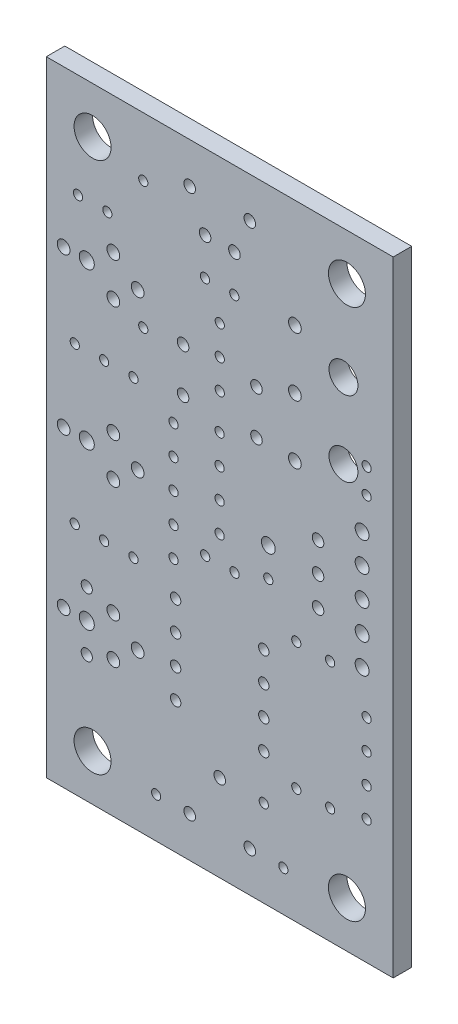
ISO-10303-21;
HEADER;
FILE_DESCRIPTION(('STEP AP214'),'2;1');
FILE_NAME('part.step','',(''),(''),'','','');
FILE_SCHEMA(('AUTOMOTIVE_DESIGN { 1 0 10303 214 1 1 1 1 }'));
ENDSEC;
DATA;
#1=APPLICATION_CONTEXT('core data for automotive mechanical design processes');
#2=APPLICATION_PROTOCOL_DEFINITION('international standard','automotive_design',2000,#1);
#3=PRODUCT_CONTEXT('',#1,'mechanical');
#4=PRODUCT('Part','Part','',(#3));
#5=PRODUCT_RELATED_PRODUCT_CATEGORY('part','',(#4));
#6=PRODUCT_DEFINITION_FORMATION('','',#4);
#7=PRODUCT_DEFINITION_CONTEXT('part definition',#1,'design');
#8=PRODUCT_DEFINITION('design','',#6,#7);
#9=PRODUCT_DEFINITION_SHAPE('','',#8);
#10=(LENGTH_UNIT() NAMED_UNIT(*) SI_UNIT(.MILLI.,.METRE.));
#11=(NAMED_UNIT(*) PLANE_ANGLE_UNIT() SI_UNIT($,.RADIAN.));
#12=(NAMED_UNIT(*) SI_UNIT($,.STERADIAN.) SOLID_ANGLE_UNIT());
#13=UNCERTAINTY_MEASURE_WITH_UNIT(LENGTH_MEASURE(1.E-05),#10,'distance_accuracy_value','');
#14=(GEOMETRIC_REPRESENTATION_CONTEXT(3) GLOBAL_UNCERTAINTY_ASSIGNED_CONTEXT((#13)) GLOBAL_UNIT_ASSIGNED_CONTEXT((#10,
#11,#12)) REPRESENTATION_CONTEXT('',''));
#15=CARTESIAN_POINT('',(0.,0.,0.));
#16=DIRECTION('',(0.,0.,1.));
#17=DIRECTION('',(1.,0.,0.));
#18=AXIS2_PLACEMENT_3D('',#15,#16,#17);
#19=CARTESIAN_POINT('',(0.,0.,1.6));
#20=DIRECTION('',(0.,0.,-1.));
#21=DIRECTION('',(-1.,0.,0.));
#22=AXIS2_PLACEMENT_3D('',#19,#20,#21);
#23=PLANE('',#22);
#24=CARTESIAN_POINT('',(14.99997,7.50012,1.6));
#25=DIRECTION('',(0.,0.,1.));
#26=DIRECTION('',(1.,0.,0.));
#27=AXIS2_PLACEMENT_3D('',#24,#25,#26);
#28=CIRCLE('',#27,0.500000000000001);
#29=CARTESIAN_POINT('',(15.49997,7.50012,1.6));
#30=VERTEX_POINT('',#29);
#31=EDGE_CURVE('E310',#30,#30,#28,.T.);
#32=ORIENTED_EDGE('',*,*,#31,.F.);
#33=EDGE_LOOP('',(#32));
#34=FACE_BOUND('',#33,.T.);
#35=CARTESIAN_POINT('',(15.00124,38.99916,1.6));
#36=DIRECTION('',(0.,0.,1.));
#37=DIRECTION('',(1.,0.,0.));
#38=AXIS2_PLACEMENT_3D('',#35,#36,#37);
#39=CIRCLE('',#38,0.39878);
#40=CARTESIAN_POINT('',(15.40002,38.99916,1.6));
#41=VERTEX_POINT('',#40);
#42=EDGE_CURVE('E324',#41,#41,#39,.T.);
#43=ORIENTED_EDGE('',*,*,#42,.F.);
#44=EDGE_LOOP('',(#43));
#45=FACE_BOUND('',#44,.T.);
#46=CARTESIAN_POINT('',(11.00328,21.91004,1.6));
#47=DIRECTION('',(0.,0.,1.));
#48=DIRECTION('',(1.,0.,0.));
#49=AXIS2_PLACEMENT_3D('',#46,#47,#48);
#50=CIRCLE('',#49,0.39878);
#51=CARTESIAN_POINT('',(11.40206,21.91004,1.6));
#52=VERTEX_POINT('',#51);
#53=EDGE_CURVE('E334',#52,#52,#50,.T.);
#54=ORIENTED_EDGE('',*,*,#53,.F.);
#55=EDGE_LOOP('',(#54));
#56=FACE_BOUND('',#55,.T.);
#57=CARTESIAN_POINT('',(11.00328,26.99004,1.6));
#58=DIRECTION('',(0.,0.,1.));
#59=DIRECTION('',(1.,0.,0.));
#60=AXIS2_PLACEMENT_3D('',#57,#58,#59);
#61=CIRCLE('',#60,0.39878);
#62=CARTESIAN_POINT('',(11.40206,26.99004,1.6));
#63=VERTEX_POINT('',#62);
#64=EDGE_CURVE('E344',#63,#63,#61,.T.);
#65=ORIENTED_EDGE('',*,*,#64,.F.);
#66=EDGE_LOOP('',(#65));
#67=FACE_BOUND('',#66,.T.);
#68=CARTESIAN_POINT('',(11.00328,32.07004,1.6));
#69=DIRECTION('',(0.,0.,1.));
#70=DIRECTION('',(1.,0.,0.));
#71=AXIS2_PLACEMENT_3D('',#68,#69,#70);
#72=CIRCLE('',#71,0.39878);
#73=CARTESIAN_POINT('',(11.40206,32.07004,1.6));
#74=VERTEX_POINT('',#73);
#75=EDGE_CURVE('E354',#74,#74,#72,.T.);
#76=ORIENTED_EDGE('',*,*,#75,.F.);
#77=EDGE_LOOP('',(#76));
#78=FACE_BOUND('',#77,.T.);
#79=CARTESIAN_POINT('',(19.19986,27.0002,1.6));
#80=DIRECTION('',(0.,0.,1.));
#81=DIRECTION('',(1.,0.,0.));
#82=AXIS2_PLACEMENT_3D('',#79,#80,#81);
#83=CIRCLE('',#82,0.59944);
#84=CARTESIAN_POINT('',(19.7993,27.0002,1.6));
#85=VERTEX_POINT('',#84);
#86=EDGE_CURVE('E364',#85,#85,#83,.T.);
#87=ORIENTED_EDGE('',*,*,#86,.F.);
#88=EDGE_LOOP('',(#87));
#89=FACE_BOUND('',#88,.T.);
#90=CARTESIAN_POINT('',(27.31008,24.4602,1.6));
#91=DIRECTION('',(0.,0.,1.));
#92=DIRECTION('',(1.,0.,0.));
#93=AXIS2_PLACEMENT_3D('',#90,#91,#92);
#94=CIRCLE('',#93,0.59944);
#95=CARTESIAN_POINT('',(27.90952,24.4602,1.6));
#96=VERTEX_POINT('',#95);
#97=EDGE_CURVE('E374',#96,#96,#94,.T.);
#98=ORIENTED_EDGE('',*,*,#97,.F.);
#99=EDGE_LOOP('',(#98));
#100=FACE_BOUND('',#99,.T.);
#101=CARTESIAN_POINT('',(27.31008,29.5402,1.6));
#102=DIRECTION('',(0.,0.,1.));
#103=DIRECTION('',(1.,0.,0.));
#104=AXIS2_PLACEMENT_3D('',#101,#102,#103);
#105=CIRCLE('',#104,0.59944);
#106=CARTESIAN_POINT('',(27.90952,29.5402,1.6));
#107=VERTEX_POINT('',#106);
#108=EDGE_CURVE('E384',#107,#107,#105,.T.);
#109=ORIENTED_EDGE('',*,*,#108,.F.);
#110=EDGE_LOOP('',(#109));
#111=FACE_BOUND('',#110,.T.);
#112=CARTESIAN_POINT('',(27.70124,35.0012,1.6));
#113=DIRECTION('',(0.,0.,1.));
#114=DIRECTION('',(1.,0.,0.));
#115=AXIS2_PLACEMENT_3D('',#112,#113,#114);
#116=CIRCLE('',#115,0.398780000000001);
#117=CARTESIAN_POINT('',(28.10002,35.0012,1.6));
#118=VERTEX_POINT('',#117);
#119=EDGE_CURVE('E394',#118,#118,#116,.T.);
#120=ORIENTED_EDGE('',*,*,#119,.F.);
#121=EDGE_LOOP('',(#120));
#122=FACE_BOUND('',#121,.T.);
#123=CARTESIAN_POINT('',(27.70124,37.1602,1.6));
#124=DIRECTION('',(0.,0.,1.));
#125=DIRECTION('',(1.,0.,0.));
#126=AXIS2_PLACEMENT_3D('',#123,#124,#125);
#127=CIRCLE('',#126,0.398780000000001);
#128=CARTESIAN_POINT('',(28.10002,37.1602,1.6));
#129=VERTEX_POINT('',#128);
#130=EDGE_CURVE('E404',#129,#129,#127,.T.);
#131=ORIENTED_EDGE('',*,*,#130,.F.);
#132=EDGE_LOOP('',(#131));
#133=FACE_BOUND('',#132,.T.);
#134=CARTESIAN_POINT('',(24.54402,21.00072,1.6));
#135=DIRECTION('',(0.,0.,1.));
#136=DIRECTION('',(1.,0.,0.));
#137=AXIS2_PLACEMENT_3D('',#134,#135,#136);
#138=CIRCLE('',#137,0.398780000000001);
#139=CARTESIAN_POINT('',(24.9428,21.00072,1.6));
#140=VERTEX_POINT('',#139);
#141=EDGE_CURVE('E414',#140,#140,#138,.T.);
#142=ORIENTED_EDGE('',*,*,#141,.F.);
#143=EDGE_LOOP('',(#142));
#144=FACE_BOUND('',#143,.T.);
#145=CARTESIAN_POINT('',(21.62048,21.00072,1.6));
#146=DIRECTION('',(0.,0.,1.));
#147=DIRECTION('',(1.,0.,0.));
#148=AXIS2_PLACEMENT_3D('',#145,#146,#147);
#149=CIRCLE('',#148,0.398780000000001);
#150=CARTESIAN_POINT('',(22.01926,21.00072,1.6));
#151=VERTEX_POINT('',#150);
#152=EDGE_CURVE('E424',#151,#151,#149,.T.);
#153=ORIENTED_EDGE('',*,*,#152,.F.);
#154=EDGE_LOOP('',(#153));
#155=FACE_BOUND('',#154,.T.);
#156=CARTESIAN_POINT('',(8.38454,37.90188,1.6));
#157=DIRECTION('',(0.,0.,1.));
#158=DIRECTION('',(1.,0.,0.));
#159=AXIS2_PLACEMENT_3D('',#156,#157,#158);
#160=CIRCLE('',#159,0.39878);
#161=CARTESIAN_POINT('',(8.78332,37.90188,1.6));
#162=VERTEX_POINT('',#161);
#163=EDGE_CURVE('E434',#162,#162,#160,.T.);
#164=ORIENTED_EDGE('',*,*,#163,.F.);
#165=EDGE_LOOP('',(#164));
#166=FACE_BOUND('',#165,.T.);
#167=CARTESIAN_POINT('',(9.4996,3.50012,1.6));
#168=DIRECTION('',(0.,0.,1.));
#169=DIRECTION('',(1.,0.,0.));
#170=AXIS2_PLACEMENT_3D('',#167,#168,#169);
#171=CIRCLE('',#170,0.39878);
#172=CARTESIAN_POINT('',(9.89838,3.50012,1.6));
#173=VERTEX_POINT('',#172);
#174=EDGE_CURVE('E444',#173,#173,#171,.T.);
#175=ORIENTED_EDGE('',*,*,#174,.F.);
#176=EDGE_LOOP('',(#175));
#177=FACE_BOUND('',#176,.T.);
#178=CARTESIAN_POINT('',(23.50008,24.4602,1.6));
#179=DIRECTION('',(0.,0.,1.));
#180=DIRECTION('',(1.,0.,0.));
#181=AXIS2_PLACEMENT_3D('',#178,#179,#180);
#182=CIRCLE('',#181,0.500380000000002);
#183=CARTESIAN_POINT('',(24.00046,24.4602,1.6));
#184=VERTEX_POINT('',#183);
#185=EDGE_CURVE('E454',#184,#184,#182,.T.);
#186=ORIENTED_EDGE('',*,*,#185,.F.);
#187=EDGE_LOOP('',(#186));
#188=FACE_BOUND('',#187,.T.);
#189=CARTESIAN_POINT('',(23.50008,29.5402,1.6));
#190=DIRECTION('',(0.,0.,1.));
#191=DIRECTION('',(1.,0.,0.));
#192=AXIS2_PLACEMENT_3D('',#189,#190,#191);
#193=CIRCLE('',#192,0.500380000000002);
#194=CARTESIAN_POINT('',(24.00046,29.5402,1.6));
#195=VERTEX_POINT('',#194);
#196=EDGE_CURVE('E464',#195,#195,#193,.T.);
#197=ORIENTED_EDGE('',*,*,#196,.F.);
#198=EDGE_LOOP('',(#197));
#199=FACE_BOUND('',#198,.T.);
#200=CARTESIAN_POINT('',(25.69718,42.84218,1.6));
#201=DIRECTION('',(0.,0.,1.));
#202=DIRECTION('',(1.,0.,0.));
#203=AXIS2_PLACEMENT_3D('',#200,#201,#202);
#204=CIRCLE('',#203,1.24968);
#205=CARTESIAN_POINT('',(26.94686,42.84218,1.6));
#206=VERTEX_POINT('',#205);
#207=EDGE_CURVE('E474',#206,#206,#204,.T.);
#208=ORIENTED_EDGE('',*,*,#207,.F.);
#209=EDGE_LOOP('',(#208));
#210=FACE_BOUND('',#209,.T.);
#211=CARTESIAN_POINT('',(21.49856,39.55288,1.6));
#212=DIRECTION('',(0.,0.,1.));
#213=DIRECTION('',(1.,0.,0.));
#214=AXIS2_PLACEMENT_3D('',#211,#212,#213);
#215=CIRCLE('',#214,0.551179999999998);
#216=CARTESIAN_POINT('',(22.04974,39.55288,1.6));
#217=VERTEX_POINT('',#216);
#218=EDGE_CURVE('E484',#217,#217,#215,.T.);
#219=ORIENTED_EDGE('',*,*,#218,.F.);
#220=EDGE_LOOP('',(#219));
#221=FACE_BOUND('',#220,.T.);
#222=CARTESIAN_POINT('',(16.25854,44.28744,1.6));
#223=DIRECTION('',(0.,0.,1.));
#224=DIRECTION('',(1.,0.,0.));
#225=AXIS2_PLACEMENT_3D('',#222,#223,#224);
#226=CIRCLE('',#225,0.398780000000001);
#227=CARTESIAN_POINT('',(16.65732,44.28744,1.6));
#228=VERTEX_POINT('',#227);
#229=EDGE_CURVE('E494',#228,#228,#226,.T.);
#230=ORIENTED_EDGE('',*,*,#229,.F.);
#231=EDGE_LOOP('',(#230));
#232=FACE_BOUND('',#231,.T.);
#233=CARTESIAN_POINT('',(13.7414,23.51024,1.6));
#234=DIRECTION('',(0.,0.,1.));
#235=DIRECTION('',(1.,0.,0.));
#236=AXIS2_PLACEMENT_3D('',#233,#234,#235);
#237=CIRCLE('',#236,0.39878);
#238=CARTESIAN_POINT('',(14.14018,23.51024,1.6));
#239=VERTEX_POINT('',#238);
#240=EDGE_CURVE('E504',#239,#239,#237,.T.);
#241=ORIENTED_EDGE('',*,*,#240,.F.);
#242=EDGE_LOOP('',(#241));
#243=FACE_BOUND('',#242,.T.);
#244=CARTESIAN_POINT('',(14.98854,25.74036,1.6));
#245=DIRECTION('',(0.,0.,1.));
#246=DIRECTION('',(1.,0.,0.));
#247=AXIS2_PLACEMENT_3D('',#244,#245,#246);
#248=CIRCLE('',#247,0.39878);
#249=CARTESIAN_POINT('',(15.38732,25.74036,1.6));
#250=VERTEX_POINT('',#249);
#251=EDGE_CURVE('E514',#250,#250,#248,.T.);
#252=ORIENTED_EDGE('',*,*,#251,.F.);
#253=EDGE_LOOP('',(#252));
#254=FACE_BOUND('',#253,.T.);
#255=CARTESIAN_POINT('',(2.74066,45.01134,1.6));
#256=DIRECTION('',(0.,0.,1.));
#257=DIRECTION('',(1.,0.,0.));
#258=AXIS2_PLACEMENT_3D('',#255,#256,#257);
#259=CIRCLE('',#258,0.39878);
#260=CARTESIAN_POINT('',(3.13944,45.01134,1.6));
#261=VERTEX_POINT('',#260);
#262=EDGE_CURVE('E524',#261,#261,#259,.T.);
#263=ORIENTED_EDGE('',*,*,#262,.F.);
#264=EDGE_LOOP('',(#263));
#265=FACE_BOUND('',#264,.T.);
#266=CARTESIAN_POINT('',(7.54126,20.24888,1.6));
#267=DIRECTION('',(0.,0.,1.));
#268=DIRECTION('',(1.,0.,0.));
#269=AXIS2_PLACEMENT_3D('',#266,#267,#268);
#270=CIRCLE('',#269,0.39878);
#271=CARTESIAN_POINT('',(7.94004,20.24888,1.6));
#272=VERTEX_POINT('',#271);
#273=EDGE_CURVE('E534',#272,#272,#270,.T.);
#274=ORIENTED_EDGE('',*,*,#273,.F.);
#275=EDGE_LOOP('',(#274));
#276=FACE_BOUND('',#275,.T.);
#277=CARTESIAN_POINT('',(2.46126,20.24888,1.6));
#278=DIRECTION('',(0.,0.,1.));
#279=DIRECTION('',(1.,0.,0.));
#280=AXIS2_PLACEMENT_3D('',#277,#278,#279);
#281=CIRCLE('',#280,0.39878);
#282=CARTESIAN_POINT('',(2.86004,20.24888,1.6));
#283=VERTEX_POINT('',#282);
#284=EDGE_CURVE('E544',#283,#283,#281,.T.);
#285=ORIENTED_EDGE('',*,*,#284,.F.);
#286=EDGE_LOOP('',(#285));
#287=FACE_BOUND('',#286,.T.);
#288=CARTESIAN_POINT('',(5.00126,33.74898,1.6));
#289=DIRECTION('',(0.,0.,1.));
#290=DIRECTION('',(1.,0.,0.));
#291=AXIS2_PLACEMENT_3D('',#288,#289,#290);
#292=CIRCLE('',#291,0.39878);
#293=CARTESIAN_POINT('',(5.40004,33.74898,1.6));
#294=VERTEX_POINT('',#293);
#295=EDGE_CURVE('E554',#294,#294,#292,.T.);
#296=ORIENTED_EDGE('',*,*,#295,.F.);
#297=EDGE_LOOP('',(#296));
#298=FACE_BOUND('',#297,.T.);
#299=CARTESIAN_POINT('',(11.18616,11.38428,1.6));
#300=DIRECTION('',(0.,0.,1.));
#301=DIRECTION('',(1.,0.,0.));
#302=AXIS2_PLACEMENT_3D('',#299,#300,#301);
#303=CIRCLE('',#302,0.44958);
#304=CARTESIAN_POINT('',(11.63574,11.38428,1.6));
#305=VERTEX_POINT('',#304);
#306=EDGE_CURVE('E564',#305,#305,#303,.T.);
#307=ORIENTED_EDGE('',*,*,#306,.F.);
#308=EDGE_LOOP('',(#307));
#309=FACE_BOUND('',#308,.T.);
#310=CARTESIAN_POINT('',(11.18616,16.46428,1.6));
#311=DIRECTION('',(0.,0.,1.));
#312=DIRECTION('',(1.,0.,0.));
#313=AXIS2_PLACEMENT_3D('',#310,#311,#312);
#314=CIRCLE('',#313,0.44958);
#315=CARTESIAN_POINT('',(11.63574,16.46428,1.6));
#316=VERTEX_POINT('',#315);
#317=EDGE_CURVE('E574',#316,#316,#314,.T.);
#318=ORIENTED_EDGE('',*,*,#317,.F.);
#319=EDGE_LOOP('',(#318));
#320=FACE_BOUND('',#319,.T.);
#321=CARTESIAN_POINT('',(18.80616,19.00428,1.6));
#322=DIRECTION('',(0.,0.,1.));
#323=DIRECTION('',(1.,0.,0.));
#324=AXIS2_PLACEMENT_3D('',#321,#322,#323);
#325=CIRCLE('',#324,0.449580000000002);
#326=CARTESIAN_POINT('',(19.25574,19.00428,1.6));
#327=VERTEX_POINT('',#326);
#328=EDGE_CURVE('E584',#327,#327,#325,.T.);
#329=ORIENTED_EDGE('',*,*,#328,.F.);
#330=EDGE_LOOP('',(#329));
#331=FACE_BOUND('',#330,.T.);
#332=CARTESIAN_POINT('',(18.80616,13.92428,1.6));
#333=DIRECTION('',(0.,0.,1.));
#334=DIRECTION('',(1.,0.,0.));
#335=AXIS2_PLACEMENT_3D('',#332,#333,#334);
#336=CIRCLE('',#335,0.449580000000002);
#337=CARTESIAN_POINT('',(19.25574,13.92428,1.6));
#338=VERTEX_POINT('',#337);
#339=EDGE_CURVE('E594',#338,#338,#336,.T.);
#340=ORIENTED_EDGE('',*,*,#339,.F.);
#341=EDGE_LOOP('',(#340));
#342=FACE_BOUND('',#341,.T.);
#343=CARTESIAN_POINT('',(25.99944,4.0005,1.6));
#344=DIRECTION('',(0.,0.,1.));
#345=DIRECTION('',(1.,0.,0.));
#346=AXIS2_PLACEMENT_3D('',#343,#344,#345);
#347=CIRCLE('',#346,1.6002);
#348=CARTESIAN_POINT('',(27.59964,4.0005,1.6));
#349=VERTEX_POINT('',#348);
#350=EDGE_CURVE('E604',#349,#349,#347,.T.);
#351=ORIENTED_EDGE('',*,*,#350,.F.);
#352=EDGE_LOOP('',(#351));
#353=FACE_BOUND('',#352,.T.);
#354=CARTESIAN_POINT('',(25.99944,49.9999,1.6));
#355=DIRECTION('',(0.,0.,1.));
#356=DIRECTION('',(1.,0.,0.));
#357=AXIS2_PLACEMENT_3D('',#354,#355,#356);
#358=CIRCLE('',#357,1.6002);
#359=CARTESIAN_POINT('',(27.59964,49.9999,1.6));
#360=VERTEX_POINT('',#359);
#361=EDGE_CURVE('E614',#360,#360,#358,.T.);
#362=ORIENTED_EDGE('',*,*,#361,.F.);
#363=EDGE_LOOP('',(#362));
#364=FACE_BOUND('',#363,.T.);
#365=CARTESIAN_POINT('',(15.00124,41.53916,1.6));
#366=DIRECTION('',(0.,0.,1.));
#367=DIRECTION('',(1.,0.,0.));
#368=AXIS2_PLACEMENT_3D('',#365,#366,#367);
#369=CIRCLE('',#368,0.39878);
#370=CARTESIAN_POINT('',(15.40002,41.53916,1.6));
#371=VERTEX_POINT('',#370);
#372=EDGE_CURVE('E624',#371,#371,#369,.T.);
#373=ORIENTED_EDGE('',*,*,#372,.F.);
#374=EDGE_LOOP('',(#373));
#375=FACE_BOUND('',#374,.T.);
#376=CARTESIAN_POINT('',(3.50012,40.5003,1.6));
#377=DIRECTION('',(0.,0.,1.));
#378=DIRECTION('',(1.,0.,0.));
#379=AXIS2_PLACEMENT_3D('',#376,#377,#378);
#380=CIRCLE('',#379,0.65024);
#381=CARTESIAN_POINT('',(4.15036,40.5003,1.6));
#382=VERTEX_POINT('',#381);
#383=EDGE_CURVE('E634',#382,#382,#380,.T.);
#384=ORIENTED_EDGE('',*,*,#383,.F.);
#385=EDGE_LOOP('',(#384));
#386=FACE_BOUND('',#385,.T.);
#387=CARTESIAN_POINT('',(5.79882,38.75024,1.6));
#388=DIRECTION('',(0.,0.,1.));
#389=DIRECTION('',(1.,0.,0.));
#390=AXIS2_PLACEMENT_3D('',#387,#388,#389);
#391=CIRCLE('',#390,0.55118);
#392=CARTESIAN_POINT('',(6.35,38.75024,1.6));
#393=VERTEX_POINT('',#392);
#394=EDGE_CURVE('E644',#393,#393,#391,.T.);
#395=ORIENTED_EDGE('',*,*,#394,.F.);
#396=EDGE_LOOP('',(#395));
#397=FACE_BOUND('',#396,.T.);
#398=CARTESIAN_POINT('',(1.4986,40.5003,1.6));
#399=DIRECTION('',(0.,0.,1.));
#400=DIRECTION('',(1.,0.,0.));
#401=AXIS2_PLACEMENT_3D('',#398,#399,#400);
#402=CIRCLE('',#401,0.55118);
#403=CARTESIAN_POINT('',(2.04978,40.5003,1.6));
#404=VERTEX_POINT('',#403);
#405=EDGE_CURVE('E654',#404,#404,#402,.T.);
#406=ORIENTED_EDGE('',*,*,#405,.F.);
#407=EDGE_LOOP('',(#406));
#408=FACE_BOUND('',#407,.T.);
#409=CARTESIAN_POINT('',(5.79882,28.75026,1.6));
#410=DIRECTION('',(0.,0.,1.));
#411=DIRECTION('',(1.,0.,0.));
#412=AXIS2_PLACEMENT_3D('',#409,#410,#411);
#413=CIRCLE('',#412,0.55118);
#414=CARTESIAN_POINT('',(6.35,28.75026,1.6));
#415=VERTEX_POINT('',#414);
#416=EDGE_CURVE('E664',#415,#415,#413,.T.);
#417=ORIENTED_EDGE('',*,*,#416,.F.);
#418=EDGE_LOOP('',(#417));
#419=FACE_BOUND('',#418,.T.);
#420=CARTESIAN_POINT('',(7.8994,27.0002,1.6));
#421=DIRECTION('',(0.,0.,1.));
#422=DIRECTION('',(1.,0.,0.));
#423=AXIS2_PLACEMENT_3D('',#420,#421,#422);
#424=CIRCLE('',#423,0.55118);
#425=CARTESIAN_POINT('',(8.45058,27.0002,1.6));
#426=VERTEX_POINT('',#425);
#427=EDGE_CURVE('E674',#426,#426,#424,.T.);
#428=ORIENTED_EDGE('',*,*,#427,.F.);
#429=EDGE_LOOP('',(#428));
#430=FACE_BOUND('',#429,.T.);
#431=CARTESIAN_POINT('',(3.50012,13.5001,1.6));
#432=DIRECTION('',(0.,0.,1.));
#433=DIRECTION('',(1.,0.,0.));
#434=AXIS2_PLACEMENT_3D('',#431,#432,#433);
#435=CIRCLE('',#434,0.65024);
#436=CARTESIAN_POINT('',(4.15036,13.5001,1.6));
#437=VERTEX_POINT('',#436);
#438=EDGE_CURVE('E684',#437,#437,#435,.T.);
#439=ORIENTED_EDGE('',*,*,#438,.F.);
#440=EDGE_LOOP('',(#439));
#441=FACE_BOUND('',#440,.T.);
#442=CARTESIAN_POINT('',(5.79882,11.75004,1.6));
#443=DIRECTION('',(0.,0.,1.));
#444=DIRECTION('',(1.,0.,0.));
#445=AXIS2_PLACEMENT_3D('',#442,#443,#444);
#446=CIRCLE('',#445,0.55118);
#447=CARTESIAN_POINT('',(6.35,11.75004,1.6));
#448=VERTEX_POINT('',#447);
#449=EDGE_CURVE('E694',#448,#448,#446,.T.);
#450=ORIENTED_EDGE('',*,*,#449,.F.);
#451=EDGE_LOOP('',(#450));
#452=FACE_BOUND('',#451,.T.);
#453=CARTESIAN_POINT('',(1.4986,13.5001,1.6));
#454=DIRECTION('',(0.,0.,1.));
#455=DIRECTION('',(1.,0.,0.));
#456=AXIS2_PLACEMENT_3D('',#453,#454,#455);
#457=CIRCLE('',#456,0.55118);
#458=CARTESIAN_POINT('',(2.04978,13.5001,1.6));
#459=VERTEX_POINT('',#458);
#460=EDGE_CURVE('E704',#459,#459,#457,.T.);
#461=ORIENTED_EDGE('',*,*,#460,.F.);
#462=EDGE_LOOP('',(#461));
#463=FACE_BOUND('',#462,.T.);
#464=CARTESIAN_POINT('',(13.73124,47.50054,1.6));
#465=DIRECTION('',(0.,0.,1.));
#466=DIRECTION('',(1.,0.,0.));
#467=AXIS2_PLACEMENT_3D('',#464,#465,#466);
#468=CIRCLE('',#467,0.50038);
#469=CARTESIAN_POINT('',(14.23162,47.50054,1.6));
#470=VERTEX_POINT('',#469);
#471=EDGE_CURVE('E714',#470,#470,#468,.T.);
#472=ORIENTED_EDGE('',*,*,#471,.F.);
#473=EDGE_LOOP('',(#472));
#474=FACE_BOUND('',#473,.T.);
#475=CARTESIAN_POINT('',(14.98854,30.82036,1.6));
#476=DIRECTION('',(0.,0.,1.));
#477=DIRECTION('',(1.,0.,0.));
#478=AXIS2_PLACEMENT_3D('',#475,#476,#477);
#479=CIRCLE('',#478,0.39878);
#480=CARTESIAN_POINT('',(15.38732,30.82036,1.6));
#481=VERTEX_POINT('',#480);
#482=EDGE_CURVE('E724',#481,#481,#479,.T.);
#483=ORIENTED_EDGE('',*,*,#482,.F.);
#484=EDGE_LOOP('',(#483));
#485=FACE_BOUND('',#484,.T.);
#486=CARTESIAN_POINT('',(3.50012,10.9601,1.6));
#487=DIRECTION('',(0.,0.,1.));
#488=DIRECTION('',(1.,0.,0.));
#489=AXIS2_PLACEMENT_3D('',#486,#487,#488);
#490=CIRCLE('',#489,0.4826);
#491=CARTESIAN_POINT('',(3.98272,10.9601,1.6));
#492=VERTEX_POINT('',#491);
#493=EDGE_CURVE('E734',#492,#492,#490,.T.);
#494=ORIENTED_EDGE('',*,*,#493,.F.);
#495=EDGE_LOOP('',(#494));
#496=FACE_BOUND('',#495,.T.);
#497=CARTESIAN_POINT('',(12.40028,50.50028,1.6));
#498=DIRECTION('',(0.,0.,1.));
#499=DIRECTION('',(1.,0.,0.));
#500=AXIS2_PLACEMENT_3D('',#497,#498,#499);
#501=CIRCLE('',#500,0.50038);
#502=CARTESIAN_POINT('',(12.90066,50.50028,1.6));
#503=VERTEX_POINT('',#502);
#504=EDGE_CURVE('E744',#503,#503,#501,.T.);
#505=ORIENTED_EDGE('',*,*,#504,.F.);
#506=EDGE_LOOP('',(#505));
#507=FACE_BOUND('',#506,.T.);
#508=CARTESIAN_POINT('',(17.59966,3.50012,1.6));
#509=DIRECTION('',(0.,0.,1.));
#510=DIRECTION('',(1.,0.,0.));
#511=AXIS2_PLACEMENT_3D('',#508,#509,#510);
#512=CIRCLE('',#511,0.500379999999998);
#513=CARTESIAN_POINT('',(18.10004,3.50012,1.6));
#514=VERTEX_POINT('',#513);
#515=EDGE_CURVE('E754',#514,#514,#512,.T.);
#516=ORIENTED_EDGE('',*,*,#515,.F.);
#517=EDGE_LOOP('',(#516));
#518=FACE_BOUND('',#517,.T.);
#519=CARTESIAN_POINT('',(11.82624,34.55416,1.6));
#520=DIRECTION('',(0.,0.,1.));
#521=DIRECTION('',(1.,0.,0.));
#522=AXIS2_PLACEMENT_3D('',#519,#520,#521);
#523=CIRCLE('',#522,0.50038);
#524=CARTESIAN_POINT('',(12.32662,34.55416,1.6));
#525=VERTEX_POINT('',#524);
#526=EDGE_CURVE('E764',#525,#525,#523,.T.);
#527=ORIENTED_EDGE('',*,*,#526,.F.);
#528=EDGE_LOOP('',(#527));
#529=FACE_BOUND('',#528,.T.);
#530=CARTESIAN_POINT('',(18.17624,38.36416,1.6));
#531=DIRECTION('',(0.,0.,1.));
#532=DIRECTION('',(1.,0.,0.));
#533=AXIS2_PLACEMENT_3D('',#530,#531,#532);
#534=CIRCLE('',#533,0.500379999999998);
#535=CARTESIAN_POINT('',(18.67662,38.36416,1.6));
#536=VERTEX_POINT('',#535);
#537=EDGE_CURVE('E92',#536,#536,#534,.T.);
#538=ORIENTED_EDGE('',*,*,#537,.F.);
#539=EDGE_LOOP('',(#538));
#540=FACE_BOUND('',#539,.T.);
#541=DIRECTION('',(1.,0.,0.));
#542=VECTOR('',#541,1.);
#543=CARTESIAN_POINT('',(29.99994,0.,1.6));
#544=LINE('',#543,#542);
#545=CARTESIAN_POINT('',(0.,0.,1.6));
#546=VERTEX_POINT('',#545);
#547=CARTESIAN_POINT('',(29.99994,0.,1.6));
#548=VERTEX_POINT('',#547);
#549=EDGE_CURVE('E102',#546,#548,#544,.T.);
#550=ORIENTED_EDGE('',*,*,#549,.T.);
#551=DIRECTION('',(0.,1.,0.));
#552=VECTOR('',#551,1.);
#553=CARTESIAN_POINT('',(29.99994,54.0004,1.6));
#554=LINE('',#553,#552);
#555=CARTESIAN_POINT('',(29.99994,54.0004,1.6));
#556=VERTEX_POINT('',#555);
#557=EDGE_CURVE('E87',#548,#556,#554,.T.);
#558=ORIENTED_EDGE('',*,*,#557,.T.);
#559=DIRECTION('',(-1.,0.,0.));
#560=VECTOR('',#559,1.);
#561=CARTESIAN_POINT('',(0.,54.0004,1.6));
#562=LINE('',#561,#560);
#563=CARTESIAN_POINT('',(0.,54.0004,1.6));
#564=VERTEX_POINT('',#563);
#565=EDGE_CURVE('E53',#556,#564,#562,.T.);
#566=ORIENTED_EDGE('',*,*,#565,.T.);
#567=DIRECTION('',(0.,-1.,0.));
#568=VECTOR('',#567,1.);
#569=CARTESIAN_POINT('',(0.,0.,1.6));
#570=LINE('',#569,#568);
#571=EDGE_CURVE('E48',#564,#546,#570,.T.);
#572=ORIENTED_EDGE('',*,*,#571,.T.);
#573=EDGE_LOOP('',(#550,#558,#566,#572));
#574=FACE_BOUND('',#573,.T.);
#575=CARTESIAN_POINT('',(18.17624,34.55416,1.6));
#576=DIRECTION('',(0.,0.,1.));
#577=DIRECTION('',(1.,0.,0.));
#578=AXIS2_PLACEMENT_3D('',#575,#576,#577);
#579=CIRCLE('',#578,0.500379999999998);
#580=CARTESIAN_POINT('',(18.67662,34.55416,1.6));
#581=VERTEX_POINT('',#580);
#582=EDGE_CURVE('E121',#581,#581,#579,.T.);
#583=ORIENTED_EDGE('',*,*,#582,.F.);
#584=EDGE_LOOP('',(#583));
#585=FACE_BOUND('',#584,.T.);
#586=CARTESIAN_POINT('',(11.82624,38.36416,1.6));
#587=DIRECTION('',(0.,0.,1.));
#588=DIRECTION('',(1.,0.,0.));
#589=AXIS2_PLACEMENT_3D('',#586,#587,#588);
#590=CIRCLE('',#589,0.50038);
#591=CARTESIAN_POINT('',(12.32662,38.36416,1.6));
#592=VERTEX_POINT('',#591);
#593=EDGE_CURVE('E125',#592,#592,#590,.T.);
#594=ORIENTED_EDGE('',*,*,#593,.F.);
#595=EDGE_LOOP('',(#594));
#596=FACE_BOUND('',#595,.T.);
#597=CARTESIAN_POINT('',(12.40028,3.50012,1.6));
#598=DIRECTION('',(0.,0.,1.));
#599=DIRECTION('',(1.,0.,0.));
#600=AXIS2_PLACEMENT_3D('',#597,#598,#599);
#601=CIRCLE('',#600,0.50038);
#602=CARTESIAN_POINT('',(12.90066,3.50012,1.6));
#603=VERTEX_POINT('',#602);
#604=EDGE_CURVE('E129',#603,#603,#601,.T.);
#605=ORIENTED_EDGE('',*,*,#604,.F.);
#606=EDGE_LOOP('',(#605));
#607=FACE_BOUND('',#606,.T.);
#608=CARTESIAN_POINT('',(17.59966,50.50028,1.6));
#609=DIRECTION('',(0.,0.,1.));
#610=DIRECTION('',(1.,0.,0.));
#611=AXIS2_PLACEMENT_3D('',#608,#609,#610);
#612=CIRCLE('',#611,0.500379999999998);
#613=CARTESIAN_POINT('',(18.10004,50.50028,1.6));
#614=VERTEX_POINT('',#613);
#615=EDGE_CURVE('E133',#614,#614,#612,.T.);
#616=ORIENTED_EDGE('',*,*,#615,.F.);
#617=EDGE_LOOP('',(#616));
#618=FACE_BOUND('',#617,.T.);
#619=CARTESIAN_POINT('',(3.50012,16.0401,1.6));
#620=DIRECTION('',(0.,0.,1.));
#621=DIRECTION('',(1.,0.,0.));
#622=AXIS2_PLACEMENT_3D('',#619,#620,#621);
#623=CIRCLE('',#622,0.4826);
#624=CARTESIAN_POINT('',(3.98272,16.0401,1.6));
#625=VERTEX_POINT('',#624);
#626=EDGE_CURVE('E137',#625,#625,#623,.T.);
#627=ORIENTED_EDGE('',*,*,#626,.F.);
#628=EDGE_LOOP('',(#627));
#629=FACE_BOUND('',#628,.T.);
#630=CARTESIAN_POINT('',(16.27124,47.50054,1.6));
#631=DIRECTION('',(0.,0.,1.));
#632=DIRECTION('',(1.,0.,0.));
#633=AXIS2_PLACEMENT_3D('',#630,#631,#632);
#634=CIRCLE('',#633,0.500380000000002);
#635=CARTESIAN_POINT('',(16.77162,47.50054,1.6));
#636=VERTEX_POINT('',#635);
#637=EDGE_CURVE('E141',#636,#636,#634,.T.);
#638=ORIENTED_EDGE('',*,*,#637,.F.);
#639=EDGE_LOOP('',(#638));
#640=FACE_BOUND('',#639,.T.);
#641=CARTESIAN_POINT('',(27.70124,10.74928,1.6));
#642=DIRECTION('',(0.,0.,1.));
#643=DIRECTION('',(1.,0.,0.));
#644=AXIS2_PLACEMENT_3D('',#641,#642,#643);
#645=CIRCLE('',#644,0.398780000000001);
#646=CARTESIAN_POINT('',(28.10002,10.74928,1.6));
#647=VERTEX_POINT('',#646);
#648=EDGE_CURVE('E145',#647,#647,#645,.T.);
#649=ORIENTED_EDGE('',*,*,#648,.F.);
#650=EDGE_LOOP('',(#649));
#651=FACE_BOUND('',#650,.T.);
#652=CARTESIAN_POINT('',(7.8994,13.5001,1.6));
#653=DIRECTION('',(0.,0.,1.));
#654=DIRECTION('',(1.,0.,0.));
#655=AXIS2_PLACEMENT_3D('',#652,#653,#654);
#656=CIRCLE('',#655,0.55118);
#657=CARTESIAN_POINT('',(8.45058,13.5001,1.6));
#658=VERTEX_POINT('',#657);
#659=EDGE_CURVE('E149',#658,#658,#656,.T.);
#660=ORIENTED_EDGE('',*,*,#659,.F.);
#661=EDGE_LOOP('',(#660));
#662=FACE_BOUND('',#661,.T.);
#663=CARTESIAN_POINT('',(5.79882,15.25016,1.6));
#664=DIRECTION('',(0.,0.,1.));
#665=DIRECTION('',(1.,0.,0.));
#666=AXIS2_PLACEMENT_3D('',#663,#664,#665);
#667=CIRCLE('',#666,0.55118);
#668=CARTESIAN_POINT('',(6.35,15.25016,1.6));
#669=VERTEX_POINT('',#668);
#670=EDGE_CURVE('E153',#669,#669,#667,.T.);
#671=ORIENTED_EDGE('',*,*,#670,.F.);
#672=EDGE_LOOP('',(#671));
#673=FACE_BOUND('',#672,.T.);
#674=CARTESIAN_POINT('',(1.4986,27.0002,1.6));
#675=DIRECTION('',(0.,0.,1.));
#676=DIRECTION('',(1.,0.,0.));
#677=AXIS2_PLACEMENT_3D('',#674,#675,#676);
#678=CIRCLE('',#677,0.55118);
#679=CARTESIAN_POINT('',(2.04978,27.0002,1.6));
#680=VERTEX_POINT('',#679);
#681=EDGE_CURVE('E157',#680,#680,#678,.T.);
#682=ORIENTED_EDGE('',*,*,#681,.F.);
#683=EDGE_LOOP('',(#682));
#684=FACE_BOUND('',#683,.T.);
#685=CARTESIAN_POINT('',(5.79882,25.25014,1.6));
#686=DIRECTION('',(0.,0.,1.));
#687=DIRECTION('',(1.,0.,0.));
#688=AXIS2_PLACEMENT_3D('',#685,#686,#687);
#689=CIRCLE('',#688,0.55118);
#690=CARTESIAN_POINT('',(6.35,25.25014,1.6));
#691=VERTEX_POINT('',#690);
#692=EDGE_CURVE('E161',#691,#691,#689,.T.);
#693=ORIENTED_EDGE('',*,*,#692,.F.);
#694=EDGE_LOOP('',(#693));
#695=FACE_BOUND('',#694,.T.);
#696=CARTESIAN_POINT('',(3.50012,27.0002,1.6));
#697=DIRECTION('',(0.,0.,1.));
#698=DIRECTION('',(1.,0.,0.));
#699=AXIS2_PLACEMENT_3D('',#696,#697,#698);
#700=CIRCLE('',#699,0.65024);
#701=CARTESIAN_POINT('',(4.15036,27.0002,1.6));
#702=VERTEX_POINT('',#701);
#703=EDGE_CURVE('E165',#702,#702,#700,.T.);
#704=ORIENTED_EDGE('',*,*,#703,.F.);
#705=EDGE_LOOP('',(#704));
#706=FACE_BOUND('',#705,.T.);
#707=CARTESIAN_POINT('',(7.8994,40.5003,1.6));
#708=DIRECTION('',(0.,0.,1.));
#709=DIRECTION('',(1.,0.,0.));
#710=AXIS2_PLACEMENT_3D('',#707,#708,#709);
#711=CIRCLE('',#710,0.55118);
#712=CARTESIAN_POINT('',(8.45058,40.5003,1.6));
#713=VERTEX_POINT('',#712);
#714=EDGE_CURVE('E169',#713,#713,#711,.T.);
#715=ORIENTED_EDGE('',*,*,#714,.F.);
#716=EDGE_LOOP('',(#715));
#717=FACE_BOUND('',#716,.T.);
#718=CARTESIAN_POINT('',(5.79882,42.25036,1.6));
#719=DIRECTION('',(0.,0.,1.));
#720=DIRECTION('',(1.,0.,0.));
#721=AXIS2_PLACEMENT_3D('',#718,#719,#720);
#722=CIRCLE('',#721,0.55118);
#723=CARTESIAN_POINT('',(6.35,42.25036,1.6));
#724=VERTEX_POINT('',#723);
#725=EDGE_CURVE('E173',#724,#724,#722,.T.);
#726=ORIENTED_EDGE('',*,*,#725,.F.);
#727=EDGE_LOOP('',(#726));
#728=FACE_BOUND('',#727,.T.);
#729=CARTESIAN_POINT('',(15.00124,36.45916,1.6));
#730=DIRECTION('',(0.,0.,1.));
#731=DIRECTION('',(1.,0.,0.));
#732=AXIS2_PLACEMENT_3D('',#729,#730,#731);
#733=CIRCLE('',#732,0.39878);
#734=CARTESIAN_POINT('',(15.40002,36.45916,1.6));
#735=VERTEX_POINT('',#734);
#736=EDGE_CURVE('E177',#735,#735,#733,.T.);
#737=ORIENTED_EDGE('',*,*,#736,.F.);
#738=EDGE_LOOP('',(#737));
#739=FACE_BOUND('',#738,.T.);
#740=CARTESIAN_POINT('',(4.0005,49.9999,1.6));
#741=DIRECTION('',(0.,0.,1.));
#742=DIRECTION('',(1.,0.,0.));
#743=AXIS2_PLACEMENT_3D('',#740,#741,#742);
#744=CIRCLE('',#743,1.6002);
#745=CARTESIAN_POINT('',(5.6007,49.9999,1.6));
#746=VERTEX_POINT('',#745);
#747=EDGE_CURVE('E181',#746,#746,#744,.T.);
#748=ORIENTED_EDGE('',*,*,#747,.F.);
#749=EDGE_LOOP('',(#748));
#750=FACE_BOUND('',#749,.T.);
#751=CARTESIAN_POINT('',(4.0005,4.0005,1.6));
#752=DIRECTION('',(0.,0.,1.));
#753=DIRECTION('',(1.,0.,0.));
#754=AXIS2_PLACEMENT_3D('',#751,#752,#753);
#755=CIRCLE('',#754,1.6002);
#756=CARTESIAN_POINT('',(5.6007,4.0005,1.6));
#757=VERTEX_POINT('',#756);
#758=EDGE_CURVE('E185',#757,#757,#755,.T.);
#759=ORIENTED_EDGE('',*,*,#758,.F.);
#760=EDGE_LOOP('',(#759));
#761=FACE_BOUND('',#760,.T.);
#762=CARTESIAN_POINT('',(18.80616,11.38428,1.6));
#763=DIRECTION('',(0.,0.,1.));
#764=DIRECTION('',(1.,0.,0.));
#765=AXIS2_PLACEMENT_3D('',#762,#763,#764);
#766=CIRCLE('',#765,0.449580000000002);
#767=CARTESIAN_POINT('',(19.25574,11.38428,1.6));
#768=VERTEX_POINT('',#767);
#769=EDGE_CURVE('E189',#768,#768,#766,.T.);
#770=ORIENTED_EDGE('',*,*,#769,.F.);
#771=EDGE_LOOP('',(#770));
#772=FACE_BOUND('',#771,.T.);
#773=CARTESIAN_POINT('',(18.80616,16.46428,1.6));
#774=DIRECTION('',(0.,0.,1.));
#775=DIRECTION('',(1.,0.,0.));
#776=AXIS2_PLACEMENT_3D('',#773,#774,#775);
#777=CIRCLE('',#776,0.449580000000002);
#778=CARTESIAN_POINT('',(19.25574,16.46428,1.6));
#779=VERTEX_POINT('',#778);
#780=EDGE_CURVE('E193',#779,#779,#777,.T.);
#781=ORIENTED_EDGE('',*,*,#780,.F.);
#782=EDGE_LOOP('',(#781));
#783=FACE_BOUND('',#782,.T.);
#784=CARTESIAN_POINT('',(11.18616,19.00428,1.6));
#785=DIRECTION('',(0.,0.,1.));
#786=DIRECTION('',(1.,0.,0.));
#787=AXIS2_PLACEMENT_3D('',#784,#785,#786);
#788=CIRCLE('',#787,0.44958);
#789=CARTESIAN_POINT('',(11.63574,19.00428,1.6));
#790=VERTEX_POINT('',#789);
#791=EDGE_CURVE('E197',#790,#790,#788,.T.);
#792=ORIENTED_EDGE('',*,*,#791,.F.);
#793=EDGE_LOOP('',(#792));
#794=FACE_BOUND('',#793,.T.);
#795=CARTESIAN_POINT('',(11.18616,13.92428,1.6));
#796=DIRECTION('',(0.,0.,1.));
#797=DIRECTION('',(1.,0.,0.));
#798=AXIS2_PLACEMENT_3D('',#795,#796,#797);
#799=CIRCLE('',#798,0.44958);
#800=CARTESIAN_POINT('',(11.63574,13.92428,1.6));
#801=VERTEX_POINT('',#800);
#802=EDGE_CURVE('E201',#801,#801,#799,.T.);
#803=ORIENTED_EDGE('',*,*,#802,.F.);
#804=EDGE_LOOP('',(#803));
#805=FACE_BOUND('',#804,.T.);
#806=CARTESIAN_POINT('',(2.46126,33.74898,1.6));
#807=DIRECTION('',(0.,0.,1.));
#808=DIRECTION('',(1.,0.,0.));
#809=AXIS2_PLACEMENT_3D('',#806,#807,#808);
#810=CIRCLE('',#809,0.39878);
#811=CARTESIAN_POINT('',(2.86004,33.74898,1.6));
#812=VERTEX_POINT('',#811);
#813=EDGE_CURVE('E205',#812,#812,#810,.T.);
#814=ORIENTED_EDGE('',*,*,#813,.F.);
#815=EDGE_LOOP('',(#814));
#816=FACE_BOUND('',#815,.T.);
#817=CARTESIAN_POINT('',(7.54126,33.74898,1.6));
#818=DIRECTION('',(0.,0.,1.));
#819=DIRECTION('',(1.,0.,0.));
#820=AXIS2_PLACEMENT_3D('',#817,#818,#819);
#821=CIRCLE('',#820,0.39878);
#822=CARTESIAN_POINT('',(7.94004,33.74898,1.6));
#823=VERTEX_POINT('',#822);
#824=EDGE_CURVE('E209',#823,#823,#821,.T.);
#825=ORIENTED_EDGE('',*,*,#824,.F.);
#826=EDGE_LOOP('',(#825));
#827=FACE_BOUND('',#826,.T.);
#828=CARTESIAN_POINT('',(5.00126,20.24888,1.6));
#829=DIRECTION('',(0.,0.,1.));
#830=DIRECTION('',(1.,0.,0.));
#831=AXIS2_PLACEMENT_3D('',#828,#829,#830);
#832=CIRCLE('',#831,0.39878);
#833=CARTESIAN_POINT('',(5.40004,20.24888,1.6));
#834=VERTEX_POINT('',#833);
#835=EDGE_CURVE('E213',#834,#834,#832,.T.);
#836=ORIENTED_EDGE('',*,*,#835,.F.);
#837=EDGE_LOOP('',(#836));
#838=FACE_BOUND('',#837,.T.);
#839=CARTESIAN_POINT('',(5.28066,45.01134,1.6));
#840=DIRECTION('',(0.,0.,1.));
#841=DIRECTION('',(1.,0.,0.));
#842=AXIS2_PLACEMENT_3D('',#839,#840,#841);
#843=CIRCLE('',#842,0.39878);
#844=CARTESIAN_POINT('',(5.67944,45.01134,1.6));
#845=VERTEX_POINT('',#844);
#846=EDGE_CURVE('E217',#845,#845,#843,.T.);
#847=ORIENTED_EDGE('',*,*,#846,.F.);
#848=EDGE_LOOP('',(#847));
#849=FACE_BOUND('',#848,.T.);
#850=CARTESIAN_POINT('',(14.98854,28.28036,1.6));
#851=DIRECTION('',(0.,0.,1.));
#852=DIRECTION('',(1.,0.,0.));
#853=AXIS2_PLACEMENT_3D('',#850,#851,#852);
#854=CIRCLE('',#853,0.39878);
#855=CARTESIAN_POINT('',(15.38732,28.28036,1.6));
#856=VERTEX_POINT('',#855);
#857=EDGE_CURVE('E221',#856,#856,#854,.T.);
#858=ORIENTED_EDGE('',*,*,#857,.F.);
#859=EDGE_LOOP('',(#858));
#860=FACE_BOUND('',#859,.T.);
#861=CARTESIAN_POINT('',(16.2814,23.51024,1.6));
#862=DIRECTION('',(0.,0.,1.));
#863=DIRECTION('',(1.,0.,0.));
#864=AXIS2_PLACEMENT_3D('',#861,#862,#863);
#865=CIRCLE('',#864,0.398780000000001);
#866=CARTESIAN_POINT('',(16.68018,23.51024,1.6));
#867=VERTEX_POINT('',#866);
#868=EDGE_CURVE('E225',#867,#867,#865,.T.);
#869=ORIENTED_EDGE('',*,*,#868,.F.);
#870=EDGE_LOOP('',(#869));
#871=FACE_BOUND('',#870,.T.);
#872=CARTESIAN_POINT('',(13.71854,44.28744,1.6));
#873=DIRECTION('',(0.,0.,1.));
#874=DIRECTION('',(1.,0.,0.));
#875=AXIS2_PLACEMENT_3D('',#872,#873,#874);
#876=CIRCLE('',#875,0.39878);
#877=CARTESIAN_POINT('',(14.11732,44.28744,1.6));
#878=VERTEX_POINT('',#877);
#879=EDGE_CURVE('E229',#878,#878,#876,.T.);
#880=ORIENTED_EDGE('',*,*,#879,.F.);
#881=EDGE_LOOP('',(#880));
#882=FACE_BOUND('',#881,.T.);
#883=CARTESIAN_POINT('',(21.49856,44.63542,1.6));
#884=DIRECTION('',(0.,0.,1.));
#885=DIRECTION('',(1.,0.,0.));
#886=AXIS2_PLACEMENT_3D('',#883,#884,#885);
#887=CIRCLE('',#886,0.551179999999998);
#888=CARTESIAN_POINT('',(22.04974,44.63542,1.6));
#889=VERTEX_POINT('',#888);
#890=EDGE_CURVE('E233',#889,#889,#887,.T.);
#891=ORIENTED_EDGE('',*,*,#890,.F.);
#892=EDGE_LOOP('',(#891));
#893=FACE_BOUND('',#892,.T.);
#894=CARTESIAN_POINT('',(21.49856,34.47288,1.6));
#895=DIRECTION('',(0.,0.,1.));
#896=DIRECTION('',(1.,0.,0.));
#897=AXIS2_PLACEMENT_3D('',#894,#895,#896);
#898=CIRCLE('',#897,0.551179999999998);
#899=CARTESIAN_POINT('',(22.04974,34.47288,1.6));
#900=VERTEX_POINT('',#899);
#901=EDGE_CURVE('E237',#900,#900,#898,.T.);
#902=ORIENTED_EDGE('',*,*,#901,.F.);
#903=EDGE_LOOP('',(#902));
#904=FACE_BOUND('',#903,.T.);
#905=CARTESIAN_POINT('',(25.69718,36.34232,1.6));
#906=DIRECTION('',(0.,0.,1.));
#907=DIRECTION('',(1.,0.,0.));
#908=AXIS2_PLACEMENT_3D('',#905,#906,#907);
#909=CIRCLE('',#908,1.24968);
#910=CARTESIAN_POINT('',(26.94686,36.34232,1.6));
#911=VERTEX_POINT('',#910);
#912=EDGE_CURVE('E241',#911,#911,#909,.T.);
#913=ORIENTED_EDGE('',*,*,#912,.F.);
#914=EDGE_LOOP('',(#913));
#915=FACE_BOUND('',#914,.T.);
#916=CARTESIAN_POINT('',(23.50008,27.0002,1.6));
#917=DIRECTION('',(0.,0.,1.));
#918=DIRECTION('',(1.,0.,0.));
#919=AXIS2_PLACEMENT_3D('',#916,#917,#918);
#920=CIRCLE('',#919,0.500380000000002);
#921=CARTESIAN_POINT('',(24.00046,27.0002,1.6));
#922=VERTEX_POINT('',#921);
#923=EDGE_CURVE('E245',#922,#922,#920,.T.);
#924=ORIENTED_EDGE('',*,*,#923,.F.);
#925=EDGE_LOOP('',(#924));
#926=FACE_BOUND('',#925,.T.);
#927=CARTESIAN_POINT('',(20.50034,3.50012,1.6));
#928=DIRECTION('',(0.,0.,1.));
#929=DIRECTION('',(1.,0.,0.));
#930=AXIS2_PLACEMENT_3D('',#927,#928,#929);
#931=CIRCLE('',#930,0.398780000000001);
#932=CARTESIAN_POINT('',(20.89912,3.50012,1.6));
#933=VERTEX_POINT('',#932);
#934=EDGE_CURVE('E249',#933,#933,#931,.T.);
#935=ORIENTED_EDGE('',*,*,#934,.F.);
#936=EDGE_LOOP('',(#935));
#937=FACE_BOUND('',#936,.T.);
#938=CARTESIAN_POINT('',(8.38454,48.90262,1.6));
#939=DIRECTION('',(0.,0.,1.));
#940=DIRECTION('',(1.,0.,0.));
#941=AXIS2_PLACEMENT_3D('',#938,#939,#940);
#942=CIRCLE('',#941,0.39878);
#943=CARTESIAN_POINT('',(8.78332,48.90262,1.6));
#944=VERTEX_POINT('',#943);
#945=EDGE_CURVE('E253',#944,#944,#942,.T.);
#946=ORIENTED_EDGE('',*,*,#945,.F.);
#947=EDGE_LOOP('',(#946));
#948=FACE_BOUND('',#947,.T.);
#949=CARTESIAN_POINT('',(21.62048,9.99998,1.6));
#950=DIRECTION('',(0.,0.,1.));
#951=DIRECTION('',(1.,0.,0.));
#952=AXIS2_PLACEMENT_3D('',#949,#950,#951);
#953=CIRCLE('',#952,0.398780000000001);
#954=CARTESIAN_POINT('',(22.01926,9.99998,1.6));
#955=VERTEX_POINT('',#954);
#956=EDGE_CURVE('E257',#955,#955,#953,.T.);
#957=ORIENTED_EDGE('',*,*,#956,.F.);
#958=EDGE_LOOP('',(#957));
#959=FACE_BOUND('',#958,.T.);
#960=CARTESIAN_POINT('',(24.54402,9.99998,1.6));
#961=DIRECTION('',(0.,0.,1.));
#962=DIRECTION('',(1.,0.,0.));
#963=AXIS2_PLACEMENT_3D('',#960,#961,#962);
#964=CIRCLE('',#963,0.398780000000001);
#965=CARTESIAN_POINT('',(24.9428,9.99998,1.6));
#966=VERTEX_POINT('',#965);
#967=EDGE_CURVE('E261',#966,#966,#964,.T.);
#968=ORIENTED_EDGE('',*,*,#967,.F.);
#969=EDGE_LOOP('',(#968));
#970=FACE_BOUND('',#969,.T.);
#971=CARTESIAN_POINT('',(27.70124,13.28928,1.6));
#972=DIRECTION('',(0.,0.,1.));
#973=DIRECTION('',(1.,0.,0.));
#974=AXIS2_PLACEMENT_3D('',#971,#972,#973);
#975=CIRCLE('',#974,0.398780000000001);
#976=CARTESIAN_POINT('',(28.10002,13.28928,1.6));
#977=VERTEX_POINT('',#976);
#978=EDGE_CURVE('E265',#977,#977,#975,.T.);
#979=ORIENTED_EDGE('',*,*,#978,.F.);
#980=EDGE_LOOP('',(#979));
#981=FACE_BOUND('',#980,.T.);
#982=CARTESIAN_POINT('',(27.70124,15.82928,1.6));
#983=DIRECTION('',(0.,0.,1.));
#984=DIRECTION('',(1.,0.,0.));
#985=AXIS2_PLACEMENT_3D('',#982,#983,#984);
#986=CIRCLE('',#985,0.398780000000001);
#987=CARTESIAN_POINT('',(28.10002,15.82928,1.6));
#988=VERTEX_POINT('',#987);
#989=EDGE_CURVE('E269',#988,#988,#986,.T.);
#990=ORIENTED_EDGE('',*,*,#989,.F.);
#991=EDGE_LOOP('',(#990));
#992=FACE_BOUND('',#991,.T.);
#993=CARTESIAN_POINT('',(27.31008,27.0002,1.6));
#994=DIRECTION('',(0.,0.,1.));
#995=DIRECTION('',(1.,0.,0.));
#996=AXIS2_PLACEMENT_3D('',#993,#994,#995);
#997=CIRCLE('',#996,0.59944);
#998=CARTESIAN_POINT('',(27.90952,27.0002,1.6));
#999=VERTEX_POINT('',#998);
#1000=EDGE_CURVE('E273',#999,#999,#997,.T.);
#1001=ORIENTED_EDGE('',*,*,#1000,.F.);
#1002=EDGE_LOOP('',(#1001));
#1003=FACE_BOUND('',#1002,.T.);
#1004=CARTESIAN_POINT('',(27.31008,32.0802,1.6));
#1005=DIRECTION('',(0.,0.,1.));
#1006=DIRECTION('',(1.,0.,0.));
#1007=AXIS2_PLACEMENT_3D('',#1004,#1005,#1006);
#1008=CIRCLE('',#1007,0.59944);
#1009=CARTESIAN_POINT('',(27.90952,32.0802,1.6));
#1010=VERTEX_POINT('',#1009);
#1011=EDGE_CURVE('E277',#1010,#1010,#1008,.T.);
#1012=ORIENTED_EDGE('',*,*,#1011,.F.);
#1013=EDGE_LOOP('',(#1012));
#1014=FACE_BOUND('',#1013,.T.);
#1015=CARTESIAN_POINT('',(27.31008,21.9202,1.6));
#1016=DIRECTION('',(0.,0.,1.));
#1017=DIRECTION('',(1.,0.,0.));
#1018=AXIS2_PLACEMENT_3D('',#1015,#1016,#1017);
#1019=CIRCLE('',#1018,0.59944);
#1020=CARTESIAN_POINT('',(27.90952,21.9202,1.6));
#1021=VERTEX_POINT('',#1020);
#1022=EDGE_CURVE('E281',#1021,#1021,#1019,.T.);
#1023=ORIENTED_EDGE('',*,*,#1022,.F.);
#1024=EDGE_LOOP('',(#1023));
#1025=FACE_BOUND('',#1024,.T.);
#1026=CARTESIAN_POINT('',(19.19986,24.50084,1.6));
#1027=DIRECTION('',(0.,0.,1.));
#1028=DIRECTION('',(1.,0.,0.));
#1029=AXIS2_PLACEMENT_3D('',#1026,#1027,#1028);
#1030=CIRCLE('',#1029,0.398780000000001);
#1031=CARTESIAN_POINT('',(19.59864,24.50084,1.6));
#1032=VERTEX_POINT('',#1031);
#1033=EDGE_CURVE('E285',#1032,#1032,#1030,.T.);
#1034=ORIENTED_EDGE('',*,*,#1033,.F.);
#1035=EDGE_LOOP('',(#1034));
#1036=FACE_BOUND('',#1035,.T.);
#1037=CARTESIAN_POINT('',(11.00328,29.53004,1.6));
#1038=DIRECTION('',(0.,0.,1.));
#1039=DIRECTION('',(1.,0.,0.));
#1040=AXIS2_PLACEMENT_3D('',#1037,#1038,#1039);
#1041=CIRCLE('',#1040,0.39878);
#1042=CARTESIAN_POINT('',(11.40206,29.53004,1.6));
#1043=VERTEX_POINT('',#1042);
#1044=EDGE_CURVE('E289',#1043,#1043,#1041,.T.);
#1045=ORIENTED_EDGE('',*,*,#1044,.F.);
#1046=EDGE_LOOP('',(#1045));
#1047=FACE_BOUND('',#1046,.T.);
#1048=CARTESIAN_POINT('',(11.00328,24.45004,1.6));
#1049=DIRECTION('',(0.,0.,1.));
#1050=DIRECTION('',(1.,0.,0.));
#1051=AXIS2_PLACEMENT_3D('',#1048,#1049,#1050);
#1052=CIRCLE('',#1051,0.39878);
#1053=CARTESIAN_POINT('',(11.40206,24.45004,1.6));
#1054=VERTEX_POINT('',#1053);
#1055=EDGE_CURVE('E293',#1054,#1054,#1052,.T.);
#1056=ORIENTED_EDGE('',*,*,#1055,.F.);
#1057=EDGE_LOOP('',(#1056));
#1058=FACE_BOUND('',#1057,.T.);
#1059=CARTESIAN_POINT('',(14.98854,33.36036,1.6));
#1060=DIRECTION('',(0.,0.,1.));
#1061=DIRECTION('',(1.,0.,0.));
#1062=AXIS2_PLACEMENT_3D('',#1059,#1060,#1061);
#1063=CIRCLE('',#1062,0.39878);
#1064=CARTESIAN_POINT('',(15.38732,33.36036,1.6));
#1065=VERTEX_POINT('',#1064);
#1066=EDGE_CURVE('E297',#1065,#1065,#1063,.T.);
#1067=ORIENTED_EDGE('',*,*,#1066,.F.);
#1068=EDGE_LOOP('',(#1067));
#1069=FACE_BOUND('',#1068,.T.);
#1070=CARTESIAN_POINT('',(27.70124,18.36928,1.6));
#1071=DIRECTION('',(0.,0.,1.));
#1072=DIRECTION('',(1.,0.,0.));
#1073=AXIS2_PLACEMENT_3D('',#1070,#1071,#1072);
#1074=CIRCLE('',#1073,0.398780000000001);
#1075=CARTESIAN_POINT('',(28.10002,18.36928,1.6));
#1076=VERTEX_POINT('',#1075);
#1077=EDGE_CURVE('E301',#1076,#1076,#1074,.T.);
#1078=ORIENTED_EDGE('',*,*,#1077,.F.);
#1079=EDGE_LOOP('',(#1078));
#1080=FACE_BOUND('',#1079,.T.);
#1081=CARTESIAN_POINT('',(18.80997,7.50012,1.6));
#1082=DIRECTION('',(0.,0.,1.));
#1083=DIRECTION('',(1.,0.,0.));
#1084=AXIS2_PLACEMENT_3D('',#1081,#1082,#1083);
#1085=CIRCLE('',#1084,0.400000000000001);
#1086=CARTESIAN_POINT('',(19.20997,7.50012,1.6));
#1087=VERTEX_POINT('',#1086);
#1088=EDGE_CURVE('E304',#1087,#1087,#1085,.T.);
#1089=ORIENTED_EDGE('',*,*,#1088,.F.);
#1090=EDGE_LOOP('',(#1089));
#1091=FACE_BOUND('',#1090,.T.);
#1092=ADVANCED_FACE('F33',(#34,#45,#56,#67,#78,#89,#100,#111,#122,#133,#144,#155,#166,#177,#188,
#199,#210,#221,#232,#243,#254,#265,#276,#287,#298,#309,#320,#331,#342,#353,#364,#375,#386,#397,
#408,#419,#430,#441,#452,#463,#474,#485,#496,#507,#518,#529,#540,#574,#585,#596,#607,#618,#629,
#640,#651,#662,#673,#684,#695,#706,#717,#728,#739,#750,#761,#772,#783,#794,#805,#816,#827,#838,
#849,#860,#871,#882,#893,#904,#915,#926,#937,#948,#959,#970,#981,#992,#1003,#1014,#1025,#1036,
#1047,#1058,#1069,#1080,#1091),#23,.F.);
#1093=CARTESIAN_POINT('',(0.,0.,0.));
#1094=DIRECTION('',(0.,0.,-1.));
#1095=DIRECTION('',(-1.,0.,0.));
#1096=AXIS2_PLACEMENT_3D('',#1093,#1094,#1095);
#1097=PLANE('',#1096);
#1098=CARTESIAN_POINT('',(14.99997,7.50012,0.));
#1099=DIRECTION('',(0.,0.,1.));
#1100=DIRECTION('',(1.,0.,0.));
#1101=AXIS2_PLACEMENT_3D('',#1098,#1099,#1100);
#1102=CIRCLE('',#1101,0.500000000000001);
#1103=CARTESIAN_POINT('',(15.49997,7.50012,0.));
#1104=VERTEX_POINT('',#1103);
#1105=EDGE_CURVE('E306',#1104,#1104,#1102,.T.);
#1106=ORIENTED_EDGE('',*,*,#1105,.T.);
#1107=EDGE_LOOP('',(#1106));
#1108=FACE_BOUND('',#1107,.T.);
#1109=CARTESIAN_POINT('',(15.00124,38.99916,0.));
#1110=DIRECTION('',(0.,0.,1.));
#1111=DIRECTION('',(1.,0.,0.));
#1112=AXIS2_PLACEMENT_3D('',#1109,#1110,#1111);
#1113=CIRCLE('',#1112,0.39878);
#1114=CARTESIAN_POINT('',(15.40002,38.99916,0.));
#1115=VERTEX_POINT('',#1114);
#1116=EDGE_CURVE('E321',#1115,#1115,#1113,.T.);
#1117=ORIENTED_EDGE('',*,*,#1116,.T.);
#1118=EDGE_LOOP('',(#1117));
#1119=FACE_BOUND('',#1118,.T.);
#1120=CARTESIAN_POINT('',(11.00328,21.91004,0.));
#1121=DIRECTION('',(0.,0.,1.));
#1122=DIRECTION('',(1.,0.,0.));
#1123=AXIS2_PLACEMENT_3D('',#1120,#1121,#1122);
#1124=CIRCLE('',#1123,0.39878);
#1125=CARTESIAN_POINT('',(11.40206,21.91004,0.));
#1126=VERTEX_POINT('',#1125);
#1127=EDGE_CURVE('E331',#1126,#1126,#1124,.T.);
#1128=ORIENTED_EDGE('',*,*,#1127,.T.);
#1129=EDGE_LOOP('',(#1128));
#1130=FACE_BOUND('',#1129,.T.);
#1131=CARTESIAN_POINT('',(11.00328,26.99004,0.));
#1132=DIRECTION('',(0.,0.,1.));
#1133=DIRECTION('',(1.,0.,0.));
#1134=AXIS2_PLACEMENT_3D('',#1131,#1132,#1133);
#1135=CIRCLE('',#1134,0.39878);
#1136=CARTESIAN_POINT('',(11.40206,26.99004,0.));
#1137=VERTEX_POINT('',#1136);
#1138=EDGE_CURVE('E341',#1137,#1137,#1135,.T.);
#1139=ORIENTED_EDGE('',*,*,#1138,.T.);
#1140=EDGE_LOOP('',(#1139));
#1141=FACE_BOUND('',#1140,.T.);
#1142=CARTESIAN_POINT('',(11.00328,32.07004,0.));
#1143=DIRECTION('',(0.,0.,1.));
#1144=DIRECTION('',(1.,0.,0.));
#1145=AXIS2_PLACEMENT_3D('',#1142,#1143,#1144);
#1146=CIRCLE('',#1145,0.39878);
#1147=CARTESIAN_POINT('',(11.40206,32.07004,0.));
#1148=VERTEX_POINT('',#1147);
#1149=EDGE_CURVE('E351',#1148,#1148,#1146,.T.);
#1150=ORIENTED_EDGE('',*,*,#1149,.T.);
#1151=EDGE_LOOP('',(#1150));
#1152=FACE_BOUND('',#1151,.T.);
#1153=CARTESIAN_POINT('',(19.19986,27.0002,0.));
#1154=DIRECTION('',(0.,0.,1.));
#1155=DIRECTION('',(1.,0.,0.));
#1156=AXIS2_PLACEMENT_3D('',#1153,#1154,#1155);
#1157=CIRCLE('',#1156,0.59944);
#1158=CARTESIAN_POINT('',(19.7993,27.0002,0.));
#1159=VERTEX_POINT('',#1158);
#1160=EDGE_CURVE('E361',#1159,#1159,#1157,.T.);
#1161=ORIENTED_EDGE('',*,*,#1160,.T.);
#1162=EDGE_LOOP('',(#1161));
#1163=FACE_BOUND('',#1162,.T.);
#1164=CARTESIAN_POINT('',(27.31008,24.4602,0.));
#1165=DIRECTION('',(0.,0.,1.));
#1166=DIRECTION('',(1.,0.,0.));
#1167=AXIS2_PLACEMENT_3D('',#1164,#1165,#1166);
#1168=CIRCLE('',#1167,0.59944);
#1169=CARTESIAN_POINT('',(27.90952,24.4602,0.));
#1170=VERTEX_POINT('',#1169);
#1171=EDGE_CURVE('E371',#1170,#1170,#1168,.T.);
#1172=ORIENTED_EDGE('',*,*,#1171,.T.);
#1173=EDGE_LOOP('',(#1172));
#1174=FACE_BOUND('',#1173,.T.);
#1175=CARTESIAN_POINT('',(27.31008,29.5402,0.));
#1176=DIRECTION('',(0.,0.,1.));
#1177=DIRECTION('',(1.,0.,0.));
#1178=AXIS2_PLACEMENT_3D('',#1175,#1176,#1177);
#1179=CIRCLE('',#1178,0.59944);
#1180=CARTESIAN_POINT('',(27.90952,29.5402,0.));
#1181=VERTEX_POINT('',#1180);
#1182=EDGE_CURVE('E381',#1181,#1181,#1179,.T.);
#1183=ORIENTED_EDGE('',*,*,#1182,.T.);
#1184=EDGE_LOOP('',(#1183));
#1185=FACE_BOUND('',#1184,.T.);
#1186=CARTESIAN_POINT('',(27.70124,35.0012,0.));
#1187=DIRECTION('',(0.,0.,1.));
#1188=DIRECTION('',(1.,0.,0.));
#1189=AXIS2_PLACEMENT_3D('',#1186,#1187,#1188);
#1190=CIRCLE('',#1189,0.398780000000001);
#1191=CARTESIAN_POINT('',(28.10002,35.0012,0.));
#1192=VERTEX_POINT('',#1191);
#1193=EDGE_CURVE('E391',#1192,#1192,#1190,.T.);
#1194=ORIENTED_EDGE('',*,*,#1193,.T.);
#1195=EDGE_LOOP('',(#1194));
#1196=FACE_BOUND('',#1195,.T.);
#1197=CARTESIAN_POINT('',(27.70124,37.1602,0.));
#1198=DIRECTION('',(0.,0.,1.));
#1199=DIRECTION('',(1.,0.,0.));
#1200=AXIS2_PLACEMENT_3D('',#1197,#1198,#1199);
#1201=CIRCLE('',#1200,0.398780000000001);
#1202=CARTESIAN_POINT('',(28.10002,37.1602,0.));
#1203=VERTEX_POINT('',#1202);
#1204=EDGE_CURVE('E401',#1203,#1203,#1201,.T.);
#1205=ORIENTED_EDGE('',*,*,#1204,.T.);
#1206=EDGE_LOOP('',(#1205));
#1207=FACE_BOUND('',#1206,.T.);
#1208=CARTESIAN_POINT('',(24.54402,21.00072,0.));
#1209=DIRECTION('',(0.,0.,1.));
#1210=DIRECTION('',(1.,0.,0.));
#1211=AXIS2_PLACEMENT_3D('',#1208,#1209,#1210);
#1212=CIRCLE('',#1211,0.398780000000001);
#1213=CARTESIAN_POINT('',(24.9428,21.00072,0.));
#1214=VERTEX_POINT('',#1213);
#1215=EDGE_CURVE('E411',#1214,#1214,#1212,.T.);
#1216=ORIENTED_EDGE('',*,*,#1215,.T.);
#1217=EDGE_LOOP('',(#1216));
#1218=FACE_BOUND('',#1217,.T.);
#1219=CARTESIAN_POINT('',(21.62048,21.00072,0.));
#1220=DIRECTION('',(0.,0.,1.));
#1221=DIRECTION('',(1.,0.,0.));
#1222=AXIS2_PLACEMENT_3D('',#1219,#1220,#1221);
#1223=CIRCLE('',#1222,0.398780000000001);
#1224=CARTESIAN_POINT('',(22.01926,21.00072,0.));
#1225=VERTEX_POINT('',#1224);
#1226=EDGE_CURVE('E421',#1225,#1225,#1223,.T.);
#1227=ORIENTED_EDGE('',*,*,#1226,.T.);
#1228=EDGE_LOOP('',(#1227));
#1229=FACE_BOUND('',#1228,.T.);
#1230=CARTESIAN_POINT('',(8.38454,37.90188,0.));
#1231=DIRECTION('',(0.,0.,1.));
#1232=DIRECTION('',(1.,0.,0.));
#1233=AXIS2_PLACEMENT_3D('',#1230,#1231,#1232);
#1234=CIRCLE('',#1233,0.39878);
#1235=CARTESIAN_POINT('',(8.78332,37.90188,0.));
#1236=VERTEX_POINT('',#1235);
#1237=EDGE_CURVE('E431',#1236,#1236,#1234,.T.);
#1238=ORIENTED_EDGE('',*,*,#1237,.T.);
#1239=EDGE_LOOP('',(#1238));
#1240=FACE_BOUND('',#1239,.T.);
#1241=CARTESIAN_POINT('',(9.4996,3.50012,0.));
#1242=DIRECTION('',(0.,0.,1.));
#1243=DIRECTION('',(1.,0.,0.));
#1244=AXIS2_PLACEMENT_3D('',#1241,#1242,#1243);
#1245=CIRCLE('',#1244,0.39878);
#1246=CARTESIAN_POINT('',(9.89838,3.50012,0.));
#1247=VERTEX_POINT('',#1246);
#1248=EDGE_CURVE('E441',#1247,#1247,#1245,.T.);
#1249=ORIENTED_EDGE('',*,*,#1248,.T.);
#1250=EDGE_LOOP('',(#1249));
#1251=FACE_BOUND('',#1250,.T.);
#1252=CARTESIAN_POINT('',(23.50008,24.4602,0.));
#1253=DIRECTION('',(0.,0.,1.));
#1254=DIRECTION('',(1.,0.,0.));
#1255=AXIS2_PLACEMENT_3D('',#1252,#1253,#1254);
#1256=CIRCLE('',#1255,0.500380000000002);
#1257=CARTESIAN_POINT('',(24.00046,24.4602,0.));
#1258=VERTEX_POINT('',#1257);
#1259=EDGE_CURVE('E451',#1258,#1258,#1256,.T.);
#1260=ORIENTED_EDGE('',*,*,#1259,.T.);
#1261=EDGE_LOOP('',(#1260));
#1262=FACE_BOUND('',#1261,.T.);
#1263=CARTESIAN_POINT('',(23.50008,29.5402,0.));
#1264=DIRECTION('',(0.,0.,1.));
#1265=DIRECTION('',(1.,0.,0.));
#1266=AXIS2_PLACEMENT_3D('',#1263,#1264,#1265);
#1267=CIRCLE('',#1266,0.500380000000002);
#1268=CARTESIAN_POINT('',(24.00046,29.5402,0.));
#1269=VERTEX_POINT('',#1268);
#1270=EDGE_CURVE('E461',#1269,#1269,#1267,.T.);
#1271=ORIENTED_EDGE('',*,*,#1270,.T.);
#1272=EDGE_LOOP('',(#1271));
#1273=FACE_BOUND('',#1272,.T.);
#1274=CARTESIAN_POINT('',(25.69718,42.84218,0.));
#1275=DIRECTION('',(0.,0.,1.));
#1276=DIRECTION('',(1.,0.,0.));
#1277=AXIS2_PLACEMENT_3D('',#1274,#1275,#1276);
#1278=CIRCLE('',#1277,1.24968);
#1279=CARTESIAN_POINT('',(26.94686,42.84218,0.));
#1280=VERTEX_POINT('',#1279);
#1281=EDGE_CURVE('E471',#1280,#1280,#1278,.T.);
#1282=ORIENTED_EDGE('',*,*,#1281,.T.);
#1283=EDGE_LOOP('',(#1282));
#1284=FACE_BOUND('',#1283,.T.);
#1285=CARTESIAN_POINT('',(21.49856,39.55288,0.));
#1286=DIRECTION('',(0.,0.,1.));
#1287=DIRECTION('',(1.,0.,0.));
#1288=AXIS2_PLACEMENT_3D('',#1285,#1286,#1287);
#1289=CIRCLE('',#1288,0.551179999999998);
#1290=CARTESIAN_POINT('',(22.04974,39.55288,0.));
#1291=VERTEX_POINT('',#1290);
#1292=EDGE_CURVE('E481',#1291,#1291,#1289,.T.);
#1293=ORIENTED_EDGE('',*,*,#1292,.T.);
#1294=EDGE_LOOP('',(#1293));
#1295=FACE_BOUND('',#1294,.T.);
#1296=CARTESIAN_POINT('',(16.25854,44.28744,0.));
#1297=DIRECTION('',(0.,0.,1.));
#1298=DIRECTION('',(1.,0.,0.));
#1299=AXIS2_PLACEMENT_3D('',#1296,#1297,#1298);
#1300=CIRCLE('',#1299,0.398780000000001);
#1301=CARTESIAN_POINT('',(16.65732,44.28744,0.));
#1302=VERTEX_POINT('',#1301);
#1303=EDGE_CURVE('E491',#1302,#1302,#1300,.T.);
#1304=ORIENTED_EDGE('',*,*,#1303,.T.);
#1305=EDGE_LOOP('',(#1304));
#1306=FACE_BOUND('',#1305,.T.);
#1307=CARTESIAN_POINT('',(13.7414,23.51024,0.));
#1308=DIRECTION('',(0.,0.,1.));
#1309=DIRECTION('',(1.,0.,0.));
#1310=AXIS2_PLACEMENT_3D('',#1307,#1308,#1309);
#1311=CIRCLE('',#1310,0.39878);
#1312=CARTESIAN_POINT('',(14.14018,23.51024,0.));
#1313=VERTEX_POINT('',#1312);
#1314=EDGE_CURVE('E501',#1313,#1313,#1311,.T.);
#1315=ORIENTED_EDGE('',*,*,#1314,.T.);
#1316=EDGE_LOOP('',(#1315));
#1317=FACE_BOUND('',#1316,.T.);
#1318=CARTESIAN_POINT('',(14.98854,25.74036,0.));
#1319=DIRECTION('',(0.,0.,1.));
#1320=DIRECTION('',(1.,0.,0.));
#1321=AXIS2_PLACEMENT_3D('',#1318,#1319,#1320);
#1322=CIRCLE('',#1321,0.39878);
#1323=CARTESIAN_POINT('',(15.38732,25.74036,0.));
#1324=VERTEX_POINT('',#1323);
#1325=EDGE_CURVE('E511',#1324,#1324,#1322,.T.);
#1326=ORIENTED_EDGE('',*,*,#1325,.T.);
#1327=EDGE_LOOP('',(#1326));
#1328=FACE_BOUND('',#1327,.T.);
#1329=CARTESIAN_POINT('',(2.74066,45.01134,0.));
#1330=DIRECTION('',(0.,0.,1.));
#1331=DIRECTION('',(1.,0.,0.));
#1332=AXIS2_PLACEMENT_3D('',#1329,#1330,#1331);
#1333=CIRCLE('',#1332,0.39878);
#1334=CARTESIAN_POINT('',(3.13944,45.01134,0.));
#1335=VERTEX_POINT('',#1334);
#1336=EDGE_CURVE('E521',#1335,#1335,#1333,.T.);
#1337=ORIENTED_EDGE('',*,*,#1336,.T.);
#1338=EDGE_LOOP('',(#1337));
#1339=FACE_BOUND('',#1338,.T.);
#1340=CARTESIAN_POINT('',(7.54126,20.24888,0.));
#1341=DIRECTION('',(0.,0.,1.));
#1342=DIRECTION('',(1.,0.,0.));
#1343=AXIS2_PLACEMENT_3D('',#1340,#1341,#1342);
#1344=CIRCLE('',#1343,0.39878);
#1345=CARTESIAN_POINT('',(7.94004,20.24888,0.));
#1346=VERTEX_POINT('',#1345);
#1347=EDGE_CURVE('E531',#1346,#1346,#1344,.T.);
#1348=ORIENTED_EDGE('',*,*,#1347,.T.);
#1349=EDGE_LOOP('',(#1348));
#1350=FACE_BOUND('',#1349,.T.);
#1351=CARTESIAN_POINT('',(2.46126,20.24888,0.));
#1352=DIRECTION('',(0.,0.,1.));
#1353=DIRECTION('',(1.,0.,0.));
#1354=AXIS2_PLACEMENT_3D('',#1351,#1352,#1353);
#1355=CIRCLE('',#1354,0.39878);
#1356=CARTESIAN_POINT('',(2.86004,20.24888,0.));
#1357=VERTEX_POINT('',#1356);
#1358=EDGE_CURVE('E541',#1357,#1357,#1355,.T.);
#1359=ORIENTED_EDGE('',*,*,#1358,.T.);
#1360=EDGE_LOOP('',(#1359));
#1361=FACE_BOUND('',#1360,.T.);
#1362=CARTESIAN_POINT('',(5.00126,33.74898,0.));
#1363=DIRECTION('',(0.,0.,1.));
#1364=DIRECTION('',(1.,0.,0.));
#1365=AXIS2_PLACEMENT_3D('',#1362,#1363,#1364);
#1366=CIRCLE('',#1365,0.39878);
#1367=CARTESIAN_POINT('',(5.40004,33.74898,0.));
#1368=VERTEX_POINT('',#1367);
#1369=EDGE_CURVE('E551',#1368,#1368,#1366,.T.);
#1370=ORIENTED_EDGE('',*,*,#1369,.T.);
#1371=EDGE_LOOP('',(#1370));
#1372=FACE_BOUND('',#1371,.T.);
#1373=CARTESIAN_POINT('',(11.18616,11.38428,0.));
#1374=DIRECTION('',(0.,0.,1.));
#1375=DIRECTION('',(1.,0.,0.));
#1376=AXIS2_PLACEMENT_3D('',#1373,#1374,#1375);
#1377=CIRCLE('',#1376,0.44958);
#1378=CARTESIAN_POINT('',(11.63574,11.38428,0.));
#1379=VERTEX_POINT('',#1378);
#1380=EDGE_CURVE('E561',#1379,#1379,#1377,.T.);
#1381=ORIENTED_EDGE('',*,*,#1380,.T.);
#1382=EDGE_LOOP('',(#1381));
#1383=FACE_BOUND('',#1382,.T.);
#1384=CARTESIAN_POINT('',(11.18616,16.46428,0.));
#1385=DIRECTION('',(0.,0.,1.));
#1386=DIRECTION('',(1.,0.,0.));
#1387=AXIS2_PLACEMENT_3D('',#1384,#1385,#1386);
#1388=CIRCLE('',#1387,0.44958);
#1389=CARTESIAN_POINT('',(11.63574,16.46428,0.));
#1390=VERTEX_POINT('',#1389);
#1391=EDGE_CURVE('E571',#1390,#1390,#1388,.T.);
#1392=ORIENTED_EDGE('',*,*,#1391,.T.);
#1393=EDGE_LOOP('',(#1392));
#1394=FACE_BOUND('',#1393,.T.);
#1395=CARTESIAN_POINT('',(18.80616,19.00428,0.));
#1396=DIRECTION('',(0.,0.,1.));
#1397=DIRECTION('',(1.,0.,0.));
#1398=AXIS2_PLACEMENT_3D('',#1395,#1396,#1397);
#1399=CIRCLE('',#1398,0.449580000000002);
#1400=CARTESIAN_POINT('',(19.25574,19.00428,0.));
#1401=VERTEX_POINT('',#1400);
#1402=EDGE_CURVE('E581',#1401,#1401,#1399,.T.);
#1403=ORIENTED_EDGE('',*,*,#1402,.T.);
#1404=EDGE_LOOP('',(#1403));
#1405=FACE_BOUND('',#1404,.T.);
#1406=CARTESIAN_POINT('',(18.80616,13.92428,0.));
#1407=DIRECTION('',(0.,0.,1.));
#1408=DIRECTION('',(1.,0.,0.));
#1409=AXIS2_PLACEMENT_3D('',#1406,#1407,#1408);
#1410=CIRCLE('',#1409,0.449580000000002);
#1411=CARTESIAN_POINT('',(19.25574,13.92428,0.));
#1412=VERTEX_POINT('',#1411);
#1413=EDGE_CURVE('E591',#1412,#1412,#1410,.T.);
#1414=ORIENTED_EDGE('',*,*,#1413,.T.);
#1415=EDGE_LOOP('',(#1414));
#1416=FACE_BOUND('',#1415,.T.);
#1417=CARTESIAN_POINT('',(25.99944,4.0005,0.));
#1418=DIRECTION('',(0.,0.,1.));
#1419=DIRECTION('',(1.,0.,0.));
#1420=AXIS2_PLACEMENT_3D('',#1417,#1418,#1419);
#1421=CIRCLE('',#1420,1.6002);
#1422=CARTESIAN_POINT('',(27.59964,4.0005,0.));
#1423=VERTEX_POINT('',#1422);
#1424=EDGE_CURVE('E601',#1423,#1423,#1421,.T.);
#1425=ORIENTED_EDGE('',*,*,#1424,.T.);
#1426=EDGE_LOOP('',(#1425));
#1427=FACE_BOUND('',#1426,.T.);
#1428=CARTESIAN_POINT('',(25.99944,49.9999,0.));
#1429=DIRECTION('',(0.,0.,1.));
#1430=DIRECTION('',(1.,0.,0.));
#1431=AXIS2_PLACEMENT_3D('',#1428,#1429,#1430);
#1432=CIRCLE('',#1431,1.6002);
#1433=CARTESIAN_POINT('',(27.59964,49.9999,0.));
#1434=VERTEX_POINT('',#1433);
#1435=EDGE_CURVE('E611',#1434,#1434,#1432,.T.);
#1436=ORIENTED_EDGE('',*,*,#1435,.T.);
#1437=EDGE_LOOP('',(#1436));
#1438=FACE_BOUND('',#1437,.T.);
#1439=CARTESIAN_POINT('',(15.00124,41.53916,0.));
#1440=DIRECTION('',(0.,0.,1.));
#1441=DIRECTION('',(1.,0.,0.));
#1442=AXIS2_PLACEMENT_3D('',#1439,#1440,#1441);
#1443=CIRCLE('',#1442,0.39878);
#1444=CARTESIAN_POINT('',(15.40002,41.53916,0.));
#1445=VERTEX_POINT('',#1444);
#1446=EDGE_CURVE('E621',#1445,#1445,#1443,.T.);
#1447=ORIENTED_EDGE('',*,*,#1446,.T.);
#1448=EDGE_LOOP('',(#1447));
#1449=FACE_BOUND('',#1448,.T.);
#1450=CARTESIAN_POINT('',(3.50012,40.5003,0.));
#1451=DIRECTION('',(0.,0.,1.));
#1452=DIRECTION('',(1.,0.,0.));
#1453=AXIS2_PLACEMENT_3D('',#1450,#1451,#1452);
#1454=CIRCLE('',#1453,0.65024);
#1455=CARTESIAN_POINT('',(4.15036,40.5003,0.));
#1456=VERTEX_POINT('',#1455);
#1457=EDGE_CURVE('E631',#1456,#1456,#1454,.T.);
#1458=ORIENTED_EDGE('',*,*,#1457,.T.);
#1459=EDGE_LOOP('',(#1458));
#1460=FACE_BOUND('',#1459,.T.);
#1461=CARTESIAN_POINT('',(5.79882,38.75024,0.));
#1462=DIRECTION('',(0.,0.,1.));
#1463=DIRECTION('',(1.,0.,0.));
#1464=AXIS2_PLACEMENT_3D('',#1461,#1462,#1463);
#1465=CIRCLE('',#1464,0.55118);
#1466=CARTESIAN_POINT('',(6.35,38.75024,0.));
#1467=VERTEX_POINT('',#1466);
#1468=EDGE_CURVE('E641',#1467,#1467,#1465,.T.);
#1469=ORIENTED_EDGE('',*,*,#1468,.T.);
#1470=EDGE_LOOP('',(#1469));
#1471=FACE_BOUND('',#1470,.T.);
#1472=CARTESIAN_POINT('',(1.4986,40.5003,0.));
#1473=DIRECTION('',(0.,0.,1.));
#1474=DIRECTION('',(1.,0.,0.));
#1475=AXIS2_PLACEMENT_3D('',#1472,#1473,#1474);
#1476=CIRCLE('',#1475,0.55118);
#1477=CARTESIAN_POINT('',(2.04978,40.5003,0.));
#1478=VERTEX_POINT('',#1477);
#1479=EDGE_CURVE('E651',#1478,#1478,#1476,.T.);
#1480=ORIENTED_EDGE('',*,*,#1479,.T.);
#1481=EDGE_LOOP('',(#1480));
#1482=FACE_BOUND('',#1481,.T.);
#1483=CARTESIAN_POINT('',(5.79882,28.75026,0.));
#1484=DIRECTION('',(0.,0.,1.));
#1485=DIRECTION('',(1.,0.,0.));
#1486=AXIS2_PLACEMENT_3D('',#1483,#1484,#1485);
#1487=CIRCLE('',#1486,0.55118);
#1488=CARTESIAN_POINT('',(6.35,28.75026,0.));
#1489=VERTEX_POINT('',#1488);
#1490=EDGE_CURVE('E661',#1489,#1489,#1487,.T.);
#1491=ORIENTED_EDGE('',*,*,#1490,.T.);
#1492=EDGE_LOOP('',(#1491));
#1493=FACE_BOUND('',#1492,.T.);
#1494=CARTESIAN_POINT('',(7.8994,27.0002,0.));
#1495=DIRECTION('',(0.,0.,1.));
#1496=DIRECTION('',(1.,0.,0.));
#1497=AXIS2_PLACEMENT_3D('',#1494,#1495,#1496);
#1498=CIRCLE('',#1497,0.55118);
#1499=CARTESIAN_POINT('',(8.45058,27.0002,0.));
#1500=VERTEX_POINT('',#1499);
#1501=EDGE_CURVE('E671',#1500,#1500,#1498,.T.);
#1502=ORIENTED_EDGE('',*,*,#1501,.T.);
#1503=EDGE_LOOP('',(#1502));
#1504=FACE_BOUND('',#1503,.T.);
#1505=CARTESIAN_POINT('',(3.50012,13.5001,0.));
#1506=DIRECTION('',(0.,0.,1.));
#1507=DIRECTION('',(1.,0.,0.));
#1508=AXIS2_PLACEMENT_3D('',#1505,#1506,#1507);
#1509=CIRCLE('',#1508,0.65024);
#1510=CARTESIAN_POINT('',(4.15036,13.5001,0.));
#1511=VERTEX_POINT('',#1510);
#1512=EDGE_CURVE('E681',#1511,#1511,#1509,.T.);
#1513=ORIENTED_EDGE('',*,*,#1512,.T.);
#1514=EDGE_LOOP('',(#1513));
#1515=FACE_BOUND('',#1514,.T.);
#1516=CARTESIAN_POINT('',(5.79882,11.75004,0.));
#1517=DIRECTION('',(0.,0.,1.));
#1518=DIRECTION('',(1.,0.,0.));
#1519=AXIS2_PLACEMENT_3D('',#1516,#1517,#1518);
#1520=CIRCLE('',#1519,0.55118);
#1521=CARTESIAN_POINT('',(6.35,11.75004,0.));
#1522=VERTEX_POINT('',#1521);
#1523=EDGE_CURVE('E691',#1522,#1522,#1520,.T.);
#1524=ORIENTED_EDGE('',*,*,#1523,.T.);
#1525=EDGE_LOOP('',(#1524));
#1526=FACE_BOUND('',#1525,.T.);
#1527=CARTESIAN_POINT('',(1.4986,13.5001,0.));
#1528=DIRECTION('',(0.,0.,1.));
#1529=DIRECTION('',(1.,0.,0.));
#1530=AXIS2_PLACEMENT_3D('',#1527,#1528,#1529);
#1531=CIRCLE('',#1530,0.55118);
#1532=CARTESIAN_POINT('',(2.04978,13.5001,0.));
#1533=VERTEX_POINT('',#1532);
#1534=EDGE_CURVE('E701',#1533,#1533,#1531,.T.);
#1535=ORIENTED_EDGE('',*,*,#1534,.T.);
#1536=EDGE_LOOP('',(#1535));
#1537=FACE_BOUND('',#1536,.T.);
#1538=CARTESIAN_POINT('',(13.73124,47.50054,0.));
#1539=DIRECTION('',(0.,0.,1.));
#1540=DIRECTION('',(1.,0.,0.));
#1541=AXIS2_PLACEMENT_3D('',#1538,#1539,#1540);
#1542=CIRCLE('',#1541,0.50038);
#1543=CARTESIAN_POINT('',(14.23162,47.50054,0.));
#1544=VERTEX_POINT('',#1543);
#1545=EDGE_CURVE('E711',#1544,#1544,#1542,.T.);
#1546=ORIENTED_EDGE('',*,*,#1545,.T.);
#1547=EDGE_LOOP('',(#1546));
#1548=FACE_BOUND('',#1547,.T.);
#1549=CARTESIAN_POINT('',(14.98854,30.82036,0.));
#1550=DIRECTION('',(0.,0.,1.));
#1551=DIRECTION('',(1.,0.,0.));
#1552=AXIS2_PLACEMENT_3D('',#1549,#1550,#1551);
#1553=CIRCLE('',#1552,0.39878);
#1554=CARTESIAN_POINT('',(15.38732,30.82036,0.));
#1555=VERTEX_POINT('',#1554);
#1556=EDGE_CURVE('E721',#1555,#1555,#1553,.T.);
#1557=ORIENTED_EDGE('',*,*,#1556,.T.);
#1558=EDGE_LOOP('',(#1557));
#1559=FACE_BOUND('',#1558,.T.);
#1560=CARTESIAN_POINT('',(3.50012,10.9601,0.));
#1561=DIRECTION('',(0.,0.,1.));
#1562=DIRECTION('',(1.,0.,0.));
#1563=AXIS2_PLACEMENT_3D('',#1560,#1561,#1562);
#1564=CIRCLE('',#1563,0.4826);
#1565=CARTESIAN_POINT('',(3.98272,10.9601,0.));
#1566=VERTEX_POINT('',#1565);
#1567=EDGE_CURVE('E731',#1566,#1566,#1564,.T.);
#1568=ORIENTED_EDGE('',*,*,#1567,.T.);
#1569=EDGE_LOOP('',(#1568));
#1570=FACE_BOUND('',#1569,.T.);
#1571=CARTESIAN_POINT('',(12.40028,50.50028,0.));
#1572=DIRECTION('',(0.,0.,1.));
#1573=DIRECTION('',(1.,0.,0.));
#1574=AXIS2_PLACEMENT_3D('',#1571,#1572,#1573);
#1575=CIRCLE('',#1574,0.50038);
#1576=CARTESIAN_POINT('',(12.90066,50.50028,0.));
#1577=VERTEX_POINT('',#1576);
#1578=EDGE_CURVE('E741',#1577,#1577,#1575,.T.);
#1579=ORIENTED_EDGE('',*,*,#1578,.T.);
#1580=EDGE_LOOP('',(#1579));
#1581=FACE_BOUND('',#1580,.T.);
#1582=CARTESIAN_POINT('',(17.59966,3.50012,0.));
#1583=DIRECTION('',(0.,0.,1.));
#1584=DIRECTION('',(1.,0.,0.));
#1585=AXIS2_PLACEMENT_3D('',#1582,#1583,#1584);
#1586=CIRCLE('',#1585,0.500379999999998);
#1587=CARTESIAN_POINT('',(18.10004,3.50012,0.));
#1588=VERTEX_POINT('',#1587);
#1589=EDGE_CURVE('E751',#1588,#1588,#1586,.T.);
#1590=ORIENTED_EDGE('',*,*,#1589,.T.);
#1591=EDGE_LOOP('',(#1590));
#1592=FACE_BOUND('',#1591,.T.);
#1593=CARTESIAN_POINT('',(11.82624,34.55416,0.));
#1594=DIRECTION('',(0.,0.,1.));
#1595=DIRECTION('',(1.,0.,0.));
#1596=AXIS2_PLACEMENT_3D('',#1593,#1594,#1595);
#1597=CIRCLE('',#1596,0.50038);
#1598=CARTESIAN_POINT('',(12.32662,34.55416,0.));
#1599=VERTEX_POINT('',#1598);
#1600=EDGE_CURVE('E761',#1599,#1599,#1597,.T.);
#1601=ORIENTED_EDGE('',*,*,#1600,.T.);
#1602=EDGE_LOOP('',(#1601));
#1603=FACE_BOUND('',#1602,.T.);
#1604=CARTESIAN_POINT('',(18.17624,38.36416,0.));
#1605=DIRECTION('',(0.,0.,1.));
#1606=DIRECTION('',(1.,0.,0.));
#1607=AXIS2_PLACEMENT_3D('',#1604,#1605,#1606);
#1608=CIRCLE('',#1607,0.500379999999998);
#1609=CARTESIAN_POINT('',(18.67662,38.36416,0.));
#1610=VERTEX_POINT('',#1609);
#1611=EDGE_CURVE('E95',#1610,#1610,#1608,.T.);
#1612=ORIENTED_EDGE('',*,*,#1611,.T.);
#1613=EDGE_LOOP('',(#1612));
#1614=FACE_BOUND('',#1613,.T.);
#1615=DIRECTION('',(1.,0.,0.));
#1616=VECTOR('',#1615,1.);
#1617=CARTESIAN_POINT('',(29.99994,0.,0.));
#1618=LINE('',#1617,#1616);
#1619=CARTESIAN_POINT('',(0.,0.,0.));
#1620=VERTEX_POINT('',#1619);
#1621=CARTESIAN_POINT('',(29.99994,0.,0.));
#1622=VERTEX_POINT('',#1621);
#1623=EDGE_CURVE('E79',#1620,#1622,#1618,.T.);
#1624=ORIENTED_EDGE('',*,*,#1623,.F.);
#1625=DIRECTION('',(0.,-1.,0.));
#1626=VECTOR('',#1625,1.);
#1627=CARTESIAN_POINT('',(0.,0.,0.));
#1628=LINE('',#1627,#1626);
#1629=CARTESIAN_POINT('',(0.,54.0004,0.));
#1630=VERTEX_POINT('',#1629);
#1631=EDGE_CURVE('E100',#1630,#1620,#1628,.T.);
#1632=ORIENTED_EDGE('',*,*,#1631,.F.);
#1633=DIRECTION('',(-1.,0.,0.));
#1634=VECTOR('',#1633,1.);
#1635=CARTESIAN_POINT('',(0.,54.0004,0.));
#1636=LINE('',#1635,#1634);
#1637=CARTESIAN_POINT('',(29.99994,54.0004,0.));
#1638=VERTEX_POINT('',#1637);
#1639=EDGE_CURVE('E80',#1638,#1630,#1636,.T.);
#1640=ORIENTED_EDGE('',*,*,#1639,.F.);
#1641=DIRECTION('',(0.,1.,0.));
#1642=VECTOR('',#1641,1.);
#1643=CARTESIAN_POINT('',(29.99994,54.0004,0.));
#1644=LINE('',#1643,#1642);
#1645=EDGE_CURVE('E74',#1622,#1638,#1644,.T.);
#1646=ORIENTED_EDGE('',*,*,#1645,.F.);
#1647=EDGE_LOOP('',(#1624,#1632,#1640,#1646));
#1648=FACE_BOUND('',#1647,.T.);
#1649=CARTESIAN_POINT('',(18.17624,34.55416,0.));
#1650=DIRECTION('',(0.,0.,1.));
#1651=DIRECTION('',(1.,0.,0.));
#1652=AXIS2_PLACEMENT_3D('',#1649,#1650,#1651);
#1653=CIRCLE('',#1652,0.500379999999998);
#1654=CARTESIAN_POINT('',(18.67662,34.55416,0.));
#1655=VERTEX_POINT('',#1654);
#1656=EDGE_CURVE('E767',#1655,#1655,#1653,.T.);
#1657=ORIENTED_EDGE('',*,*,#1656,.T.);
#1658=EDGE_LOOP('',(#1657));
#1659=FACE_BOUND('',#1658,.T.);
#1660=CARTESIAN_POINT('',(11.82624,38.36416,0.));
#1661=DIRECTION('',(0.,0.,1.));
#1662=DIRECTION('',(1.,0.,0.));
#1663=AXIS2_PLACEMENT_3D('',#1660,#1661,#1662);
#1664=CIRCLE('',#1663,0.50038);
#1665=CARTESIAN_POINT('',(12.32662,38.36416,0.));
#1666=VERTEX_POINT('',#1665);
#1667=EDGE_CURVE('E757',#1666,#1666,#1664,.T.);
#1668=ORIENTED_EDGE('',*,*,#1667,.T.);
#1669=EDGE_LOOP('',(#1668));
#1670=FACE_BOUND('',#1669,.T.);
#1671=CARTESIAN_POINT('',(12.40028,3.50012,0.));
#1672=DIRECTION('',(0.,0.,1.));
#1673=DIRECTION('',(1.,0.,0.));
#1674=AXIS2_PLACEMENT_3D('',#1671,#1672,#1673);
#1675=CIRCLE('',#1674,0.50038);
#1676=CARTESIAN_POINT('',(12.90066,3.50012,0.));
#1677=VERTEX_POINT('',#1676);
#1678=EDGE_CURVE('E747',#1677,#1677,#1675,.T.);
#1679=ORIENTED_EDGE('',*,*,#1678,.T.);
#1680=EDGE_LOOP('',(#1679));
#1681=FACE_BOUND('',#1680,.T.);
#1682=CARTESIAN_POINT('',(17.59966,50.50028,0.));
#1683=DIRECTION('',(0.,0.,1.));
#1684=DIRECTION('',(1.,0.,0.));
#1685=AXIS2_PLACEMENT_3D('',#1682,#1683,#1684);
#1686=CIRCLE('',#1685,0.500379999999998);
#1687=CARTESIAN_POINT('',(18.10004,50.50028,0.));
#1688=VERTEX_POINT('',#1687);
#1689=EDGE_CURVE('E737',#1688,#1688,#1686,.T.);
#1690=ORIENTED_EDGE('',*,*,#1689,.T.);
#1691=EDGE_LOOP('',(#1690));
#1692=FACE_BOUND('',#1691,.T.);
#1693=CARTESIAN_POINT('',(3.50012,16.0401,0.));
#1694=DIRECTION('',(0.,0.,1.));
#1695=DIRECTION('',(1.,0.,0.));
#1696=AXIS2_PLACEMENT_3D('',#1693,#1694,#1695);
#1697=CIRCLE('',#1696,0.4826);
#1698=CARTESIAN_POINT('',(3.98272,16.0401,0.));
#1699=VERTEX_POINT('',#1698);
#1700=EDGE_CURVE('E727',#1699,#1699,#1697,.T.);
#1701=ORIENTED_EDGE('',*,*,#1700,.T.);
#1702=EDGE_LOOP('',(#1701));
#1703=FACE_BOUND('',#1702,.T.);
#1704=CARTESIAN_POINT('',(16.27124,47.50054,0.));
#1705=DIRECTION('',(0.,0.,1.));
#1706=DIRECTION('',(1.,0.,0.));
#1707=AXIS2_PLACEMENT_3D('',#1704,#1705,#1706);
#1708=CIRCLE('',#1707,0.500380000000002);
#1709=CARTESIAN_POINT('',(16.77162,47.50054,0.));
#1710=VERTEX_POINT('',#1709);
#1711=EDGE_CURVE('E717',#1710,#1710,#1708,.T.);
#1712=ORIENTED_EDGE('',*,*,#1711,.T.);
#1713=EDGE_LOOP('',(#1712));
#1714=FACE_BOUND('',#1713,.T.);
#1715=CARTESIAN_POINT('',(27.70124,10.74928,0.));
#1716=DIRECTION('',(0.,0.,1.));
#1717=DIRECTION('',(1.,0.,0.));
#1718=AXIS2_PLACEMENT_3D('',#1715,#1716,#1717);
#1719=CIRCLE('',#1718,0.398780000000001);
#1720=CARTESIAN_POINT('',(28.10002,10.74928,0.));
#1721=VERTEX_POINT('',#1720);
#1722=EDGE_CURVE('E707',#1721,#1721,#1719,.T.);
#1723=ORIENTED_EDGE('',*,*,#1722,.T.);
#1724=EDGE_LOOP('',(#1723));
#1725=FACE_BOUND('',#1724,.T.);
#1726=CARTESIAN_POINT('',(7.8994,13.5001,0.));
#1727=DIRECTION('',(0.,0.,1.));
#1728=DIRECTION('',(1.,0.,0.));
#1729=AXIS2_PLACEMENT_3D('',#1726,#1727,#1728);
#1730=CIRCLE('',#1729,0.55118);
#1731=CARTESIAN_POINT('',(8.45058,13.5001,0.));
#1732=VERTEX_POINT('',#1731);
#1733=EDGE_CURVE('E697',#1732,#1732,#1730,.T.);
#1734=ORIENTED_EDGE('',*,*,#1733,.T.);
#1735=EDGE_LOOP('',(#1734));
#1736=FACE_BOUND('',#1735,.T.);
#1737=CARTESIAN_POINT('',(5.79882,15.25016,0.));
#1738=DIRECTION('',(0.,0.,1.));
#1739=DIRECTION('',(1.,0.,0.));
#1740=AXIS2_PLACEMENT_3D('',#1737,#1738,#1739);
#1741=CIRCLE('',#1740,0.55118);
#1742=CARTESIAN_POINT('',(6.35,15.25016,0.));
#1743=VERTEX_POINT('',#1742);
#1744=EDGE_CURVE('E687',#1743,#1743,#1741,.T.);
#1745=ORIENTED_EDGE('',*,*,#1744,.T.);
#1746=EDGE_LOOP('',(#1745));
#1747=FACE_BOUND('',#1746,.T.);
#1748=CARTESIAN_POINT('',(1.4986,27.0002,0.));
#1749=DIRECTION('',(0.,0.,1.));
#1750=DIRECTION('',(1.,0.,0.));
#1751=AXIS2_PLACEMENT_3D('',#1748,#1749,#1750);
#1752=CIRCLE('',#1751,0.55118);
#1753=CARTESIAN_POINT('',(2.04978,27.0002,0.));
#1754=VERTEX_POINT('',#1753);
#1755=EDGE_CURVE('E677',#1754,#1754,#1752,.T.);
#1756=ORIENTED_EDGE('',*,*,#1755,.T.);
#1757=EDGE_LOOP('',(#1756));
#1758=FACE_BOUND('',#1757,.T.);
#1759=CARTESIAN_POINT('',(5.79882,25.25014,0.));
#1760=DIRECTION('',(0.,0.,1.));
#1761=DIRECTION('',(1.,0.,0.));
#1762=AXIS2_PLACEMENT_3D('',#1759,#1760,#1761);
#1763=CIRCLE('',#1762,0.55118);
#1764=CARTESIAN_POINT('',(6.35,25.25014,0.));
#1765=VERTEX_POINT('',#1764);
#1766=EDGE_CURVE('E667',#1765,#1765,#1763,.T.);
#1767=ORIENTED_EDGE('',*,*,#1766,.T.);
#1768=EDGE_LOOP('',(#1767));
#1769=FACE_BOUND('',#1768,.T.);
#1770=CARTESIAN_POINT('',(3.50012,27.0002,0.));
#1771=DIRECTION('',(0.,0.,1.));
#1772=DIRECTION('',(1.,0.,0.));
#1773=AXIS2_PLACEMENT_3D('',#1770,#1771,#1772);
#1774=CIRCLE('',#1773,0.65024);
#1775=CARTESIAN_POINT('',(4.15036,27.0002,0.));
#1776=VERTEX_POINT('',#1775);
#1777=EDGE_CURVE('E657',#1776,#1776,#1774,.T.);
#1778=ORIENTED_EDGE('',*,*,#1777,.T.);
#1779=EDGE_LOOP('',(#1778));
#1780=FACE_BOUND('',#1779,.T.);
#1781=CARTESIAN_POINT('',(7.8994,40.5003,0.));
#1782=DIRECTION('',(0.,0.,1.));
#1783=DIRECTION('',(1.,0.,0.));
#1784=AXIS2_PLACEMENT_3D('',#1781,#1782,#1783);
#1785=CIRCLE('',#1784,0.55118);
#1786=CARTESIAN_POINT('',(8.45058,40.5003,0.));
#1787=VERTEX_POINT('',#1786);
#1788=EDGE_CURVE('E647',#1787,#1787,#1785,.T.);
#1789=ORIENTED_EDGE('',*,*,#1788,.T.);
#1790=EDGE_LOOP('',(#1789));
#1791=FACE_BOUND('',#1790,.T.);
#1792=CARTESIAN_POINT('',(5.79882,42.25036,0.));
#1793=DIRECTION('',(0.,0.,1.));
#1794=DIRECTION('',(1.,0.,0.));
#1795=AXIS2_PLACEMENT_3D('',#1792,#1793,#1794);
#1796=CIRCLE('',#1795,0.55118);
#1797=CARTESIAN_POINT('',(6.35,42.25036,0.));
#1798=VERTEX_POINT('',#1797);
#1799=EDGE_CURVE('E637',#1798,#1798,#1796,.T.);
#1800=ORIENTED_EDGE('',*,*,#1799,.T.);
#1801=EDGE_LOOP('',(#1800));
#1802=FACE_BOUND('',#1801,.T.);
#1803=CARTESIAN_POINT('',(15.00124,36.45916,0.));
#1804=DIRECTION('',(0.,0.,1.));
#1805=DIRECTION('',(1.,0.,0.));
#1806=AXIS2_PLACEMENT_3D('',#1803,#1804,#1805);
#1807=CIRCLE('',#1806,0.39878);
#1808=CARTESIAN_POINT('',(15.40002,36.45916,0.));
#1809=VERTEX_POINT('',#1808);
#1810=EDGE_CURVE('E627',#1809,#1809,#1807,.T.);
#1811=ORIENTED_EDGE('',*,*,#1810,.T.);
#1812=EDGE_LOOP('',(#1811));
#1813=FACE_BOUND('',#1812,.T.);
#1814=CARTESIAN_POINT('',(4.0005,49.9999,0.));
#1815=DIRECTION('',(0.,0.,1.));
#1816=DIRECTION('',(1.,0.,0.));
#1817=AXIS2_PLACEMENT_3D('',#1814,#1815,#1816);
#1818=CIRCLE('',#1817,1.6002);
#1819=CARTESIAN_POINT('',(5.6007,49.9999,0.));
#1820=VERTEX_POINT('',#1819);
#1821=EDGE_CURVE('E617',#1820,#1820,#1818,.T.);
#1822=ORIENTED_EDGE('',*,*,#1821,.T.);
#1823=EDGE_LOOP('',(#1822));
#1824=FACE_BOUND('',#1823,.T.);
#1825=CARTESIAN_POINT('',(4.0005,4.0005,0.));
#1826=DIRECTION('',(0.,0.,1.));
#1827=DIRECTION('',(1.,0.,0.));
#1828=AXIS2_PLACEMENT_3D('',#1825,#1826,#1827);
#1829=CIRCLE('',#1828,1.6002);
#1830=CARTESIAN_POINT('',(5.6007,4.0005,0.));
#1831=VERTEX_POINT('',#1830);
#1832=EDGE_CURVE('E607',#1831,#1831,#1829,.T.);
#1833=ORIENTED_EDGE('',*,*,#1832,.T.);
#1834=EDGE_LOOP('',(#1833));
#1835=FACE_BOUND('',#1834,.T.);
#1836=CARTESIAN_POINT('',(18.80616,11.38428,0.));
#1837=DIRECTION('',(0.,0.,1.));
#1838=DIRECTION('',(1.,0.,0.));
#1839=AXIS2_PLACEMENT_3D('',#1836,#1837,#1838);
#1840=CIRCLE('',#1839,0.449580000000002);
#1841=CARTESIAN_POINT('',(19.25574,11.38428,0.));
#1842=VERTEX_POINT('',#1841);
#1843=EDGE_CURVE('E597',#1842,#1842,#1840,.T.);
#1844=ORIENTED_EDGE('',*,*,#1843,.T.);
#1845=EDGE_LOOP('',(#1844));
#1846=FACE_BOUND('',#1845,.T.);
#1847=CARTESIAN_POINT('',(18.80616,16.46428,0.));
#1848=DIRECTION('',(0.,0.,1.));
#1849=DIRECTION('',(1.,0.,0.));
#1850=AXIS2_PLACEMENT_3D('',#1847,#1848,#1849);
#1851=CIRCLE('',#1850,0.449580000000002);
#1852=CARTESIAN_POINT('',(19.25574,16.46428,0.));
#1853=VERTEX_POINT('',#1852);
#1854=EDGE_CURVE('E587',#1853,#1853,#1851,.T.);
#1855=ORIENTED_EDGE('',*,*,#1854,.T.);
#1856=EDGE_LOOP('',(#1855));
#1857=FACE_BOUND('',#1856,.T.);
#1858=CARTESIAN_POINT('',(11.18616,19.00428,0.));
#1859=DIRECTION('',(0.,0.,1.));
#1860=DIRECTION('',(1.,0.,0.));
#1861=AXIS2_PLACEMENT_3D('',#1858,#1859,#1860);
#1862=CIRCLE('',#1861,0.44958);
#1863=CARTESIAN_POINT('',(11.63574,19.00428,0.));
#1864=VERTEX_POINT('',#1863);
#1865=EDGE_CURVE('E577',#1864,#1864,#1862,.T.);
#1866=ORIENTED_EDGE('',*,*,#1865,.T.);
#1867=EDGE_LOOP('',(#1866));
#1868=FACE_BOUND('',#1867,.T.);
#1869=CARTESIAN_POINT('',(11.18616,13.92428,0.));
#1870=DIRECTION('',(0.,0.,1.));
#1871=DIRECTION('',(1.,0.,0.));
#1872=AXIS2_PLACEMENT_3D('',#1869,#1870,#1871);
#1873=CIRCLE('',#1872,0.44958);
#1874=CARTESIAN_POINT('',(11.63574,13.92428,0.));
#1875=VERTEX_POINT('',#1874);
#1876=EDGE_CURVE('E567',#1875,#1875,#1873,.T.);
#1877=ORIENTED_EDGE('',*,*,#1876,.T.);
#1878=EDGE_LOOP('',(#1877));
#1879=FACE_BOUND('',#1878,.T.);
#1880=CARTESIAN_POINT('',(2.46126,33.74898,0.));
#1881=DIRECTION('',(0.,0.,1.));
#1882=DIRECTION('',(1.,0.,0.));
#1883=AXIS2_PLACEMENT_3D('',#1880,#1881,#1882);
#1884=CIRCLE('',#1883,0.39878);
#1885=CARTESIAN_POINT('',(2.86004,33.74898,0.));
#1886=VERTEX_POINT('',#1885);
#1887=EDGE_CURVE('E557',#1886,#1886,#1884,.T.);
#1888=ORIENTED_EDGE('',*,*,#1887,.T.);
#1889=EDGE_LOOP('',(#1888));
#1890=FACE_BOUND('',#1889,.T.);
#1891=CARTESIAN_POINT('',(7.54126,33.74898,0.));
#1892=DIRECTION('',(0.,0.,1.));
#1893=DIRECTION('',(1.,0.,0.));
#1894=AXIS2_PLACEMENT_3D('',#1891,#1892,#1893);
#1895=CIRCLE('',#1894,0.39878);
#1896=CARTESIAN_POINT('',(7.94004,33.74898,0.));
#1897=VERTEX_POINT('',#1896);
#1898=EDGE_CURVE('E547',#1897,#1897,#1895,.T.);
#1899=ORIENTED_EDGE('',*,*,#1898,.T.);
#1900=EDGE_LOOP('',(#1899));
#1901=FACE_BOUND('',#1900,.T.);
#1902=CARTESIAN_POINT('',(5.00126,20.24888,0.));
#1903=DIRECTION('',(0.,0.,1.));
#1904=DIRECTION('',(1.,0.,0.));
#1905=AXIS2_PLACEMENT_3D('',#1902,#1903,#1904);
#1906=CIRCLE('',#1905,0.39878);
#1907=CARTESIAN_POINT('',(5.40004,20.24888,0.));
#1908=VERTEX_POINT('',#1907);
#1909=EDGE_CURVE('E537',#1908,#1908,#1906,.T.);
#1910=ORIENTED_EDGE('',*,*,#1909,.T.);
#1911=EDGE_LOOP('',(#1910));
#1912=FACE_BOUND('',#1911,.T.);
#1913=CARTESIAN_POINT('',(5.28066,45.01134,0.));
#1914=DIRECTION('',(0.,0.,1.));
#1915=DIRECTION('',(1.,0.,0.));
#1916=AXIS2_PLACEMENT_3D('',#1913,#1914,#1915);
#1917=CIRCLE('',#1916,0.39878);
#1918=CARTESIAN_POINT('',(5.67944,45.01134,0.));
#1919=VERTEX_POINT('',#1918);
#1920=EDGE_CURVE('E527',#1919,#1919,#1917,.T.);
#1921=ORIENTED_EDGE('',*,*,#1920,.T.);
#1922=EDGE_LOOP('',(#1921));
#1923=FACE_BOUND('',#1922,.T.);
#1924=CARTESIAN_POINT('',(14.98854,28.28036,0.));
#1925=DIRECTION('',(0.,0.,1.));
#1926=DIRECTION('',(1.,0.,0.));
#1927=AXIS2_PLACEMENT_3D('',#1924,#1925,#1926);
#1928=CIRCLE('',#1927,0.39878);
#1929=CARTESIAN_POINT('',(15.38732,28.28036,0.));
#1930=VERTEX_POINT('',#1929);
#1931=EDGE_CURVE('E517',#1930,#1930,#1928,.T.);
#1932=ORIENTED_EDGE('',*,*,#1931,.T.);
#1933=EDGE_LOOP('',(#1932));
#1934=FACE_BOUND('',#1933,.T.);
#1935=CARTESIAN_POINT('',(16.2814,23.51024,0.));
#1936=DIRECTION('',(0.,0.,1.));
#1937=DIRECTION('',(1.,0.,0.));
#1938=AXIS2_PLACEMENT_3D('',#1935,#1936,#1937);
#1939=CIRCLE('',#1938,0.398780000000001);
#1940=CARTESIAN_POINT('',(16.68018,23.51024,0.));
#1941=VERTEX_POINT('',#1940);
#1942=EDGE_CURVE('E507',#1941,#1941,#1939,.T.);
#1943=ORIENTED_EDGE('',*,*,#1942,.T.);
#1944=EDGE_LOOP('',(#1943));
#1945=FACE_BOUND('',#1944,.T.);
#1946=CARTESIAN_POINT('',(13.71854,44.28744,0.));
#1947=DIRECTION('',(0.,0.,1.));
#1948=DIRECTION('',(1.,0.,0.));
#1949=AXIS2_PLACEMENT_3D('',#1946,#1947,#1948);
#1950=CIRCLE('',#1949,0.39878);
#1951=CARTESIAN_POINT('',(14.11732,44.28744,0.));
#1952=VERTEX_POINT('',#1951);
#1953=EDGE_CURVE('E497',#1952,#1952,#1950,.T.);
#1954=ORIENTED_EDGE('',*,*,#1953,.T.);
#1955=EDGE_LOOP('',(#1954));
#1956=FACE_BOUND('',#1955,.T.);
#1957=CARTESIAN_POINT('',(21.49856,44.63542,0.));
#1958=DIRECTION('',(0.,0.,1.));
#1959=DIRECTION('',(1.,0.,0.));
#1960=AXIS2_PLACEMENT_3D('',#1957,#1958,#1959);
#1961=CIRCLE('',#1960,0.551179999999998);
#1962=CARTESIAN_POINT('',(22.04974,44.63542,0.));
#1963=VERTEX_POINT('',#1962);
#1964=EDGE_CURVE('E487',#1963,#1963,#1961,.T.);
#1965=ORIENTED_EDGE('',*,*,#1964,.T.);
#1966=EDGE_LOOP('',(#1965));
#1967=FACE_BOUND('',#1966,.T.);
#1968=CARTESIAN_POINT('',(21.49856,34.47288,0.));
#1969=DIRECTION('',(0.,0.,1.));
#1970=DIRECTION('',(1.,0.,0.));
#1971=AXIS2_PLACEMENT_3D('',#1968,#1969,#1970);
#1972=CIRCLE('',#1971,0.551179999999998);
#1973=CARTESIAN_POINT('',(22.04974,34.47288,0.));
#1974=VERTEX_POINT('',#1973);
#1975=EDGE_CURVE('E477',#1974,#1974,#1972,.T.);
#1976=ORIENTED_EDGE('',*,*,#1975,.T.);
#1977=EDGE_LOOP('',(#1976));
#1978=FACE_BOUND('',#1977,.T.);
#1979=CARTESIAN_POINT('',(25.69718,36.34232,0.));
#1980=DIRECTION('',(0.,0.,1.));
#1981=DIRECTION('',(1.,0.,0.));
#1982=AXIS2_PLACEMENT_3D('',#1979,#1980,#1981);
#1983=CIRCLE('',#1982,1.24968);
#1984=CARTESIAN_POINT('',(26.94686,36.34232,0.));
#1985=VERTEX_POINT('',#1984);
#1986=EDGE_CURVE('E467',#1985,#1985,#1983,.T.);
#1987=ORIENTED_EDGE('',*,*,#1986,.T.);
#1988=EDGE_LOOP('',(#1987));
#1989=FACE_BOUND('',#1988,.T.);
#1990=CARTESIAN_POINT('',(23.50008,27.0002,0.));
#1991=DIRECTION('',(0.,0.,1.));
#1992=DIRECTION('',(1.,0.,0.));
#1993=AXIS2_PLACEMENT_3D('',#1990,#1991,#1992);
#1994=CIRCLE('',#1993,0.500380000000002);
#1995=CARTESIAN_POINT('',(24.00046,27.0002,0.));
#1996=VERTEX_POINT('',#1995);
#1997=EDGE_CURVE('E457',#1996,#1996,#1994,.T.);
#1998=ORIENTED_EDGE('',*,*,#1997,.T.);
#1999=EDGE_LOOP('',(#1998));
#2000=FACE_BOUND('',#1999,.T.);
#2001=CARTESIAN_POINT('',(20.50034,3.50012,0.));
#2002=DIRECTION('',(0.,0.,1.));
#2003=DIRECTION('',(1.,0.,0.));
#2004=AXIS2_PLACEMENT_3D('',#2001,#2002,#2003);
#2005=CIRCLE('',#2004,0.398780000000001);
#2006=CARTESIAN_POINT('',(20.89912,3.50012,0.));
#2007=VERTEX_POINT('',#2006);
#2008=EDGE_CURVE('E447',#2007,#2007,#2005,.T.);
#2009=ORIENTED_EDGE('',*,*,#2008,.T.);
#2010=EDGE_LOOP('',(#2009));
#2011=FACE_BOUND('',#2010,.T.);
#2012=CARTESIAN_POINT('',(8.38454,48.90262,0.));
#2013=DIRECTION('',(0.,0.,1.));
#2014=DIRECTION('',(1.,0.,0.));
#2015=AXIS2_PLACEMENT_3D('',#2012,#2013,#2014);
#2016=CIRCLE('',#2015,0.39878);
#2017=CARTESIAN_POINT('',(8.78332,48.90262,0.));
#2018=VERTEX_POINT('',#2017);
#2019=EDGE_CURVE('E437',#2018,#2018,#2016,.T.);
#2020=ORIENTED_EDGE('',*,*,#2019,.T.);
#2021=EDGE_LOOP('',(#2020));
#2022=FACE_BOUND('',#2021,.T.);
#2023=CARTESIAN_POINT('',(21.62048,9.99998,0.));
#2024=DIRECTION('',(0.,0.,1.));
#2025=DIRECTION('',(1.,0.,0.));
#2026=AXIS2_PLACEMENT_3D('',#2023,#2024,#2025);
#2027=CIRCLE('',#2026,0.398780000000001);
#2028=CARTESIAN_POINT('',(22.01926,9.99998,0.));
#2029=VERTEX_POINT('',#2028);
#2030=EDGE_CURVE('E427',#2029,#2029,#2027,.T.);
#2031=ORIENTED_EDGE('',*,*,#2030,.T.);
#2032=EDGE_LOOP('',(#2031));
#2033=FACE_BOUND('',#2032,.T.);
#2034=CARTESIAN_POINT('',(24.54402,9.99998,0.));
#2035=DIRECTION('',(0.,0.,1.));
#2036=DIRECTION('',(1.,0.,0.));
#2037=AXIS2_PLACEMENT_3D('',#2034,#2035,#2036);
#2038=CIRCLE('',#2037,0.398780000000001);
#2039=CARTESIAN_POINT('',(24.9428,9.99998,0.));
#2040=VERTEX_POINT('',#2039);
#2041=EDGE_CURVE('E417',#2040,#2040,#2038,.T.);
#2042=ORIENTED_EDGE('',*,*,#2041,.T.);
#2043=EDGE_LOOP('',(#2042));
#2044=FACE_BOUND('',#2043,.T.);
#2045=CARTESIAN_POINT('',(27.70124,13.28928,0.));
#2046=DIRECTION('',(0.,0.,1.));
#2047=DIRECTION('',(1.,0.,0.));
#2048=AXIS2_PLACEMENT_3D('',#2045,#2046,#2047);
#2049=CIRCLE('',#2048,0.398780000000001);
#2050=CARTESIAN_POINT('',(28.10002,13.28928,0.));
#2051=VERTEX_POINT('',#2050);
#2052=EDGE_CURVE('E407',#2051,#2051,#2049,.T.);
#2053=ORIENTED_EDGE('',*,*,#2052,.T.);
#2054=EDGE_LOOP('',(#2053));
#2055=FACE_BOUND('',#2054,.T.);
#2056=CARTESIAN_POINT('',(27.70124,15.82928,0.));
#2057=DIRECTION('',(0.,0.,1.));
#2058=DIRECTION('',(1.,0.,0.));
#2059=AXIS2_PLACEMENT_3D('',#2056,#2057,#2058);
#2060=CIRCLE('',#2059,0.398780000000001);
#2061=CARTESIAN_POINT('',(28.10002,15.82928,0.));
#2062=VERTEX_POINT('',#2061);
#2063=EDGE_CURVE('E397',#2062,#2062,#2060,.T.);
#2064=ORIENTED_EDGE('',*,*,#2063,.T.);
#2065=EDGE_LOOP('',(#2064));
#2066=FACE_BOUND('',#2065,.T.);
#2067=CARTESIAN_POINT('',(27.31008,27.0002,0.));
#2068=DIRECTION('',(0.,0.,1.));
#2069=DIRECTION('',(1.,0.,0.));
#2070=AXIS2_PLACEMENT_3D('',#2067,#2068,#2069);
#2071=CIRCLE('',#2070,0.59944);
#2072=CARTESIAN_POINT('',(27.90952,27.0002,0.));
#2073=VERTEX_POINT('',#2072);
#2074=EDGE_CURVE('E387',#2073,#2073,#2071,.T.);
#2075=ORIENTED_EDGE('',*,*,#2074,.T.);
#2076=EDGE_LOOP('',(#2075));
#2077=FACE_BOUND('',#2076,.T.);
#2078=CARTESIAN_POINT('',(27.31008,32.0802,0.));
#2079=DIRECTION('',(0.,0.,1.));
#2080=DIRECTION('',(1.,0.,0.));
#2081=AXIS2_PLACEMENT_3D('',#2078,#2079,#2080);
#2082=CIRCLE('',#2081,0.59944);
#2083=CARTESIAN_POINT('',(27.90952,32.0802,0.));
#2084=VERTEX_POINT('',#2083);
#2085=EDGE_CURVE('E377',#2084,#2084,#2082,.T.);
#2086=ORIENTED_EDGE('',*,*,#2085,.T.);
#2087=EDGE_LOOP('',(#2086));
#2088=FACE_BOUND('',#2087,.T.);
#2089=CARTESIAN_POINT('',(27.31008,21.9202,0.));
#2090=DIRECTION('',(0.,0.,1.));
#2091=DIRECTION('',(1.,0.,0.));
#2092=AXIS2_PLACEMENT_3D('',#2089,#2090,#2091);
#2093=CIRCLE('',#2092,0.59944);
#2094=CARTESIAN_POINT('',(27.90952,21.9202,0.));
#2095=VERTEX_POINT('',#2094);
#2096=EDGE_CURVE('E367',#2095,#2095,#2093,.T.);
#2097=ORIENTED_EDGE('',*,*,#2096,.T.);
#2098=EDGE_LOOP('',(#2097));
#2099=FACE_BOUND('',#2098,.T.);
#2100=CARTESIAN_POINT('',(19.19986,24.50084,0.));
#2101=DIRECTION('',(0.,0.,1.));
#2102=DIRECTION('',(1.,0.,0.));
#2103=AXIS2_PLACEMENT_3D('',#2100,#2101,#2102);
#2104=CIRCLE('',#2103,0.398780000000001);
#2105=CARTESIAN_POINT('',(19.59864,24.50084,0.));
#2106=VERTEX_POINT('',#2105);
#2107=EDGE_CURVE('E357',#2106,#2106,#2104,.T.);
#2108=ORIENTED_EDGE('',*,*,#2107,.T.);
#2109=EDGE_LOOP('',(#2108));
#2110=FACE_BOUND('',#2109,.T.);
#2111=CARTESIAN_POINT('',(11.00328,29.53004,0.));
#2112=DIRECTION('',(0.,0.,1.));
#2113=DIRECTION('',(1.,0.,0.));
#2114=AXIS2_PLACEMENT_3D('',#2111,#2112,#2113);
#2115=CIRCLE('',#2114,0.39878);
#2116=CARTESIAN_POINT('',(11.40206,29.53004,0.));
#2117=VERTEX_POINT('',#2116);
#2118=EDGE_CURVE('E347',#2117,#2117,#2115,.T.);
#2119=ORIENTED_EDGE('',*,*,#2118,.T.);
#2120=EDGE_LOOP('',(#2119));
#2121=FACE_BOUND('',#2120,.T.);
#2122=CARTESIAN_POINT('',(11.00328,24.45004,0.));
#2123=DIRECTION('',(0.,0.,1.));
#2124=DIRECTION('',(1.,0.,0.));
#2125=AXIS2_PLACEMENT_3D('',#2122,#2123,#2124);
#2126=CIRCLE('',#2125,0.39878);
#2127=CARTESIAN_POINT('',(11.40206,24.45004,0.));
#2128=VERTEX_POINT('',#2127);
#2129=EDGE_CURVE('E337',#2128,#2128,#2126,.T.);
#2130=ORIENTED_EDGE('',*,*,#2129,.T.);
#2131=EDGE_LOOP('',(#2130));
#2132=FACE_BOUND('',#2131,.T.);
#2133=CARTESIAN_POINT('',(14.98854,33.36036,0.));
#2134=DIRECTION('',(0.,0.,1.));
#2135=DIRECTION('',(1.,0.,0.));
#2136=AXIS2_PLACEMENT_3D('',#2133,#2134,#2135);
#2137=CIRCLE('',#2136,0.39878);
#2138=CARTESIAN_POINT('',(15.38732,33.36036,0.));
#2139=VERTEX_POINT('',#2138);
#2140=EDGE_CURVE('E327',#2139,#2139,#2137,.T.);
#2141=ORIENTED_EDGE('',*,*,#2140,.T.);
#2142=EDGE_LOOP('',(#2141));
#2143=FACE_BOUND('',#2142,.T.);
#2144=CARTESIAN_POINT('',(27.70124,18.36928,0.));
#2145=DIRECTION('',(0.,0.,1.));
#2146=DIRECTION('',(1.,0.,0.));
#2147=AXIS2_PLACEMENT_3D('',#2144,#2145,#2146);
#2148=CIRCLE('',#2147,0.398780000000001);
#2149=CARTESIAN_POINT('',(28.10002,18.36928,0.));
#2150=VERTEX_POINT('',#2149);
#2151=EDGE_CURVE('E317',#2150,#2150,#2148,.T.);
#2152=ORIENTED_EDGE('',*,*,#2151,.T.);
#2153=EDGE_LOOP('',(#2152));
#2154=FACE_BOUND('',#2153,.T.);
#2155=CARTESIAN_POINT('',(18.80997,7.50012,0.));
#2156=DIRECTION('',(0.,0.,1.));
#2157=DIRECTION('',(1.,0.,0.));
#2158=AXIS2_PLACEMENT_3D('',#2155,#2156,#2157);
#2159=CIRCLE('',#2158,0.400000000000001);
#2160=CARTESIAN_POINT('',(19.20997,7.50012,0.));
#2161=VERTEX_POINT('',#2160);
#2162=EDGE_CURVE('E307',#2161,#2161,#2159,.T.);
#2163=ORIENTED_EDGE('',*,*,#2162,.T.);
#2164=EDGE_LOOP('',(#2163));
#2165=FACE_BOUND('',#2164,.T.);
#2166=ADVANCED_FACE('F75',(#1108,#1119,#1130,#1141,#1152,#1163,#1174,#1185,#1196,#1207,#1218,
#1229,#1240,#1251,#1262,#1273,#1284,#1295,#1306,#1317,#1328,#1339,#1350,#1361,#1372,#1383,#1394,
#1405,#1416,#1427,#1438,#1449,#1460,#1471,#1482,#1493,#1504,#1515,#1526,#1537,#1548,#1559,#1570,
#1581,#1592,#1603,#1614,#1648,#1659,#1670,#1681,#1692,#1703,#1714,#1725,#1736,#1747,#1758,#1769,
#1780,#1791,#1802,#1813,#1824,#1835,#1846,#1857,#1868,#1879,#1890,#1901,#1912,#1923,#1934,#1945,
#1956,#1967,#1978,#1989,#2000,#2011,#2022,#2033,#2044,#2055,#2066,#2077,#2088,#2099,#2110,#2121,
#2132,#2143,#2154,#2165),#1097,.T.);
#2167=CARTESIAN_POINT('',(29.99994,0.,1.6));
#2168=DIRECTION('',(0.,1.,0.));
#2169=DIRECTION('',(0.,0.,1.));
#2170=AXIS2_PLACEMENT_3D('',#2167,#2168,#2169);
#2171=PLANE('',#2170);
#2172=ORIENTED_EDGE('',*,*,#1623,.T.);
#2173=DIRECTION('',(0.,0.,-1.));
#2174=VECTOR('',#2173,1.);
#2175=CARTESIAN_POINT('',(29.99994,0.,1.6));
#2176=LINE('',#2175,#2174);
#2177=EDGE_CURVE('E11',#548,#1622,#2176,.T.);
#2178=ORIENTED_EDGE('',*,*,#2177,.F.);
#2179=ORIENTED_EDGE('',*,*,#549,.F.);
#2180=DIRECTION('',(0.,0.,-1.));
#2181=VECTOR('',#2180,1.);
#2182=CARTESIAN_POINT('',(0.,0.,1.6));
#2183=LINE('',#2182,#2181);
#2184=EDGE_CURVE('E91',#546,#1620,#2183,.T.);
#2185=ORIENTED_EDGE('',*,*,#2184,.T.);
#2186=EDGE_LOOP('',(#2172,#2178,#2179,#2185));
#2187=FACE_BOUND('',#2186,.T.);
#2188=ADVANCED_FACE('F35',(#2187),#2171,.F.);
#2189=CARTESIAN_POINT('',(29.99994,54.0004,1.6));
#2190=DIRECTION('',(-1.,0.,0.));
#2191=DIRECTION('',(0.,0.,1.));
#2192=AXIS2_PLACEMENT_3D('',#2189,#2190,#2191);
#2193=PLANE('',#2192);
#2194=ORIENTED_EDGE('',*,*,#1645,.T.);
#2195=DIRECTION('',(0.,0.,-1.));
#2196=VECTOR('',#2195,1.);
#2197=CARTESIAN_POINT('',(29.99994,54.0004,1.6));
#2198=LINE('',#2197,#2196);
#2199=EDGE_CURVE('E41',#556,#1638,#2198,.T.);
#2200=ORIENTED_EDGE('',*,*,#2199,.F.);
#2201=ORIENTED_EDGE('',*,*,#557,.F.);
#2202=ORIENTED_EDGE('',*,*,#2177,.T.);
#2203=EDGE_LOOP('',(#2194,#2200,#2201,#2202));
#2204=FACE_BOUND('',#2203,.T.);
#2205=ADVANCED_FACE('F86',(#2204),#2193,.F.);
#2206=CARTESIAN_POINT('',(0.,54.0004,1.6));
#2207=DIRECTION('',(0.,-1.,0.));
#2208=DIRECTION('',(0.,0.,-1.));
#2209=AXIS2_PLACEMENT_3D('',#2206,#2207,#2208);
#2210=PLANE('',#2209);
#2211=ORIENTED_EDGE('',*,*,#1639,.T.);
#2212=DIRECTION('',(0.,0.,-1.));
#2213=VECTOR('',#2212,1.);
#2214=CARTESIAN_POINT('',(0.,54.0004,1.6));
#2215=LINE('',#2214,#2213);
#2216=EDGE_CURVE('E108',#564,#1630,#2215,.T.);
#2217=ORIENTED_EDGE('',*,*,#2216,.F.);
#2218=ORIENTED_EDGE('',*,*,#565,.F.);
#2219=ORIENTED_EDGE('',*,*,#2199,.T.);
#2220=EDGE_LOOP('',(#2211,#2217,#2218,#2219));
#2221=FACE_BOUND('',#2220,.T.);
#2222=ADVANCED_FACE('F111',(#2221),#2210,.F.);
#2223=CARTESIAN_POINT('',(0.,0.,1.6));
#2224=DIRECTION('',(1.,0.,0.));
#2225=DIRECTION('',(0.,0.,-1.));
#2226=AXIS2_PLACEMENT_3D('',#2223,#2224,#2225);
#2227=PLANE('',#2226);
#2228=ORIENTED_EDGE('',*,*,#1631,.T.);
#2229=ORIENTED_EDGE('',*,*,#2184,.F.);
#2230=ORIENTED_EDGE('',*,*,#571,.F.);
#2231=ORIENTED_EDGE('',*,*,#2216,.T.);
#2232=EDGE_LOOP('',(#2228,#2229,#2230,#2231));
#2233=FACE_BOUND('',#2232,.T.);
#2234=ADVANCED_FACE('F113',(#2233),#2227,.F.);
#2235=CARTESIAN_POINT('',(18.17624,38.36416,1.6));
#2236=DIRECTION('',(0.,0.,-1.));
#2237=DIRECTION('',(-1.,0.,0.));
#2238=AXIS2_PLACEMENT_3D('',#2235,#2236,#2237);
#2239=CYLINDRICAL_SURFACE('',#2238,0.500379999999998);
#2240=ORIENTED_EDGE('',*,*,#537,.T.);
#2241=EDGE_LOOP('',(#2240));
#2242=FACE_BOUND('',#2241,.T.);
#2243=ORIENTED_EDGE('',*,*,#1611,.F.);
#2244=EDGE_LOOP('',(#2243));
#2245=FACE_BOUND('',#2244,.T.);
#2246=ADVANCED_FACE('F774',(#2242,#2245),#2239,.F.);
#2247=CARTESIAN_POINT('',(18.17624,34.55416,1.6));
#2248=DIRECTION('',(0.,0.,-1.));
#2249=DIRECTION('',(-1.,0.,0.));
#2250=AXIS2_PLACEMENT_3D('',#2247,#2248,#2249);
#2251=CYLINDRICAL_SURFACE('',#2250,0.500379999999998);
#2252=ORIENTED_EDGE('',*,*,#582,.T.);
#2253=EDGE_LOOP('',(#2252));
#2254=FACE_BOUND('',#2253,.T.);
#2255=ORIENTED_EDGE('',*,*,#1656,.F.);
#2256=EDGE_LOOP('',(#2255));
#2257=FACE_BOUND('',#2256,.T.);
#2258=ADVANCED_FACE('F776',(#2254,#2257),#2251,.F.);
#2259=CARTESIAN_POINT('',(11.82624,34.55416,1.6));
#2260=DIRECTION('',(0.,0.,-1.));
#2261=DIRECTION('',(-1.,0.,0.));
#2262=AXIS2_PLACEMENT_3D('',#2259,#2260,#2261);
#2263=CYLINDRICAL_SURFACE('',#2262,0.50038);
#2264=ORIENTED_EDGE('',*,*,#526,.T.);
#2265=EDGE_LOOP('',(#2264));
#2266=FACE_BOUND('',#2265,.T.);
#2267=ORIENTED_EDGE('',*,*,#1600,.F.);
#2268=EDGE_LOOP('',(#2267));
#2269=FACE_BOUND('',#2268,.T.);
#2270=ADVANCED_FACE('F783',(#2266,#2269),#2263,.F.);
#2271=CARTESIAN_POINT('',(11.82624,38.36416,1.6));
#2272=DIRECTION('',(0.,0.,-1.));
#2273=DIRECTION('',(-1.,0.,0.));
#2274=AXIS2_PLACEMENT_3D('',#2271,#2272,#2273);
#2275=CYLINDRICAL_SURFACE('',#2274,0.50038);
#2276=ORIENTED_EDGE('',*,*,#593,.T.);
#2277=EDGE_LOOP('',(#2276));
#2278=FACE_BOUND('',#2277,.T.);
#2279=ORIENTED_EDGE('',*,*,#1667,.F.);
#2280=EDGE_LOOP('',(#2279));
#2281=FACE_BOUND('',#2280,.T.);
#2282=ADVANCED_FACE('F844',(#2278,#2281),#2275,.F.);
#2283=CARTESIAN_POINT('',(17.59966,3.50012,1.6));
#2284=DIRECTION('',(0.,0.,-1.));
#2285=DIRECTION('',(-1.,0.,0.));
#2286=AXIS2_PLACEMENT_3D('',#2283,#2284,#2285);
#2287=CYLINDRICAL_SURFACE('',#2286,0.500379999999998);
#2288=ORIENTED_EDGE('',*,*,#515,.T.);
#2289=EDGE_LOOP('',(#2288));
#2290=FACE_BOUND('',#2289,.T.);
#2291=ORIENTED_EDGE('',*,*,#1589,.F.);
#2292=EDGE_LOOP('',(#2291));
#2293=FACE_BOUND('',#2292,.T.);
#2294=ADVANCED_FACE('F852',(#2290,#2293),#2287,.F.);
#2295=CARTESIAN_POINT('',(12.40028,3.50012,1.6));
#2296=DIRECTION('',(0.,0.,-1.));
#2297=DIRECTION('',(-1.,0.,0.));
#2298=AXIS2_PLACEMENT_3D('',#2295,#2296,#2297);
#2299=CYLINDRICAL_SURFACE('',#2298,0.50038);
#2300=ORIENTED_EDGE('',*,*,#604,.T.);
#2301=EDGE_LOOP('',(#2300));
#2302=FACE_BOUND('',#2301,.T.);
#2303=ORIENTED_EDGE('',*,*,#1678,.F.);
#2304=EDGE_LOOP('',(#2303));
#2305=FACE_BOUND('',#2304,.T.);
#2306=ADVANCED_FACE('F861',(#2302,#2305),#2299,.F.);
#2307=CARTESIAN_POINT('',(12.40028,50.50028,1.6));
#2308=DIRECTION('',(0.,0.,-1.));
#2309=DIRECTION('',(-1.,0.,0.));
#2310=AXIS2_PLACEMENT_3D('',#2307,#2308,#2309);
#2311=CYLINDRICAL_SURFACE('',#2310,0.50038);
#2312=ORIENTED_EDGE('',*,*,#504,.T.);
#2313=EDGE_LOOP('',(#2312));
#2314=FACE_BOUND('',#2313,.T.);
#2315=ORIENTED_EDGE('',*,*,#1578,.F.);
#2316=EDGE_LOOP('',(#2315));
#2317=FACE_BOUND('',#2316,.T.);
#2318=ADVANCED_FACE('F870',(#2314,#2317),#2311,.F.);
#2319=CARTESIAN_POINT('',(17.59966,50.50028,1.6));
#2320=DIRECTION('',(0.,0.,-1.));
#2321=DIRECTION('',(-1.,0.,0.));
#2322=AXIS2_PLACEMENT_3D('',#2319,#2320,#2321);
#2323=CYLINDRICAL_SURFACE('',#2322,0.500379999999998);
#2324=ORIENTED_EDGE('',*,*,#615,.T.);
#2325=EDGE_LOOP('',(#2324));
#2326=FACE_BOUND('',#2325,.T.);
#2327=ORIENTED_EDGE('',*,*,#1689,.F.);
#2328=EDGE_LOOP('',(#2327));
#2329=FACE_BOUND('',#2328,.T.);
#2330=ADVANCED_FACE('F879',(#2326,#2329),#2323,.F.);
#2331=CARTESIAN_POINT('',(3.50012,10.9601,1.6));
#2332=DIRECTION('',(0.,0.,-1.));
#2333=DIRECTION('',(-1.,0.,0.));
#2334=AXIS2_PLACEMENT_3D('',#2331,#2332,#2333);
#2335=CYLINDRICAL_SURFACE('',#2334,0.4826);
#2336=ORIENTED_EDGE('',*,*,#493,.T.);
#2337=EDGE_LOOP('',(#2336));
#2338=FACE_BOUND('',#2337,.T.);
#2339=ORIENTED_EDGE('',*,*,#1567,.F.);
#2340=EDGE_LOOP('',(#2339));
#2341=FACE_BOUND('',#2340,.T.);
#2342=ADVANCED_FACE('F888',(#2338,#2341),#2335,.F.);
#2343=CARTESIAN_POINT('',(3.50012,16.0401,1.6));
#2344=DIRECTION('',(0.,0.,-1.));
#2345=DIRECTION('',(-1.,0.,0.));
#2346=AXIS2_PLACEMENT_3D('',#2343,#2344,#2345);
#2347=CYLINDRICAL_SURFACE('',#2346,0.4826);
#2348=ORIENTED_EDGE('',*,*,#626,.T.);
#2349=EDGE_LOOP('',(#2348));
#2350=FACE_BOUND('',#2349,.T.);
#2351=ORIENTED_EDGE('',*,*,#1700,.F.);
#2352=EDGE_LOOP('',(#2351));
#2353=FACE_BOUND('',#2352,.T.);
#2354=ADVANCED_FACE('F897',(#2350,#2353),#2347,.F.);
#2355=CARTESIAN_POINT('',(14.98854,30.82036,1.6));
#2356=DIRECTION('',(0.,0.,-1.));
#2357=DIRECTION('',(-1.,0.,0.));
#2358=AXIS2_PLACEMENT_3D('',#2355,#2356,#2357);
#2359=CYLINDRICAL_SURFACE('',#2358,0.39878);
#2360=ORIENTED_EDGE('',*,*,#482,.T.);
#2361=EDGE_LOOP('',(#2360));
#2362=FACE_BOUND('',#2361,.T.);
#2363=ORIENTED_EDGE('',*,*,#1556,.F.);
#2364=EDGE_LOOP('',(#2363));
#2365=FACE_BOUND('',#2364,.T.);
#2366=ADVANCED_FACE('F906',(#2362,#2365),#2359,.F.);
#2367=CARTESIAN_POINT('',(16.27124,47.50054,1.6));
#2368=DIRECTION('',(0.,0.,-1.));
#2369=DIRECTION('',(-1.,0.,0.));
#2370=AXIS2_PLACEMENT_3D('',#2367,#2368,#2369);
#2371=CYLINDRICAL_SURFACE('',#2370,0.500380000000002);
#2372=ORIENTED_EDGE('',*,*,#637,.T.);
#2373=EDGE_LOOP('',(#2372));
#2374=FACE_BOUND('',#2373,.T.);
#2375=ORIENTED_EDGE('',*,*,#1711,.F.);
#2376=EDGE_LOOP('',(#2375));
#2377=FACE_BOUND('',#2376,.T.);
#2378=ADVANCED_FACE('F915',(#2374,#2377),#2371,.F.);
#2379=CARTESIAN_POINT('',(13.73124,47.50054,1.6));
#2380=DIRECTION('',(0.,0.,-1.));
#2381=DIRECTION('',(-1.,0.,0.));
#2382=AXIS2_PLACEMENT_3D('',#2379,#2380,#2381);
#2383=CYLINDRICAL_SURFACE('',#2382,0.50038);
#2384=ORIENTED_EDGE('',*,*,#471,.T.);
#2385=EDGE_LOOP('',(#2384));
#2386=FACE_BOUND('',#2385,.T.);
#2387=ORIENTED_EDGE('',*,*,#1545,.F.);
#2388=EDGE_LOOP('',(#2387));
#2389=FACE_BOUND('',#2388,.T.);
#2390=ADVANCED_FACE('F924',(#2386,#2389),#2383,.F.);
#2391=CARTESIAN_POINT('',(27.70124,10.74928,1.6));
#2392=DIRECTION('',(0.,0.,-1.));
#2393=DIRECTION('',(-1.,0.,0.));
#2394=AXIS2_PLACEMENT_3D('',#2391,#2392,#2393);
#2395=CYLINDRICAL_SURFACE('',#2394,0.398780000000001);
#2396=ORIENTED_EDGE('',*,*,#648,.T.);
#2397=EDGE_LOOP('',(#2396));
#2398=FACE_BOUND('',#2397,.T.);
#2399=ORIENTED_EDGE('',*,*,#1722,.F.);
#2400=EDGE_LOOP('',(#2399));
#2401=FACE_BOUND('',#2400,.T.);
#2402=ADVANCED_FACE('F933',(#2398,#2401),#2395,.F.);
#2403=CARTESIAN_POINT('',(1.4986,13.5001,1.6));
#2404=DIRECTION('',(0.,0.,-1.));
#2405=DIRECTION('',(-1.,0.,0.));
#2406=AXIS2_PLACEMENT_3D('',#2403,#2404,#2405);
#2407=CYLINDRICAL_SURFACE('',#2406,0.55118);
#2408=ORIENTED_EDGE('',*,*,#460,.T.);
#2409=EDGE_LOOP('',(#2408));
#2410=FACE_BOUND('',#2409,.T.);
#2411=ORIENTED_EDGE('',*,*,#1534,.F.);
#2412=EDGE_LOOP('',(#2411));
#2413=FACE_BOUND('',#2412,.T.);
#2414=ADVANCED_FACE('F942',(#2410,#2413),#2407,.F.);
#2415=CARTESIAN_POINT('',(7.8994,13.5001,1.6));
#2416=DIRECTION('',(0.,0.,-1.));
#2417=DIRECTION('',(-1.,0.,0.));
#2418=AXIS2_PLACEMENT_3D('',#2415,#2416,#2417);
#2419=CYLINDRICAL_SURFACE('',#2418,0.55118);
#2420=ORIENTED_EDGE('',*,*,#659,.T.);
#2421=EDGE_LOOP('',(#2420));
#2422=FACE_BOUND('',#2421,.T.);
#2423=ORIENTED_EDGE('',*,*,#1733,.F.);
#2424=EDGE_LOOP('',(#2423));
#2425=FACE_BOUND('',#2424,.T.);
#2426=ADVANCED_FACE('F951',(#2422,#2425),#2419,.F.);
#2427=CARTESIAN_POINT('',(5.79882,11.75004,1.6));
#2428=DIRECTION('',(0.,0.,-1.));
#2429=DIRECTION('',(-1.,0.,0.));
#2430=AXIS2_PLACEMENT_3D('',#2427,#2428,#2429);
#2431=CYLINDRICAL_SURFACE('',#2430,0.55118);
#2432=ORIENTED_EDGE('',*,*,#449,.T.);
#2433=EDGE_LOOP('',(#2432));
#2434=FACE_BOUND('',#2433,.T.);
#2435=ORIENTED_EDGE('',*,*,#1523,.F.);
#2436=EDGE_LOOP('',(#2435));
#2437=FACE_BOUND('',#2436,.T.);
#2438=ADVANCED_FACE('F960',(#2434,#2437),#2431,.F.);
#2439=CARTESIAN_POINT('',(5.79882,15.25016,1.6));
#2440=DIRECTION('',(0.,0.,-1.));
#2441=DIRECTION('',(-1.,0.,0.));
#2442=AXIS2_PLACEMENT_3D('',#2439,#2440,#2441);
#2443=CYLINDRICAL_SURFACE('',#2442,0.55118);
#2444=ORIENTED_EDGE('',*,*,#670,.T.);
#2445=EDGE_LOOP('',(#2444));
#2446=FACE_BOUND('',#2445,.T.);
#2447=ORIENTED_EDGE('',*,*,#1744,.F.);
#2448=EDGE_LOOP('',(#2447));
#2449=FACE_BOUND('',#2448,.T.);
#2450=ADVANCED_FACE('F969',(#2446,#2449),#2443,.F.);
#2451=CARTESIAN_POINT('',(3.50012,13.5001,1.6));
#2452=DIRECTION('',(0.,0.,-1.));
#2453=DIRECTION('',(-1.,0.,0.));
#2454=AXIS2_PLACEMENT_3D('',#2451,#2452,#2453);
#2455=CYLINDRICAL_SURFACE('',#2454,0.65024);
#2456=ORIENTED_EDGE('',*,*,#438,.T.);
#2457=EDGE_LOOP('',(#2456));
#2458=FACE_BOUND('',#2457,.T.);
#2459=ORIENTED_EDGE('',*,*,#1512,.F.);
#2460=EDGE_LOOP('',(#2459));
#2461=FACE_BOUND('',#2460,.T.);
#2462=ADVANCED_FACE('F978',(#2458,#2461),#2455,.F.);
#2463=CARTESIAN_POINT('',(1.4986,27.0002,1.6));
#2464=DIRECTION('',(0.,0.,-1.));
#2465=DIRECTION('',(-1.,0.,0.));
#2466=AXIS2_PLACEMENT_3D('',#2463,#2464,#2465);
#2467=CYLINDRICAL_SURFACE('',#2466,0.55118);
#2468=ORIENTED_EDGE('',*,*,#681,.T.);
#2469=EDGE_LOOP('',(#2468));
#2470=FACE_BOUND('',#2469,.T.);
#2471=ORIENTED_EDGE('',*,*,#1755,.F.);
#2472=EDGE_LOOP('',(#2471));
#2473=FACE_BOUND('',#2472,.T.);
#2474=ADVANCED_FACE('F987',(#2470,#2473),#2467,.F.);
#2475=CARTESIAN_POINT('',(7.8994,27.0002,1.6));
#2476=DIRECTION('',(0.,0.,-1.));
#2477=DIRECTION('',(-1.,0.,0.));
#2478=AXIS2_PLACEMENT_3D('',#2475,#2476,#2477);
#2479=CYLINDRICAL_SURFACE('',#2478,0.55118);
#2480=ORIENTED_EDGE('',*,*,#427,.T.);
#2481=EDGE_LOOP('',(#2480));
#2482=FACE_BOUND('',#2481,.T.);
#2483=ORIENTED_EDGE('',*,*,#1501,.F.);
#2484=EDGE_LOOP('',(#2483));
#2485=FACE_BOUND('',#2484,.T.);
#2486=ADVANCED_FACE('F996',(#2482,#2485),#2479,.F.);
#2487=CARTESIAN_POINT('',(5.79882,25.25014,1.6));
#2488=DIRECTION('',(0.,0.,-1.));
#2489=DIRECTION('',(-1.,0.,0.));
#2490=AXIS2_PLACEMENT_3D('',#2487,#2488,#2489);
#2491=CYLINDRICAL_SURFACE('',#2490,0.55118);
#2492=ORIENTED_EDGE('',*,*,#692,.T.);
#2493=EDGE_LOOP('',(#2492));
#2494=FACE_BOUND('',#2493,.T.);
#2495=ORIENTED_EDGE('',*,*,#1766,.F.);
#2496=EDGE_LOOP('',(#2495));
#2497=FACE_BOUND('',#2496,.T.);
#2498=ADVANCED_FACE('F1005',(#2494,#2497),#2491,.F.);
#2499=CARTESIAN_POINT('',(5.79882,28.75026,1.6));
#2500=DIRECTION('',(0.,0.,-1.));
#2501=DIRECTION('',(-1.,0.,0.));
#2502=AXIS2_PLACEMENT_3D('',#2499,#2500,#2501);
#2503=CYLINDRICAL_SURFACE('',#2502,0.55118);
#2504=ORIENTED_EDGE('',*,*,#416,.T.);
#2505=EDGE_LOOP('',(#2504));
#2506=FACE_BOUND('',#2505,.T.);
#2507=ORIENTED_EDGE('',*,*,#1490,.F.);
#2508=EDGE_LOOP('',(#2507));
#2509=FACE_BOUND('',#2508,.T.);
#2510=ADVANCED_FACE('F1014',(#2506,#2509),#2503,.F.);
#2511=CARTESIAN_POINT('',(3.50012,27.0002,1.6));
#2512=DIRECTION('',(0.,0.,-1.));
#2513=DIRECTION('',(-1.,0.,0.));
#2514=AXIS2_PLACEMENT_3D('',#2511,#2512,#2513);
#2515=CYLINDRICAL_SURFACE('',#2514,0.65024);
#2516=ORIENTED_EDGE('',*,*,#703,.T.);
#2517=EDGE_LOOP('',(#2516));
#2518=FACE_BOUND('',#2517,.T.);
#2519=ORIENTED_EDGE('',*,*,#1777,.F.);
#2520=EDGE_LOOP('',(#2519));
#2521=FACE_BOUND('',#2520,.T.);
#2522=ADVANCED_FACE('F1023',(#2518,#2521),#2515,.F.);
#2523=CARTESIAN_POINT('',(1.4986,40.5003,1.6));
#2524=DIRECTION('',(0.,0.,-1.));
#2525=DIRECTION('',(-1.,0.,0.));
#2526=AXIS2_PLACEMENT_3D('',#2523,#2524,#2525);
#2527=CYLINDRICAL_SURFACE('',#2526,0.55118);
#2528=ORIENTED_EDGE('',*,*,#405,.T.);
#2529=EDGE_LOOP('',(#2528));
#2530=FACE_BOUND('',#2529,.T.);
#2531=ORIENTED_EDGE('',*,*,#1479,.F.);
#2532=EDGE_LOOP('',(#2531));
#2533=FACE_BOUND('',#2532,.T.);
#2534=ADVANCED_FACE('F1032',(#2530,#2533),#2527,.F.);
#2535=CARTESIAN_POINT('',(7.8994,40.5003,1.6));
#2536=DIRECTION('',(0.,0.,-1.));
#2537=DIRECTION('',(-1.,0.,0.));
#2538=AXIS2_PLACEMENT_3D('',#2535,#2536,#2537);
#2539=CYLINDRICAL_SURFACE('',#2538,0.55118);
#2540=ORIENTED_EDGE('',*,*,#714,.T.);
#2541=EDGE_LOOP('',(#2540));
#2542=FACE_BOUND('',#2541,.T.);
#2543=ORIENTED_EDGE('',*,*,#1788,.F.);
#2544=EDGE_LOOP('',(#2543));
#2545=FACE_BOUND('',#2544,.T.);
#2546=ADVANCED_FACE('F1041',(#2542,#2545),#2539,.F.);
#2547=CARTESIAN_POINT('',(5.79882,38.75024,1.6));
#2548=DIRECTION('',(0.,0.,-1.));
#2549=DIRECTION('',(-1.,0.,0.));
#2550=AXIS2_PLACEMENT_3D('',#2547,#2548,#2549);
#2551=CYLINDRICAL_SURFACE('',#2550,0.55118);
#2552=ORIENTED_EDGE('',*,*,#394,.T.);
#2553=EDGE_LOOP('',(#2552));
#2554=FACE_BOUND('',#2553,.T.);
#2555=ORIENTED_EDGE('',*,*,#1468,.F.);
#2556=EDGE_LOOP('',(#2555));
#2557=FACE_BOUND('',#2556,.T.);
#2558=ADVANCED_FACE('F1050',(#2554,#2557),#2551,.F.);
#2559=CARTESIAN_POINT('',(5.79882,42.25036,1.6));
#2560=DIRECTION('',(0.,0.,-1.));
#2561=DIRECTION('',(-1.,0.,0.));
#2562=AXIS2_PLACEMENT_3D('',#2559,#2560,#2561);
#2563=CYLINDRICAL_SURFACE('',#2562,0.55118);
#2564=ORIENTED_EDGE('',*,*,#725,.T.);
#2565=EDGE_LOOP('',(#2564));
#2566=FACE_BOUND('',#2565,.T.);
#2567=ORIENTED_EDGE('',*,*,#1799,.F.);
#2568=EDGE_LOOP('',(#2567));
#2569=FACE_BOUND('',#2568,.T.);
#2570=ADVANCED_FACE('F1059',(#2566,#2569),#2563,.F.);
#2571=CARTESIAN_POINT('',(3.50012,40.5003,1.6));
#2572=DIRECTION('',(0.,0.,-1.));
#2573=DIRECTION('',(-1.,0.,0.));
#2574=AXIS2_PLACEMENT_3D('',#2571,#2572,#2573);
#2575=CYLINDRICAL_SURFACE('',#2574,0.65024);
#2576=ORIENTED_EDGE('',*,*,#383,.T.);
#2577=EDGE_LOOP('',(#2576));
#2578=FACE_BOUND('',#2577,.T.);
#2579=ORIENTED_EDGE('',*,*,#1457,.F.);
#2580=EDGE_LOOP('',(#2579));
#2581=FACE_BOUND('',#2580,.T.);
#2582=ADVANCED_FACE('F1068',(#2578,#2581),#2575,.F.);
#2583=CARTESIAN_POINT('',(15.00124,36.45916,1.6));
#2584=DIRECTION('',(0.,0.,-1.));
#2585=DIRECTION('',(-1.,0.,0.));
#2586=AXIS2_PLACEMENT_3D('',#2583,#2584,#2585);
#2587=CYLINDRICAL_SURFACE('',#2586,0.39878);
#2588=ORIENTED_EDGE('',*,*,#736,.T.);
#2589=EDGE_LOOP('',(#2588));
#2590=FACE_BOUND('',#2589,.T.);
#2591=ORIENTED_EDGE('',*,*,#1810,.F.);
#2592=EDGE_LOOP('',(#2591));
#2593=FACE_BOUND('',#2592,.T.);
#2594=ADVANCED_FACE('F1077',(#2590,#2593),#2587,.F.);
#2595=CARTESIAN_POINT('',(15.00124,41.53916,1.6));
#2596=DIRECTION('',(0.,0.,-1.));
#2597=DIRECTION('',(-1.,0.,0.));
#2598=AXIS2_PLACEMENT_3D('',#2595,#2596,#2597);
#2599=CYLINDRICAL_SURFACE('',#2598,0.39878);
#2600=ORIENTED_EDGE('',*,*,#372,.T.);
#2601=EDGE_LOOP('',(#2600));
#2602=FACE_BOUND('',#2601,.T.);
#2603=ORIENTED_EDGE('',*,*,#1446,.F.);
#2604=EDGE_LOOP('',(#2603));
#2605=FACE_BOUND('',#2604,.T.);
#2606=ADVANCED_FACE('F1086',(#2602,#2605),#2599,.F.);
#2607=CARTESIAN_POINT('',(4.0005,49.9999,1.6));
#2608=DIRECTION('',(0.,0.,-1.));
#2609=DIRECTION('',(-1.,0.,0.));
#2610=AXIS2_PLACEMENT_3D('',#2607,#2608,#2609);
#2611=CYLINDRICAL_SURFACE('',#2610,1.6002);
#2612=ORIENTED_EDGE('',*,*,#747,.T.);
#2613=EDGE_LOOP('',(#2612));
#2614=FACE_BOUND('',#2613,.T.);
#2615=ORIENTED_EDGE('',*,*,#1821,.F.);
#2616=EDGE_LOOP('',(#2615));
#2617=FACE_BOUND('',#2616,.T.);
#2618=ADVANCED_FACE('F1095',(#2614,#2617),#2611,.F.);
#2619=CARTESIAN_POINT('',(25.99944,49.9999,1.6));
#2620=DIRECTION('',(0.,0.,-1.));
#2621=DIRECTION('',(-1.,0.,0.));
#2622=AXIS2_PLACEMENT_3D('',#2619,#2620,#2621);
#2623=CYLINDRICAL_SURFACE('',#2622,1.6002);
#2624=ORIENTED_EDGE('',*,*,#361,.T.);
#2625=EDGE_LOOP('',(#2624));
#2626=FACE_BOUND('',#2625,.T.);
#2627=ORIENTED_EDGE('',*,*,#1435,.F.);
#2628=EDGE_LOOP('',(#2627));
#2629=FACE_BOUND('',#2628,.T.);
#2630=ADVANCED_FACE('F1104',(#2626,#2629),#2623,.F.);
#2631=CARTESIAN_POINT('',(4.0005,4.0005,1.6));
#2632=DIRECTION('',(0.,0.,-1.));
#2633=DIRECTION('',(-1.,0.,0.));
#2634=AXIS2_PLACEMENT_3D('',#2631,#2632,#2633);
#2635=CYLINDRICAL_SURFACE('',#2634,1.6002);
#2636=ORIENTED_EDGE('',*,*,#758,.T.);
#2637=EDGE_LOOP('',(#2636));
#2638=FACE_BOUND('',#2637,.T.);
#2639=ORIENTED_EDGE('',*,*,#1832,.F.);
#2640=EDGE_LOOP('',(#2639));
#2641=FACE_BOUND('',#2640,.T.);
#2642=ADVANCED_FACE('F1113',(#2638,#2641),#2635,.F.);
#2643=CARTESIAN_POINT('',(25.99944,4.0005,1.6));
#2644=DIRECTION('',(0.,0.,-1.));
#2645=DIRECTION('',(-1.,0.,0.));
#2646=AXIS2_PLACEMENT_3D('',#2643,#2644,#2645);
#2647=CYLINDRICAL_SURFACE('',#2646,1.6002);
#2648=ORIENTED_EDGE('',*,*,#350,.T.);
#2649=EDGE_LOOP('',(#2648));
#2650=FACE_BOUND('',#2649,.T.);
#2651=ORIENTED_EDGE('',*,*,#1424,.F.);
#2652=EDGE_LOOP('',(#2651));
#2653=FACE_BOUND('',#2652,.T.);
#2654=ADVANCED_FACE('F1122',(#2650,#2653),#2647,.F.);
#2655=CARTESIAN_POINT('',(18.80616,11.38428,1.6));
#2656=DIRECTION('',(0.,0.,-1.));
#2657=DIRECTION('',(-1.,0.,0.));
#2658=AXIS2_PLACEMENT_3D('',#2655,#2656,#2657);
#2659=CYLINDRICAL_SURFACE('',#2658,0.449580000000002);
#2660=ORIENTED_EDGE('',*,*,#769,.T.);
#2661=EDGE_LOOP('',(#2660));
#2662=FACE_BOUND('',#2661,.T.);
#2663=ORIENTED_EDGE('',*,*,#1843,.F.);
#2664=EDGE_LOOP('',(#2663));
#2665=FACE_BOUND('',#2664,.T.);
#2666=ADVANCED_FACE('F1131',(#2662,#2665),#2659,.F.);
#2667=CARTESIAN_POINT('',(18.80616,13.92428,1.6));
#2668=DIRECTION('',(0.,0.,-1.));
#2669=DIRECTION('',(-1.,0.,0.));
#2670=AXIS2_PLACEMENT_3D('',#2667,#2668,#2669);
#2671=CYLINDRICAL_SURFACE('',#2670,0.449580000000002);
#2672=ORIENTED_EDGE('',*,*,#339,.T.);
#2673=EDGE_LOOP('',(#2672));
#2674=FACE_BOUND('',#2673,.T.);
#2675=ORIENTED_EDGE('',*,*,#1413,.F.);
#2676=EDGE_LOOP('',(#2675));
#2677=FACE_BOUND('',#2676,.T.);
#2678=ADVANCED_FACE('F1140',(#2674,#2677),#2671,.F.);
#2679=CARTESIAN_POINT('',(18.80616,16.46428,1.6));
#2680=DIRECTION('',(0.,0.,-1.));
#2681=DIRECTION('',(-1.,0.,0.));
#2682=AXIS2_PLACEMENT_3D('',#2679,#2680,#2681);
#2683=CYLINDRICAL_SURFACE('',#2682,0.449580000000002);
#2684=ORIENTED_EDGE('',*,*,#780,.T.);
#2685=EDGE_LOOP('',(#2684));
#2686=FACE_BOUND('',#2685,.T.);
#2687=ORIENTED_EDGE('',*,*,#1854,.F.);
#2688=EDGE_LOOP('',(#2687));
#2689=FACE_BOUND('',#2688,.T.);
#2690=ADVANCED_FACE('F1149',(#2686,#2689),#2683,.F.);
#2691=CARTESIAN_POINT('',(18.80616,19.00428,1.6));
#2692=DIRECTION('',(0.,0.,-1.));
#2693=DIRECTION('',(-1.,0.,0.));
#2694=AXIS2_PLACEMENT_3D('',#2691,#2692,#2693);
#2695=CYLINDRICAL_SURFACE('',#2694,0.449580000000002);
#2696=ORIENTED_EDGE('',*,*,#328,.T.);
#2697=EDGE_LOOP('',(#2696));
#2698=FACE_BOUND('',#2697,.T.);
#2699=ORIENTED_EDGE('',*,*,#1402,.F.);
#2700=EDGE_LOOP('',(#2699));
#2701=FACE_BOUND('',#2700,.T.);
#2702=ADVANCED_FACE('F1158',(#2698,#2701),#2695,.F.);
#2703=CARTESIAN_POINT('',(11.18616,19.00428,1.6));
#2704=DIRECTION('',(0.,0.,-1.));
#2705=DIRECTION('',(-1.,0.,0.));
#2706=AXIS2_PLACEMENT_3D('',#2703,#2704,#2705);
#2707=CYLINDRICAL_SURFACE('',#2706,0.44958);
#2708=ORIENTED_EDGE('',*,*,#791,.T.);
#2709=EDGE_LOOP('',(#2708));
#2710=FACE_BOUND('',#2709,.T.);
#2711=ORIENTED_EDGE('',*,*,#1865,.F.);
#2712=EDGE_LOOP('',(#2711));
#2713=FACE_BOUND('',#2712,.T.);
#2714=ADVANCED_FACE('F1167',(#2710,#2713),#2707,.F.);
#2715=CARTESIAN_POINT('',(11.18616,16.46428,1.6));
#2716=DIRECTION('',(0.,0.,-1.));
#2717=DIRECTION('',(-1.,0.,0.));
#2718=AXIS2_PLACEMENT_3D('',#2715,#2716,#2717);
#2719=CYLINDRICAL_SURFACE('',#2718,0.44958);
#2720=ORIENTED_EDGE('',*,*,#317,.T.);
#2721=EDGE_LOOP('',(#2720));
#2722=FACE_BOUND('',#2721,.T.);
#2723=ORIENTED_EDGE('',*,*,#1391,.F.);
#2724=EDGE_LOOP('',(#2723));
#2725=FACE_BOUND('',#2724,.T.);
#2726=ADVANCED_FACE('F1176',(#2722,#2725),#2719,.F.);
#2727=CARTESIAN_POINT('',(11.18616,13.92428,1.6));
#2728=DIRECTION('',(0.,0.,-1.));
#2729=DIRECTION('',(-1.,0.,0.));
#2730=AXIS2_PLACEMENT_3D('',#2727,#2728,#2729);
#2731=CYLINDRICAL_SURFACE('',#2730,0.44958);
#2732=ORIENTED_EDGE('',*,*,#802,.T.);
#2733=EDGE_LOOP('',(#2732));
#2734=FACE_BOUND('',#2733,.T.);
#2735=ORIENTED_EDGE('',*,*,#1876,.F.);
#2736=EDGE_LOOP('',(#2735));
#2737=FACE_BOUND('',#2736,.T.);
#2738=ADVANCED_FACE('F1185',(#2734,#2737),#2731,.F.);
#2739=CARTESIAN_POINT('',(11.18616,11.38428,1.6));
#2740=DIRECTION('',(0.,0.,-1.));
#2741=DIRECTION('',(-1.,0.,0.));
#2742=AXIS2_PLACEMENT_3D('',#2739,#2740,#2741);
#2743=CYLINDRICAL_SURFACE('',#2742,0.44958);
#2744=ORIENTED_EDGE('',*,*,#306,.T.);
#2745=EDGE_LOOP('',(#2744));
#2746=FACE_BOUND('',#2745,.T.);
#2747=ORIENTED_EDGE('',*,*,#1380,.F.);
#2748=EDGE_LOOP('',(#2747));
#2749=FACE_BOUND('',#2748,.T.);
#2750=ADVANCED_FACE('F1194',(#2746,#2749),#2743,.F.);
#2751=CARTESIAN_POINT('',(2.46126,33.74898,1.6));
#2752=DIRECTION('',(0.,0.,-1.));
#2753=DIRECTION('',(-1.,0.,0.));
#2754=AXIS2_PLACEMENT_3D('',#2751,#2752,#2753);
#2755=CYLINDRICAL_SURFACE('',#2754,0.39878);
#2756=ORIENTED_EDGE('',*,*,#813,.T.);
#2757=EDGE_LOOP('',(#2756));
#2758=FACE_BOUND('',#2757,.T.);
#2759=ORIENTED_EDGE('',*,*,#1887,.F.);
#2760=EDGE_LOOP('',(#2759));
#2761=FACE_BOUND('',#2760,.T.);
#2762=ADVANCED_FACE('F1203',(#2758,#2761),#2755,.F.);
#2763=CARTESIAN_POINT('',(5.00126,33.74898,1.6));
#2764=DIRECTION('',(0.,0.,-1.));
#2765=DIRECTION('',(-1.,0.,0.));
#2766=AXIS2_PLACEMENT_3D('',#2763,#2764,#2765);
#2767=CYLINDRICAL_SURFACE('',#2766,0.39878);
#2768=ORIENTED_EDGE('',*,*,#295,.T.);
#2769=EDGE_LOOP('',(#2768));
#2770=FACE_BOUND('',#2769,.T.);
#2771=ORIENTED_EDGE('',*,*,#1369,.F.);
#2772=EDGE_LOOP('',(#2771));
#2773=FACE_BOUND('',#2772,.T.);
#2774=ADVANCED_FACE('F1212',(#2770,#2773),#2767,.F.);
#2775=CARTESIAN_POINT('',(7.54126,33.74898,1.6));
#2776=DIRECTION('',(0.,0.,-1.));
#2777=DIRECTION('',(-1.,0.,0.));
#2778=AXIS2_PLACEMENT_3D('',#2775,#2776,#2777);
#2779=CYLINDRICAL_SURFACE('',#2778,0.39878);
#2780=ORIENTED_EDGE('',*,*,#824,.T.);
#2781=EDGE_LOOP('',(#2780));
#2782=FACE_BOUND('',#2781,.T.);
#2783=ORIENTED_EDGE('',*,*,#1898,.F.);
#2784=EDGE_LOOP('',(#2783));
#2785=FACE_BOUND('',#2784,.T.);
#2786=ADVANCED_FACE('F1221',(#2782,#2785),#2779,.F.);
#2787=CARTESIAN_POINT('',(2.46126,20.24888,1.6));
#2788=DIRECTION('',(0.,0.,-1.));
#2789=DIRECTION('',(-1.,0.,0.));
#2790=AXIS2_PLACEMENT_3D('',#2787,#2788,#2789);
#2791=CYLINDRICAL_SURFACE('',#2790,0.39878);
#2792=ORIENTED_EDGE('',*,*,#284,.T.);
#2793=EDGE_LOOP('',(#2792));
#2794=FACE_BOUND('',#2793,.T.);
#2795=ORIENTED_EDGE('',*,*,#1358,.F.);
#2796=EDGE_LOOP('',(#2795));
#2797=FACE_BOUND('',#2796,.T.);
#2798=ADVANCED_FACE('F1230',(#2794,#2797),#2791,.F.);
#2799=CARTESIAN_POINT('',(5.00126,20.24888,1.6));
#2800=DIRECTION('',(0.,0.,-1.));
#2801=DIRECTION('',(-1.,0.,0.));
#2802=AXIS2_PLACEMENT_3D('',#2799,#2800,#2801);
#2803=CYLINDRICAL_SURFACE('',#2802,0.39878);
#2804=ORIENTED_EDGE('',*,*,#835,.T.);
#2805=EDGE_LOOP('',(#2804));
#2806=FACE_BOUND('',#2805,.T.);
#2807=ORIENTED_EDGE('',*,*,#1909,.F.);
#2808=EDGE_LOOP('',(#2807));
#2809=FACE_BOUND('',#2808,.T.);
#2810=ADVANCED_FACE('F1239',(#2806,#2809),#2803,.F.);
#2811=CARTESIAN_POINT('',(7.54126,20.24888,1.6));
#2812=DIRECTION('',(0.,0.,-1.));
#2813=DIRECTION('',(-1.,0.,0.));
#2814=AXIS2_PLACEMENT_3D('',#2811,#2812,#2813);
#2815=CYLINDRICAL_SURFACE('',#2814,0.39878);
#2816=ORIENTED_EDGE('',*,*,#273,.T.);
#2817=EDGE_LOOP('',(#2816));
#2818=FACE_BOUND('',#2817,.T.);
#2819=ORIENTED_EDGE('',*,*,#1347,.F.);
#2820=EDGE_LOOP('',(#2819));
#2821=FACE_BOUND('',#2820,.T.);
#2822=ADVANCED_FACE('F1248',(#2818,#2821),#2815,.F.);
#2823=CARTESIAN_POINT('',(5.28066,45.01134,1.6));
#2824=DIRECTION('',(0.,0.,-1.));
#2825=DIRECTION('',(-1.,0.,0.));
#2826=AXIS2_PLACEMENT_3D('',#2823,#2824,#2825);
#2827=CYLINDRICAL_SURFACE('',#2826,0.39878);
#2828=ORIENTED_EDGE('',*,*,#846,.T.);
#2829=EDGE_LOOP('',(#2828));
#2830=FACE_BOUND('',#2829,.T.);
#2831=ORIENTED_EDGE('',*,*,#1920,.F.);
#2832=EDGE_LOOP('',(#2831));
#2833=FACE_BOUND('',#2832,.T.);
#2834=ADVANCED_FACE('F1257',(#2830,#2833),#2827,.F.);
#2835=CARTESIAN_POINT('',(2.74066,45.01134,1.6));
#2836=DIRECTION('',(0.,0.,-1.));
#2837=DIRECTION('',(-1.,0.,0.));
#2838=AXIS2_PLACEMENT_3D('',#2835,#2836,#2837);
#2839=CYLINDRICAL_SURFACE('',#2838,0.39878);
#2840=ORIENTED_EDGE('',*,*,#262,.T.);
#2841=EDGE_LOOP('',(#2840));
#2842=FACE_BOUND('',#2841,.T.);
#2843=ORIENTED_EDGE('',*,*,#1336,.F.);
#2844=EDGE_LOOP('',(#2843));
#2845=FACE_BOUND('',#2844,.T.);
#2846=ADVANCED_FACE('F1266',(#2842,#2845),#2839,.F.);
#2847=CARTESIAN_POINT('',(14.98854,28.28036,1.6));
#2848=DIRECTION('',(0.,0.,-1.));
#2849=DIRECTION('',(-1.,0.,0.));
#2850=AXIS2_PLACEMENT_3D('',#2847,#2848,#2849);
#2851=CYLINDRICAL_SURFACE('',#2850,0.39878);
#2852=ORIENTED_EDGE('',*,*,#857,.T.);
#2853=EDGE_LOOP('',(#2852));
#2854=FACE_BOUND('',#2853,.T.);
#2855=ORIENTED_EDGE('',*,*,#1931,.F.);
#2856=EDGE_LOOP('',(#2855));
#2857=FACE_BOUND('',#2856,.T.);
#2858=ADVANCED_FACE('F1275',(#2854,#2857),#2851,.F.);
#2859=CARTESIAN_POINT('',(14.98854,25.74036,1.6));
#2860=DIRECTION('',(0.,0.,-1.));
#2861=DIRECTION('',(-1.,0.,0.));
#2862=AXIS2_PLACEMENT_3D('',#2859,#2860,#2861);
#2863=CYLINDRICAL_SURFACE('',#2862,0.39878);
#2864=ORIENTED_EDGE('',*,*,#251,.T.);
#2865=EDGE_LOOP('',(#2864));
#2866=FACE_BOUND('',#2865,.T.);
#2867=ORIENTED_EDGE('',*,*,#1325,.F.);
#2868=EDGE_LOOP('',(#2867));
#2869=FACE_BOUND('',#2868,.T.);
#2870=ADVANCED_FACE('F1284',(#2866,#2869),#2863,.F.);
#2871=CARTESIAN_POINT('',(16.2814,23.51024,1.6));
#2872=DIRECTION('',(0.,0.,-1.));
#2873=DIRECTION('',(-1.,0.,0.));
#2874=AXIS2_PLACEMENT_3D('',#2871,#2872,#2873);
#2875=CYLINDRICAL_SURFACE('',#2874,0.398780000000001);
#2876=ORIENTED_EDGE('',*,*,#868,.T.);
#2877=EDGE_LOOP('',(#2876));
#2878=FACE_BOUND('',#2877,.T.);
#2879=ORIENTED_EDGE('',*,*,#1942,.F.);
#2880=EDGE_LOOP('',(#2879));
#2881=FACE_BOUND('',#2880,.T.);
#2882=ADVANCED_FACE('F1293',(#2878,#2881),#2875,.F.);
#2883=CARTESIAN_POINT('',(13.7414,23.51024,1.6));
#2884=DIRECTION('',(0.,0.,-1.));
#2885=DIRECTION('',(-1.,0.,0.));
#2886=AXIS2_PLACEMENT_3D('',#2883,#2884,#2885);
#2887=CYLINDRICAL_SURFACE('',#2886,0.39878);
#2888=ORIENTED_EDGE('',*,*,#240,.T.);
#2889=EDGE_LOOP('',(#2888));
#2890=FACE_BOUND('',#2889,.T.);
#2891=ORIENTED_EDGE('',*,*,#1314,.F.);
#2892=EDGE_LOOP('',(#2891));
#2893=FACE_BOUND('',#2892,.T.);
#2894=ADVANCED_FACE('F1302',(#2890,#2893),#2887,.F.);
#2895=CARTESIAN_POINT('',(13.71854,44.28744,1.6));
#2896=DIRECTION('',(0.,0.,-1.));
#2897=DIRECTION('',(-1.,0.,0.));
#2898=AXIS2_PLACEMENT_3D('',#2895,#2896,#2897);
#2899=CYLINDRICAL_SURFACE('',#2898,0.39878);
#2900=ORIENTED_EDGE('',*,*,#879,.T.);
#2901=EDGE_LOOP('',(#2900));
#2902=FACE_BOUND('',#2901,.T.);
#2903=ORIENTED_EDGE('',*,*,#1953,.F.);
#2904=EDGE_LOOP('',(#2903));
#2905=FACE_BOUND('',#2904,.T.);
#2906=ADVANCED_FACE('F1311',(#2902,#2905),#2899,.F.);
#2907=CARTESIAN_POINT('',(16.25854,44.28744,1.6));
#2908=DIRECTION('',(0.,0.,-1.));
#2909=DIRECTION('',(-1.,0.,0.));
#2910=AXIS2_PLACEMENT_3D('',#2907,#2908,#2909);
#2911=CYLINDRICAL_SURFACE('',#2910,0.398780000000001);
#2912=ORIENTED_EDGE('',*,*,#229,.T.);
#2913=EDGE_LOOP('',(#2912));
#2914=FACE_BOUND('',#2913,.T.);
#2915=ORIENTED_EDGE('',*,*,#1303,.F.);
#2916=EDGE_LOOP('',(#2915));
#2917=FACE_BOUND('',#2916,.T.);
#2918=ADVANCED_FACE('F1320',(#2914,#2917),#2911,.F.);
#2919=CARTESIAN_POINT('',(21.49856,44.63542,1.6));
#2920=DIRECTION('',(0.,0.,-1.));
#2921=DIRECTION('',(-1.,0.,0.));
#2922=AXIS2_PLACEMENT_3D('',#2919,#2920,#2921);
#2923=CYLINDRICAL_SURFACE('',#2922,0.551179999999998);
#2924=ORIENTED_EDGE('',*,*,#890,.T.);
#2925=EDGE_LOOP('',(#2924));
#2926=FACE_BOUND('',#2925,.T.);
#2927=ORIENTED_EDGE('',*,*,#1964,.F.);
#2928=EDGE_LOOP('',(#2927));
#2929=FACE_BOUND('',#2928,.T.);
#2930=ADVANCED_FACE('F1329',(#2926,#2929),#2923,.F.);
#2931=CARTESIAN_POINT('',(21.49856,39.55288,1.6));
#2932=DIRECTION('',(0.,0.,-1.));
#2933=DIRECTION('',(-1.,0.,0.));
#2934=AXIS2_PLACEMENT_3D('',#2931,#2932,#2933);
#2935=CYLINDRICAL_SURFACE('',#2934,0.551179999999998);
#2936=ORIENTED_EDGE('',*,*,#218,.T.);
#2937=EDGE_LOOP('',(#2936));
#2938=FACE_BOUND('',#2937,.T.);
#2939=ORIENTED_EDGE('',*,*,#1292,.F.);
#2940=EDGE_LOOP('',(#2939));
#2941=FACE_BOUND('',#2940,.T.);
#2942=ADVANCED_FACE('F1338',(#2938,#2941),#2935,.F.);
#2943=CARTESIAN_POINT('',(21.49856,34.47288,1.6));
#2944=DIRECTION('',(0.,0.,-1.));
#2945=DIRECTION('',(-1.,0.,0.));
#2946=AXIS2_PLACEMENT_3D('',#2943,#2944,#2945);
#2947=CYLINDRICAL_SURFACE('',#2946,0.551179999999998);
#2948=ORIENTED_EDGE('',*,*,#901,.T.);
#2949=EDGE_LOOP('',(#2948));
#2950=FACE_BOUND('',#2949,.T.);
#2951=ORIENTED_EDGE('',*,*,#1975,.F.);
#2952=EDGE_LOOP('',(#2951));
#2953=FACE_BOUND('',#2952,.T.);
#2954=ADVANCED_FACE('F1347',(#2950,#2953),#2947,.F.);
#2955=CARTESIAN_POINT('',(25.69718,42.84218,1.6));
#2956=DIRECTION('',(0.,0.,-1.));
#2957=DIRECTION('',(-1.,0.,0.));
#2958=AXIS2_PLACEMENT_3D('',#2955,#2956,#2957);
#2959=CYLINDRICAL_SURFACE('',#2958,1.24968);
#2960=ORIENTED_EDGE('',*,*,#207,.T.);
#2961=EDGE_LOOP('',(#2960));
#2962=FACE_BOUND('',#2961,.T.);
#2963=ORIENTED_EDGE('',*,*,#1281,.F.);
#2964=EDGE_LOOP('',(#2963));
#2965=FACE_BOUND('',#2964,.T.);
#2966=ADVANCED_FACE('F1356',(#2962,#2965),#2959,.F.);
#2967=CARTESIAN_POINT('',(25.69718,36.34232,1.6));
#2968=DIRECTION('',(0.,0.,-1.));
#2969=DIRECTION('',(-1.,0.,0.));
#2970=AXIS2_PLACEMENT_3D('',#2967,#2968,#2969);
#2971=CYLINDRICAL_SURFACE('',#2970,1.24968);
#2972=ORIENTED_EDGE('',*,*,#912,.T.);
#2973=EDGE_LOOP('',(#2972));
#2974=FACE_BOUND('',#2973,.T.);
#2975=ORIENTED_EDGE('',*,*,#1986,.F.);
#2976=EDGE_LOOP('',(#2975));
#2977=FACE_BOUND('',#2976,.T.);
#2978=ADVANCED_FACE('F1365',(#2974,#2977),#2971,.F.);
#2979=CARTESIAN_POINT('',(23.50008,29.5402,1.6));
#2980=DIRECTION('',(0.,0.,-1.));
#2981=DIRECTION('',(-1.,0.,0.));
#2982=AXIS2_PLACEMENT_3D('',#2979,#2980,#2981);
#2983=CYLINDRICAL_SURFACE('',#2982,0.500380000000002);
#2984=ORIENTED_EDGE('',*,*,#196,.T.);
#2985=EDGE_LOOP('',(#2984));
#2986=FACE_BOUND('',#2985,.T.);
#2987=ORIENTED_EDGE('',*,*,#1270,.F.);
#2988=EDGE_LOOP('',(#2987));
#2989=FACE_BOUND('',#2988,.T.);
#2990=ADVANCED_FACE('F1374',(#2986,#2989),#2983,.F.);
#2991=CARTESIAN_POINT('',(23.50008,27.0002,1.6));
#2992=DIRECTION('',(0.,0.,-1.));
#2993=DIRECTION('',(-1.,0.,0.));
#2994=AXIS2_PLACEMENT_3D('',#2991,#2992,#2993);
#2995=CYLINDRICAL_SURFACE('',#2994,0.500380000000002);
#2996=ORIENTED_EDGE('',*,*,#923,.T.);
#2997=EDGE_LOOP('',(#2996));
#2998=FACE_BOUND('',#2997,.T.);
#2999=ORIENTED_EDGE('',*,*,#1997,.F.);
#3000=EDGE_LOOP('',(#2999));
#3001=FACE_BOUND('',#3000,.T.);
#3002=ADVANCED_FACE('F1383',(#2998,#3001),#2995,.F.);
#3003=CARTESIAN_POINT('',(23.50008,24.4602,1.6));
#3004=DIRECTION('',(0.,0.,-1.));
#3005=DIRECTION('',(-1.,0.,0.));
#3006=AXIS2_PLACEMENT_3D('',#3003,#3004,#3005);
#3007=CYLINDRICAL_SURFACE('',#3006,0.500380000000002);
#3008=ORIENTED_EDGE('',*,*,#185,.T.);
#3009=EDGE_LOOP('',(#3008));
#3010=FACE_BOUND('',#3009,.T.);
#3011=ORIENTED_EDGE('',*,*,#1259,.F.);
#3012=EDGE_LOOP('',(#3011));
#3013=FACE_BOUND('',#3012,.T.);
#3014=ADVANCED_FACE('F1392',(#3010,#3013),#3007,.F.);
#3015=CARTESIAN_POINT('',(20.50034,3.50012,1.6));
#3016=DIRECTION('',(0.,0.,-1.));
#3017=DIRECTION('',(-1.,0.,0.));
#3018=AXIS2_PLACEMENT_3D('',#3015,#3016,#3017);
#3019=CYLINDRICAL_SURFACE('',#3018,0.398780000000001);
#3020=ORIENTED_EDGE('',*,*,#934,.T.);
#3021=EDGE_LOOP('',(#3020));
#3022=FACE_BOUND('',#3021,.T.);
#3023=ORIENTED_EDGE('',*,*,#2008,.F.);
#3024=EDGE_LOOP('',(#3023));
#3025=FACE_BOUND('',#3024,.T.);
#3026=ADVANCED_FACE('F1401',(#3022,#3025),#3019,.F.);
#3027=CARTESIAN_POINT('',(9.4996,3.50012,1.6));
#3028=DIRECTION('',(0.,0.,-1.));
#3029=DIRECTION('',(-1.,0.,0.));
#3030=AXIS2_PLACEMENT_3D('',#3027,#3028,#3029);
#3031=CYLINDRICAL_SURFACE('',#3030,0.39878);
#3032=ORIENTED_EDGE('',*,*,#174,.T.);
#3033=EDGE_LOOP('',(#3032));
#3034=FACE_BOUND('',#3033,.T.);
#3035=ORIENTED_EDGE('',*,*,#1248,.F.);
#3036=EDGE_LOOP('',(#3035));
#3037=FACE_BOUND('',#3036,.T.);
#3038=ADVANCED_FACE('F1410',(#3034,#3037),#3031,.F.);
#3039=CARTESIAN_POINT('',(8.38454,48.90262,1.6));
#3040=DIRECTION('',(0.,0.,-1.));
#3041=DIRECTION('',(-1.,0.,0.));
#3042=AXIS2_PLACEMENT_3D('',#3039,#3040,#3041);
#3043=CYLINDRICAL_SURFACE('',#3042,0.39878);
#3044=ORIENTED_EDGE('',*,*,#945,.T.);
#3045=EDGE_LOOP('',(#3044));
#3046=FACE_BOUND('',#3045,.T.);
#3047=ORIENTED_EDGE('',*,*,#2019,.F.);
#3048=EDGE_LOOP('',(#3047));
#3049=FACE_BOUND('',#3048,.T.);
#3050=ADVANCED_FACE('F1419',(#3046,#3049),#3043,.F.);
#3051=CARTESIAN_POINT('',(8.38454,37.90188,1.6));
#3052=DIRECTION('',(0.,0.,-1.));
#3053=DIRECTION('',(-1.,0.,0.));
#3054=AXIS2_PLACEMENT_3D('',#3051,#3052,#3053);
#3055=CYLINDRICAL_SURFACE('',#3054,0.39878);
#3056=ORIENTED_EDGE('',*,*,#163,.T.);
#3057=EDGE_LOOP('',(#3056));
#3058=FACE_BOUND('',#3057,.T.);
#3059=ORIENTED_EDGE('',*,*,#1237,.F.);
#3060=EDGE_LOOP('',(#3059));
#3061=FACE_BOUND('',#3060,.T.);
#3062=ADVANCED_FACE('F1428',(#3058,#3061),#3055,.F.);
#3063=CARTESIAN_POINT('',(21.62048,9.99998,1.6));
#3064=DIRECTION('',(0.,0.,-1.));
#3065=DIRECTION('',(-1.,0.,0.));
#3066=AXIS2_PLACEMENT_3D('',#3063,#3064,#3065);
#3067=CYLINDRICAL_SURFACE('',#3066,0.398780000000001);
#3068=ORIENTED_EDGE('',*,*,#956,.T.);
#3069=EDGE_LOOP('',(#3068));
#3070=FACE_BOUND('',#3069,.T.);
#3071=ORIENTED_EDGE('',*,*,#2030,.F.);
#3072=EDGE_LOOP('',(#3071));
#3073=FACE_BOUND('',#3072,.T.);
#3074=ADVANCED_FACE('F1437',(#3070,#3073),#3067,.F.);
#3075=CARTESIAN_POINT('',(21.62048,21.00072,1.6));
#3076=DIRECTION('',(0.,0.,-1.));
#3077=DIRECTION('',(-1.,0.,0.));
#3078=AXIS2_PLACEMENT_3D('',#3075,#3076,#3077);
#3079=CYLINDRICAL_SURFACE('',#3078,0.398780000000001);
#3080=ORIENTED_EDGE('',*,*,#152,.T.);
#3081=EDGE_LOOP('',(#3080));
#3082=FACE_BOUND('',#3081,.T.);
#3083=ORIENTED_EDGE('',*,*,#1226,.F.);
#3084=EDGE_LOOP('',(#3083));
#3085=FACE_BOUND('',#3084,.T.);
#3086=ADVANCED_FACE('F1446',(#3082,#3085),#3079,.F.);
#3087=CARTESIAN_POINT('',(24.54402,9.99998,1.6));
#3088=DIRECTION('',(0.,0.,-1.));
#3089=DIRECTION('',(-1.,0.,0.));
#3090=AXIS2_PLACEMENT_3D('',#3087,#3088,#3089);
#3091=CYLINDRICAL_SURFACE('',#3090,0.398780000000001);
#3092=ORIENTED_EDGE('',*,*,#967,.T.);
#3093=EDGE_LOOP('',(#3092));
#3094=FACE_BOUND('',#3093,.T.);
#3095=ORIENTED_EDGE('',*,*,#2041,.F.);
#3096=EDGE_LOOP('',(#3095));
#3097=FACE_BOUND('',#3096,.T.);
#3098=ADVANCED_FACE('F1455',(#3094,#3097),#3091,.F.);
#3099=CARTESIAN_POINT('',(24.54402,21.00072,1.6));
#3100=DIRECTION('',(0.,0.,-1.));
#3101=DIRECTION('',(-1.,0.,0.));
#3102=AXIS2_PLACEMENT_3D('',#3099,#3100,#3101);
#3103=CYLINDRICAL_SURFACE('',#3102,0.398780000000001);
#3104=ORIENTED_EDGE('',*,*,#141,.T.);
#3105=EDGE_LOOP('',(#3104));
#3106=FACE_BOUND('',#3105,.T.);
#3107=ORIENTED_EDGE('',*,*,#1215,.F.);
#3108=EDGE_LOOP('',(#3107));
#3109=FACE_BOUND('',#3108,.T.);
#3110=ADVANCED_FACE('F1464',(#3106,#3109),#3103,.F.);
#3111=CARTESIAN_POINT('',(27.70124,13.28928,1.6));
#3112=DIRECTION('',(0.,0.,-1.));
#3113=DIRECTION('',(-1.,0.,0.));
#3114=AXIS2_PLACEMENT_3D('',#3111,#3112,#3113);
#3115=CYLINDRICAL_SURFACE('',#3114,0.398780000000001);
#3116=ORIENTED_EDGE('',*,*,#978,.T.);
#3117=EDGE_LOOP('',(#3116));
#3118=FACE_BOUND('',#3117,.T.);
#3119=ORIENTED_EDGE('',*,*,#2052,.F.);
#3120=EDGE_LOOP('',(#3119));
#3121=FACE_BOUND('',#3120,.T.);
#3122=ADVANCED_FACE('F1473',(#3118,#3121),#3115,.F.);
#3123=CARTESIAN_POINT('',(27.70124,37.1602,1.6));
#3124=DIRECTION('',(0.,0.,-1.));
#3125=DIRECTION('',(-1.,0.,0.));
#3126=AXIS2_PLACEMENT_3D('',#3123,#3124,#3125);
#3127=CYLINDRICAL_SURFACE('',#3126,0.398780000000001);
#3128=ORIENTED_EDGE('',*,*,#130,.T.);
#3129=EDGE_LOOP('',(#3128));
#3130=FACE_BOUND('',#3129,.T.);
#3131=ORIENTED_EDGE('',*,*,#1204,.F.);
#3132=EDGE_LOOP('',(#3131));
#3133=FACE_BOUND('',#3132,.T.);
#3134=ADVANCED_FACE('F1482',(#3130,#3133),#3127,.F.);
#3135=CARTESIAN_POINT('',(27.70124,15.82928,1.6));
#3136=DIRECTION('',(0.,0.,-1.));
#3137=DIRECTION('',(-1.,0.,0.));
#3138=AXIS2_PLACEMENT_3D('',#3135,#3136,#3137);
#3139=CYLINDRICAL_SURFACE('',#3138,0.398780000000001);
#3140=ORIENTED_EDGE('',*,*,#989,.T.);
#3141=EDGE_LOOP('',(#3140));
#3142=FACE_BOUND('',#3141,.T.);
#3143=ORIENTED_EDGE('',*,*,#2063,.F.);
#3144=EDGE_LOOP('',(#3143));
#3145=FACE_BOUND('',#3144,.T.);
#3146=ADVANCED_FACE('F1491',(#3142,#3145),#3139,.F.);
#3147=CARTESIAN_POINT('',(27.70124,35.0012,1.6));
#3148=DIRECTION('',(0.,0.,-1.));
#3149=DIRECTION('',(-1.,0.,0.));
#3150=AXIS2_PLACEMENT_3D('',#3147,#3148,#3149);
#3151=CYLINDRICAL_SURFACE('',#3150,0.398780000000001);
#3152=ORIENTED_EDGE('',*,*,#119,.T.);
#3153=EDGE_LOOP('',(#3152));
#3154=FACE_BOUND('',#3153,.T.);
#3155=ORIENTED_EDGE('',*,*,#1193,.F.);
#3156=EDGE_LOOP('',(#3155));
#3157=FACE_BOUND('',#3156,.T.);
#3158=ADVANCED_FACE('F1500',(#3154,#3157),#3151,.F.);
#3159=CARTESIAN_POINT('',(27.31008,27.0002,1.6));
#3160=DIRECTION('',(0.,0.,-1.));
#3161=DIRECTION('',(-1.,0.,0.));
#3162=AXIS2_PLACEMENT_3D('',#3159,#3160,#3161);
#3163=CYLINDRICAL_SURFACE('',#3162,0.59944);
#3164=ORIENTED_EDGE('',*,*,#1000,.T.);
#3165=EDGE_LOOP('',(#3164));
#3166=FACE_BOUND('',#3165,.T.);
#3167=ORIENTED_EDGE('',*,*,#2074,.F.);
#3168=EDGE_LOOP('',(#3167));
#3169=FACE_BOUND('',#3168,.T.);
#3170=ADVANCED_FACE('F1509',(#3166,#3169),#3163,.F.);
#3171=CARTESIAN_POINT('',(27.31008,29.5402,1.6));
#3172=DIRECTION('',(0.,0.,-1.));
#3173=DIRECTION('',(-1.,0.,0.));
#3174=AXIS2_PLACEMENT_3D('',#3171,#3172,#3173);
#3175=CYLINDRICAL_SURFACE('',#3174,0.59944);
#3176=ORIENTED_EDGE('',*,*,#108,.T.);
#3177=EDGE_LOOP('',(#3176));
#3178=FACE_BOUND('',#3177,.T.);
#3179=ORIENTED_EDGE('',*,*,#1182,.F.);
#3180=EDGE_LOOP('',(#3179));
#3181=FACE_BOUND('',#3180,.T.);
#3182=ADVANCED_FACE('F1518',(#3178,#3181),#3175,.F.);
#3183=CARTESIAN_POINT('',(27.31008,32.0802,1.6));
#3184=DIRECTION('',(0.,0.,-1.));
#3185=DIRECTION('',(-1.,0.,0.));
#3186=AXIS2_PLACEMENT_3D('',#3183,#3184,#3185);
#3187=CYLINDRICAL_SURFACE('',#3186,0.59944);
#3188=ORIENTED_EDGE('',*,*,#1011,.T.);
#3189=EDGE_LOOP('',(#3188));
#3190=FACE_BOUND('',#3189,.T.);
#3191=ORIENTED_EDGE('',*,*,#2085,.F.);
#3192=EDGE_LOOP('',(#3191));
#3193=FACE_BOUND('',#3192,.T.);
#3194=ADVANCED_FACE('F1527',(#3190,#3193),#3187,.F.);
#3195=CARTESIAN_POINT('',(27.31008,24.4602,1.6));
#3196=DIRECTION('',(0.,0.,-1.));
#3197=DIRECTION('',(-1.,0.,0.));
#3198=AXIS2_PLACEMENT_3D('',#3195,#3196,#3197);
#3199=CYLINDRICAL_SURFACE('',#3198,0.59944);
#3200=ORIENTED_EDGE('',*,*,#97,.T.);
#3201=EDGE_LOOP('',(#3200));
#3202=FACE_BOUND('',#3201,.T.);
#3203=ORIENTED_EDGE('',*,*,#1171,.F.);
#3204=EDGE_LOOP('',(#3203));
#3205=FACE_BOUND('',#3204,.T.);
#3206=ADVANCED_FACE('F1536',(#3202,#3205),#3199,.F.);
#3207=CARTESIAN_POINT('',(27.31008,21.9202,1.6));
#3208=DIRECTION('',(0.,0.,-1.));
#3209=DIRECTION('',(-1.,0.,0.));
#3210=AXIS2_PLACEMENT_3D('',#3207,#3208,#3209);
#3211=CYLINDRICAL_SURFACE('',#3210,0.59944);
#3212=ORIENTED_EDGE('',*,*,#1022,.T.);
#3213=EDGE_LOOP('',(#3212));
#3214=FACE_BOUND('',#3213,.T.);
#3215=ORIENTED_EDGE('',*,*,#2096,.F.);
#3216=EDGE_LOOP('',(#3215));
#3217=FACE_BOUND('',#3216,.T.);
#3218=ADVANCED_FACE('F1545',(#3214,#3217),#3211,.F.);
#3219=CARTESIAN_POINT('',(19.19986,27.0002,1.6));
#3220=DIRECTION('',(0.,0.,-1.));
#3221=DIRECTION('',(-1.,0.,0.));
#3222=AXIS2_PLACEMENT_3D('',#3219,#3220,#3221);
#3223=CYLINDRICAL_SURFACE('',#3222,0.59944);
#3224=ORIENTED_EDGE('',*,*,#86,.T.);
#3225=EDGE_LOOP('',(#3224));
#3226=FACE_BOUND('',#3225,.T.);
#3227=ORIENTED_EDGE('',*,*,#1160,.F.);
#3228=EDGE_LOOP('',(#3227));
#3229=FACE_BOUND('',#3228,.T.);
#3230=ADVANCED_FACE('F1554',(#3226,#3229),#3223,.F.);
#3231=CARTESIAN_POINT('',(19.19986,24.50084,1.6));
#3232=DIRECTION('',(0.,0.,-1.));
#3233=DIRECTION('',(-1.,0.,0.));
#3234=AXIS2_PLACEMENT_3D('',#3231,#3232,#3233);
#3235=CYLINDRICAL_SURFACE('',#3234,0.398780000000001);
#3236=ORIENTED_EDGE('',*,*,#1033,.T.);
#3237=EDGE_LOOP('',(#3236));
#3238=FACE_BOUND('',#3237,.T.);
#3239=ORIENTED_EDGE('',*,*,#2107,.F.);
#3240=EDGE_LOOP('',(#3239));
#3241=FACE_BOUND('',#3240,.T.);
#3242=ADVANCED_FACE('F1563',(#3238,#3241),#3235,.F.);
#3243=CARTESIAN_POINT('',(11.00328,32.07004,1.6));
#3244=DIRECTION('',(0.,0.,-1.));
#3245=DIRECTION('',(-1.,0.,0.));
#3246=AXIS2_PLACEMENT_3D('',#3243,#3244,#3245);
#3247=CYLINDRICAL_SURFACE('',#3246,0.39878);
#3248=ORIENTED_EDGE('',*,*,#75,.T.);
#3249=EDGE_LOOP('',(#3248));
#3250=FACE_BOUND('',#3249,.T.);
#3251=ORIENTED_EDGE('',*,*,#1149,.F.);
#3252=EDGE_LOOP('',(#3251));
#3253=FACE_BOUND('',#3252,.T.);
#3254=ADVANCED_FACE('F1572',(#3250,#3253),#3247,.F.);
#3255=CARTESIAN_POINT('',(11.00328,29.53004,1.6));
#3256=DIRECTION('',(0.,0.,-1.));
#3257=DIRECTION('',(-1.,0.,0.));
#3258=AXIS2_PLACEMENT_3D('',#3255,#3256,#3257);
#3259=CYLINDRICAL_SURFACE('',#3258,0.39878);
#3260=ORIENTED_EDGE('',*,*,#1044,.T.);
#3261=EDGE_LOOP('',(#3260));
#3262=FACE_BOUND('',#3261,.T.);
#3263=ORIENTED_EDGE('',*,*,#2118,.F.);
#3264=EDGE_LOOP('',(#3263));
#3265=FACE_BOUND('',#3264,.T.);
#3266=ADVANCED_FACE('F1581',(#3262,#3265),#3259,.F.);
#3267=CARTESIAN_POINT('',(11.00328,26.99004,1.6));
#3268=DIRECTION('',(0.,0.,-1.));
#3269=DIRECTION('',(-1.,0.,0.));
#3270=AXIS2_PLACEMENT_3D('',#3267,#3268,#3269);
#3271=CYLINDRICAL_SURFACE('',#3270,0.39878);
#3272=ORIENTED_EDGE('',*,*,#64,.T.);
#3273=EDGE_LOOP('',(#3272));
#3274=FACE_BOUND('',#3273,.T.);
#3275=ORIENTED_EDGE('',*,*,#1138,.F.);
#3276=EDGE_LOOP('',(#3275));
#3277=FACE_BOUND('',#3276,.T.);
#3278=ADVANCED_FACE('F1590',(#3274,#3277),#3271,.F.);
#3279=CARTESIAN_POINT('',(11.00328,24.45004,1.6));
#3280=DIRECTION('',(0.,0.,-1.));
#3281=DIRECTION('',(-1.,0.,0.));
#3282=AXIS2_PLACEMENT_3D('',#3279,#3280,#3281);
#3283=CYLINDRICAL_SURFACE('',#3282,0.39878);
#3284=ORIENTED_EDGE('',*,*,#1055,.T.);
#3285=EDGE_LOOP('',(#3284));
#3286=FACE_BOUND('',#3285,.T.);
#3287=ORIENTED_EDGE('',*,*,#2129,.F.);
#3288=EDGE_LOOP('',(#3287));
#3289=FACE_BOUND('',#3288,.T.);
#3290=ADVANCED_FACE('F1599',(#3286,#3289),#3283,.F.);
#3291=CARTESIAN_POINT('',(11.00328,21.91004,1.6));
#3292=DIRECTION('',(0.,0.,-1.));
#3293=DIRECTION('',(-1.,0.,0.));
#3294=AXIS2_PLACEMENT_3D('',#3291,#3292,#3293);
#3295=CYLINDRICAL_SURFACE('',#3294,0.39878);
#3296=ORIENTED_EDGE('',*,*,#53,.T.);
#3297=EDGE_LOOP('',(#3296));
#3298=FACE_BOUND('',#3297,.T.);
#3299=ORIENTED_EDGE('',*,*,#1127,.F.);
#3300=EDGE_LOOP('',(#3299));
#3301=FACE_BOUND('',#3300,.T.);
#3302=ADVANCED_FACE('F1608',(#3298,#3301),#3295,.F.);
#3303=CARTESIAN_POINT('',(14.98854,33.36036,1.6));
#3304=DIRECTION('',(0.,0.,-1.));
#3305=DIRECTION('',(-1.,0.,0.));
#3306=AXIS2_PLACEMENT_3D('',#3303,#3304,#3305);
#3307=CYLINDRICAL_SURFACE('',#3306,0.39878);
#3308=ORIENTED_EDGE('',*,*,#1066,.T.);
#3309=EDGE_LOOP('',(#3308));
#3310=FACE_BOUND('',#3309,.T.);
#3311=ORIENTED_EDGE('',*,*,#2140,.F.);
#3312=EDGE_LOOP('',(#3311));
#3313=FACE_BOUND('',#3312,.T.);
#3314=ADVANCED_FACE('F1617',(#3310,#3313),#3307,.F.);
#3315=CARTESIAN_POINT('',(15.00124,38.99916,1.6));
#3316=DIRECTION('',(0.,0.,-1.));
#3317=DIRECTION('',(-1.,0.,0.));
#3318=AXIS2_PLACEMENT_3D('',#3315,#3316,#3317);
#3319=CYLINDRICAL_SURFACE('',#3318,0.39878);
#3320=ORIENTED_EDGE('',*,*,#42,.T.);
#3321=EDGE_LOOP('',(#3320));
#3322=FACE_BOUND('',#3321,.T.);
#3323=ORIENTED_EDGE('',*,*,#1116,.F.);
#3324=EDGE_LOOP('',(#3323));
#3325=FACE_BOUND('',#3324,.T.);
#3326=ADVANCED_FACE('F1626',(#3322,#3325),#3319,.F.);
#3327=CARTESIAN_POINT('',(27.70124,18.36928,1.6));
#3328=DIRECTION('',(0.,0.,-1.));
#3329=DIRECTION('',(-1.,0.,0.));
#3330=AXIS2_PLACEMENT_3D('',#3327,#3328,#3329);
#3331=CYLINDRICAL_SURFACE('',#3330,0.398780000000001);
#3332=ORIENTED_EDGE('',*,*,#1077,.T.);
#3333=EDGE_LOOP('',(#3332));
#3334=FACE_BOUND('',#3333,.T.);
#3335=ORIENTED_EDGE('',*,*,#2151,.F.);
#3336=EDGE_LOOP('',(#3335));
#3337=FACE_BOUND('',#3336,.T.);
#3338=ADVANCED_FACE('F1635',(#3334,#3337),#3331,.F.);
#3339=CARTESIAN_POINT('',(14.99997,7.50012,1.6));
#3340=DIRECTION('',(0.,0.,-1.));
#3341=DIRECTION('',(-1.,0.,0.));
#3342=AXIS2_PLACEMENT_3D('',#3339,#3340,#3341);
#3343=CYLINDRICAL_SURFACE('',#3342,0.500000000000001);
#3344=ORIENTED_EDGE('',*,*,#31,.T.);
#3345=EDGE_LOOP('',(#3344));
#3346=FACE_BOUND('',#3345,.T.);
#3347=ORIENTED_EDGE('',*,*,#1105,.F.);
#3348=EDGE_LOOP('',(#3347));
#3349=FACE_BOUND('',#3348,.T.);
#3350=ADVANCED_FACE('F1644',(#3346,#3349),#3343,.F.);
#3351=CARTESIAN_POINT('',(18.80997,7.50012,1.6));
#3352=DIRECTION('',(0.,0.,-1.));
#3353=DIRECTION('',(-1.,0.,0.));
#3354=AXIS2_PLACEMENT_3D('',#3351,#3352,#3353);
#3355=CYLINDRICAL_SURFACE('',#3354,0.400000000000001);
#3356=ORIENTED_EDGE('',*,*,#1088,.T.);
#3357=EDGE_LOOP('',(#3356));
#3358=FACE_BOUND('',#3357,.T.);
#3359=ORIENTED_EDGE('',*,*,#2162,.F.);
#3360=EDGE_LOOP('',(#3359));
#3361=FACE_BOUND('',#3360,.T.);
#3362=ADVANCED_FACE('F1653',(#3358,#3361),#3355,.F.);
#3363=CLOSED_SHELL('',(#1092,#2166,#2188,#2205,#2222,#2234,#2246,#2258,#2270,#2282,#2294,#2306,
#2318,#2330,#2342,#2354,#2366,#2378,#2390,#2402,#2414,#2426,#2438,#2450,#2462,#2474,#2486,#2498,
#2510,#2522,#2534,#2546,#2558,#2570,#2582,#2594,#2606,#2618,#2630,#2642,#2654,#2666,#2678,#2690,
#2702,#2714,#2726,#2738,#2750,#2762,#2774,#2786,#2798,#2810,#2822,#2834,#2846,#2858,#2870,#2882,
#2894,#2906,#2918,#2930,#2942,#2954,#2966,#2978,#2990,#3002,#3014,#3026,#3038,#3050,#3062,#3074,
#3086,#3098,#3110,#3122,#3134,#3146,#3158,#3170,#3182,#3194,#3206,#3218,#3230,#3242,#3254,#3266,
#3278,#3290,#3302,#3314,#3326,#3338,#3350,#3362));
#3364=MANIFOLD_SOLID_BREP('B2',#3363);
#3365=ADVANCED_BREP_SHAPE_REPRESENTATION('',(#18,#3364),#14);
#3366=SHAPE_DEFINITION_REPRESENTATION(#9,#3365);
ENDSEC;
END-ISO-10303-21;
